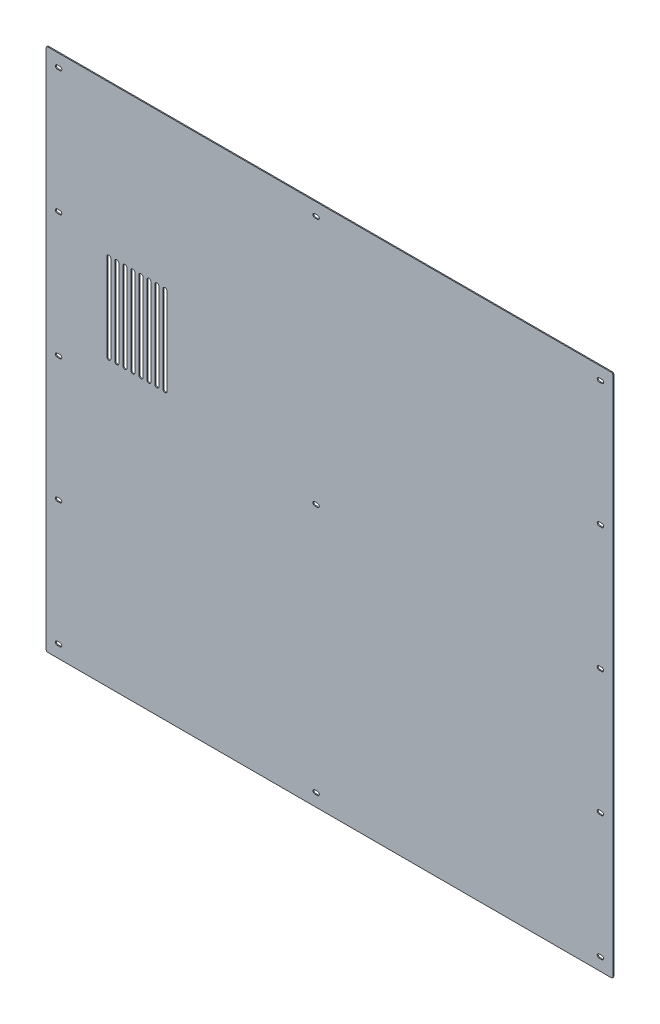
ISO-10303-21;
HEADER;
FILE_DESCRIPTION(('STEP AP214'),'2;1');
FILE_NAME('part.step','',(''),(''),'','','');
FILE_SCHEMA(('AUTOMOTIVE_DESIGN { 1 0 10303 214 1 1 1 1 }'));
ENDSEC;
DATA;
#1=APPLICATION_CONTEXT('core data for automotive mechanical design processes');
#2=APPLICATION_PROTOCOL_DEFINITION('international standard','automotive_design',2000,#1);
#3=PRODUCT_CONTEXT('',#1,'mechanical');
#4=PRODUCT('Part','Part','',(#3));
#5=PRODUCT_RELATED_PRODUCT_CATEGORY('part','',(#4));
#6=PRODUCT_DEFINITION_FORMATION('','',#4);
#7=PRODUCT_DEFINITION_CONTEXT('part definition',#1,'design');
#8=PRODUCT_DEFINITION('design','',#6,#7);
#9=PRODUCT_DEFINITION_SHAPE('','',#8);
#10=(LENGTH_UNIT() NAMED_UNIT(*) SI_UNIT(.MILLI.,.METRE.));
#11=(NAMED_UNIT(*) PLANE_ANGLE_UNIT() SI_UNIT($,.RADIAN.));
#12=(NAMED_UNIT(*) SI_UNIT($,.STERADIAN.) SOLID_ANGLE_UNIT());
#13=UNCERTAINTY_MEASURE_WITH_UNIT(LENGTH_MEASURE(1.E-05),#10,'distance_accuracy_value','');
#14=(GEOMETRIC_REPRESENTATION_CONTEXT(3) GLOBAL_UNCERTAINTY_ASSIGNED_CONTEXT((#13)) GLOBAL_UNIT_ASSIGNED_CONTEXT((#10,
#11,#12)) REPRESENTATION_CONTEXT('',''));
#15=CARTESIAN_POINT('',(0.,0.,0.));
#16=DIRECTION('',(0.,0.,1.));
#17=DIRECTION('',(1.,0.,0.));
#18=AXIS2_PLACEMENT_3D('',#15,#16,#17);
#19=CARTESIAN_POINT('',(-243.,35.,-1.5));
#20=DIRECTION('',(1.,0.,0.));
#21=DIRECTION('',(0.,0.,-1.));
#22=AXIS2_PLACEMENT_3D('',#19,#20,#21);
#23=PLANE('',#22);
#24=DIRECTION('',(0.,1.,0.));
#25=VECTOR('',#24,1.);
#26=CARTESIAN_POINT('',(-243.,35.,0.));
#27=LINE('',#26,#25);
#28=CARTESIAN_POINT('',(-243.,35.,0.));
#29=VERTEX_POINT('',#28);
#30=CARTESIAN_POINT('',(-243.,165.,0.));
#31=VERTEX_POINT('',#30);
#32=EDGE_CURVE('E1336',#29,#31,#27,.T.);
#33=ORIENTED_EDGE('',*,*,#32,.T.);
#34=DIRECTION('',(0.,0.,1.));
#35=VECTOR('',#34,1.);
#36=CARTESIAN_POINT('',(-243.,165.,-1.5));
#37=LINE('',#36,#35);
#38=CARTESIAN_POINT('',(-243.,165.,-1.5));
#39=VERTEX_POINT('',#38);
#40=EDGE_CURVE('E11',#39,#31,#37,.T.);
#41=ORIENTED_EDGE('',*,*,#40,.F.);
#42=DIRECTION('',(0.,1.,0.));
#43=VECTOR('',#42,1.);
#44=CARTESIAN_POINT('',(-243.,35.,-1.5));
#45=LINE('',#44,#43);
#46=CARTESIAN_POINT('',(-243.,35.,-1.5));
#47=VERTEX_POINT('',#46);
#48=EDGE_CURVE('E1340',#47,#39,#45,.T.);
#49=ORIENTED_EDGE('',*,*,#48,.F.);
#50=DIRECTION('',(0.,0.,1.));
#51=VECTOR('',#50,1.);
#52=CARTESIAN_POINT('',(-243.,35.,-1.5));
#53=LINE('',#52,#51);
#54=EDGE_CURVE('E1345',#47,#29,#53,.T.);
#55=ORIENTED_EDGE('',*,*,#54,.T.);
#56=EDGE_LOOP('',(#33,#41,#49,#55));
#57=FACE_BOUND('',#56,.T.);
#58=ADVANCED_FACE('F36',(#57),#23,.F.);
#59=CARTESIAN_POINT('',(-246.,165.,-1.5));
#60=DIRECTION('',(0.,0.,1.));
#61=DIRECTION('',(1.,0.,0.));
#62=AXIS2_PLACEMENT_3D('',#59,#60,#61);
#63=CYLINDRICAL_SURFACE('',#62,3.);
#64=CARTESIAN_POINT('',(-246.,165.,0.));
#65=DIRECTION('',(0.,0.,1.));
#66=DIRECTION('',(1.,0.,0.));
#67=AXIS2_PLACEMENT_3D('',#64,#65,#66);
#68=CIRCLE('',#67,3.);
#69=CARTESIAN_POINT('',(-249.,165.,0.));
#70=VERTEX_POINT('',#69);
#71=EDGE_CURVE('E1333',#31,#70,#68,.T.);
#72=ORIENTED_EDGE('',*,*,#71,.T.);
#73=DIRECTION('',(0.,0.,1.));
#74=VECTOR('',#73,1.);
#75=CARTESIAN_POINT('',(-249.,165.,-1.5));
#76=LINE('',#75,#74);
#77=CARTESIAN_POINT('',(-249.,165.,-1.5));
#78=VERTEX_POINT('',#77);
#79=EDGE_CURVE('E43',#78,#70,#76,.T.);
#80=ORIENTED_EDGE('',*,*,#79,.F.);
#81=CARTESIAN_POINT('',(-246.,165.,-1.5));
#82=DIRECTION('',(0.,0.,1.));
#83=DIRECTION('',(1.,0.,0.));
#84=AXIS2_PLACEMENT_3D('',#81,#82,#83);
#85=CIRCLE('',#84,3.);
#86=EDGE_CURVE('E57',#39,#78,#85,.T.);
#87=ORIENTED_EDGE('',*,*,#86,.F.);
#88=ORIENTED_EDGE('',*,*,#40,.T.);
#89=EDGE_LOOP('',(#72,#80,#87,#88));
#90=FACE_BOUND('',#89,.T.);
#91=ADVANCED_FACE('F1355',(#90),#63,.F.);
#92=CARTESIAN_POINT('',(-249.,35.,-1.5));
#93=DIRECTION('',(-1.,0.,0.));
#94=DIRECTION('',(0.,0.,1.));
#95=AXIS2_PLACEMENT_3D('',#92,#93,#94);
#96=PLANE('',#95);
#97=DIRECTION('',(0.,-1.,0.));
#98=VECTOR('',#97,1.);
#99=CARTESIAN_POINT('',(-249.,35.,0.));
#100=LINE('',#99,#98);
#101=CARTESIAN_POINT('',(-249.,35.,0.));
#102=VERTEX_POINT('',#101);
#103=EDGE_CURVE('E1330',#70,#102,#100,.T.);
#104=ORIENTED_EDGE('',*,*,#103,.T.);
#105=DIRECTION('',(0.,0.,1.));
#106=VECTOR('',#105,1.);
#107=CARTESIAN_POINT('',(-249.,35.,-1.5));
#108=LINE('',#107,#106);
#109=CARTESIAN_POINT('',(-249.,35.,-1.5));
#110=VERTEX_POINT('',#109);
#111=EDGE_CURVE('E1348',#110,#102,#108,.T.);
#112=ORIENTED_EDGE('',*,*,#111,.F.);
#113=DIRECTION('',(0.,-1.,0.));
#114=VECTOR('',#113,1.);
#115=CARTESIAN_POINT('',(-249.,35.,-1.5));
#116=LINE('',#115,#114);
#117=EDGE_CURVE('E1343',#78,#110,#116,.T.);
#118=ORIENTED_EDGE('',*,*,#117,.F.);
#119=ORIENTED_EDGE('',*,*,#79,.T.);
#120=EDGE_LOOP('',(#104,#112,#118,#119));
#121=FACE_BOUND('',#120,.T.);
#122=ADVANCED_FACE('F1352',(#121),#96,.F.);
#123=CARTESIAN_POINT('',(-246.,35.,-1.5));
#124=DIRECTION('',(0.,0.,1.));
#125=DIRECTION('',(1.,0.,0.));
#126=AXIS2_PLACEMENT_3D('',#123,#124,#125);
#127=CYLINDRICAL_SURFACE('',#126,3.);
#128=CARTESIAN_POINT('',(-246.,35.,0.));
#129=DIRECTION('',(0.,0.,1.));
#130=DIRECTION('',(1.,0.,0.));
#131=AXIS2_PLACEMENT_3D('',#128,#129,#130);
#132=CIRCLE('',#131,3.);
#133=EDGE_CURVE('E1328',#102,#29,#132,.T.);
#134=ORIENTED_EDGE('',*,*,#133,.T.);
#135=ORIENTED_EDGE('',*,*,#54,.F.);
#136=CARTESIAN_POINT('',(-246.,35.,-1.5));
#137=DIRECTION('',(0.,0.,1.));
#138=DIRECTION('',(1.,0.,0.));
#139=AXIS2_PLACEMENT_3D('',#136,#137,#138);
#140=CIRCLE('',#139,3.);
#141=EDGE_CURVE('E50',#110,#47,#140,.T.);
#142=ORIENTED_EDGE('',*,*,#141,.F.);
#143=ORIENTED_EDGE('',*,*,#111,.T.);
#144=EDGE_LOOP('',(#134,#135,#142,#143));
#145=FACE_BOUND('',#144,.T.);
#146=ADVANCED_FACE('F1361',(#145),#127,.F.);
#147=CARTESIAN_POINT('',(-255.,35.,-1.5));
#148=DIRECTION('',(1.,0.,0.));
#149=DIRECTION('',(0.,0.,-1.));
#150=AXIS2_PLACEMENT_3D('',#147,#148,#149);
#151=PLANE('',#150);
#152=DIRECTION('',(0.,1.,0.));
#153=VECTOR('',#152,1.);
#154=CARTESIAN_POINT('',(-255.,35.,0.));
#155=LINE('',#154,#153);
#156=CARTESIAN_POINT('',(-255.,35.,0.));
#157=VERTEX_POINT('',#156);
#158=CARTESIAN_POINT('',(-255.,165.,0.));
#159=VERTEX_POINT('',#158);
#160=EDGE_CURVE('E1304',#157,#159,#155,.T.);
#161=ORIENTED_EDGE('',*,*,#160,.T.);
#162=DIRECTION('',(0.,0.,1.));
#163=VECTOR('',#162,1.);
#164=CARTESIAN_POINT('',(-255.,165.,-1.5));
#165=LINE('',#164,#163);
#166=CARTESIAN_POINT('',(-255.,165.,-1.5));
#167=VERTEX_POINT('',#166);
#168=EDGE_CURVE('E1325',#167,#159,#165,.T.);
#169=ORIENTED_EDGE('',*,*,#168,.F.);
#170=DIRECTION('',(0.,1.,0.));
#171=VECTOR('',#170,1.);
#172=CARTESIAN_POINT('',(-255.,35.,-1.5));
#173=LINE('',#172,#171);
#174=CARTESIAN_POINT('',(-255.,35.,-1.5));
#175=VERTEX_POINT('',#174);
#176=EDGE_CURVE('E1309',#175,#167,#173,.T.);
#177=ORIENTED_EDGE('',*,*,#176,.F.);
#178=DIRECTION('',(0.,0.,1.));
#179=VECTOR('',#178,1.);
#180=CARTESIAN_POINT('',(-255.,35.,-1.5));
#181=LINE('',#180,#179);
#182=EDGE_CURVE('E1316',#175,#157,#181,.T.);
#183=ORIENTED_EDGE('',*,*,#182,.T.);
#184=EDGE_LOOP('',(#161,#169,#177,#183));
#185=FACE_BOUND('',#184,.T.);
#186=ADVANCED_FACE('F1363',(#185),#151,.F.);
#187=CARTESIAN_POINT('',(-258.,165.,-1.5));
#188=DIRECTION('',(0.,0.,1.));
#189=DIRECTION('',(1.,0.,0.));
#190=AXIS2_PLACEMENT_3D('',#187,#188,#189);
#191=CYLINDRICAL_SURFACE('',#190,3.);
#192=CARTESIAN_POINT('',(-258.,165.,0.));
#193=DIRECTION('',(0.,0.,1.));
#194=DIRECTION('',(1.,0.,0.));
#195=AXIS2_PLACEMENT_3D('',#192,#193,#194);
#196=CIRCLE('',#195,3.);
#197=CARTESIAN_POINT('',(-261.,165.,0.));
#198=VERTEX_POINT('',#197);
#199=EDGE_CURVE('E1301',#159,#198,#196,.T.);
#200=ORIENTED_EDGE('',*,*,#199,.T.);
#201=DIRECTION('',(0.,0.,1.));
#202=VECTOR('',#201,1.);
#203=CARTESIAN_POINT('',(-261.,165.,-1.5));
#204=LINE('',#203,#202);
#205=CARTESIAN_POINT('',(-261.,165.,-1.5));
#206=VERTEX_POINT('',#205);
#207=EDGE_CURVE('E1322',#206,#198,#204,.T.);
#208=ORIENTED_EDGE('',*,*,#207,.F.);
#209=CARTESIAN_POINT('',(-258.,165.,-1.5));
#210=DIRECTION('',(0.,0.,1.));
#211=DIRECTION('',(1.,0.,0.));
#212=AXIS2_PLACEMENT_3D('',#209,#210,#211);
#213=CIRCLE('',#212,3.);
#214=EDGE_CURVE('E1311',#167,#206,#213,.T.);
#215=ORIENTED_EDGE('',*,*,#214,.F.);
#216=ORIENTED_EDGE('',*,*,#168,.T.);
#217=EDGE_LOOP('',(#200,#208,#215,#216));
#218=FACE_BOUND('',#217,.T.);
#219=ADVANCED_FACE('F1369',(#218),#191,.F.);
#220=CARTESIAN_POINT('',(-261.,35.,-1.5));
#221=DIRECTION('',(-1.,0.,0.));
#222=DIRECTION('',(0.,0.,1.));
#223=AXIS2_PLACEMENT_3D('',#220,#221,#222);
#224=PLANE('',#223);
#225=DIRECTION('',(0.,-1.,0.));
#226=VECTOR('',#225,1.);
#227=CARTESIAN_POINT('',(-261.,35.,0.));
#228=LINE('',#227,#226);
#229=CARTESIAN_POINT('',(-261.,35.,0.));
#230=VERTEX_POINT('',#229);
#231=EDGE_CURVE('E1298',#198,#230,#228,.T.);
#232=ORIENTED_EDGE('',*,*,#231,.T.);
#233=DIRECTION('',(0.,0.,1.));
#234=VECTOR('',#233,1.);
#235=CARTESIAN_POINT('',(-261.,35.,-1.5));
#236=LINE('',#235,#234);
#237=CARTESIAN_POINT('',(-261.,35.,-1.5));
#238=VERTEX_POINT('',#237);
#239=EDGE_CURVE('E1319',#238,#230,#236,.T.);
#240=ORIENTED_EDGE('',*,*,#239,.F.);
#241=DIRECTION('',(0.,-1.,0.));
#242=VECTOR('',#241,1.);
#243=CARTESIAN_POINT('',(-261.,35.,-1.5));
#244=LINE('',#243,#242);
#245=EDGE_CURVE('E1313',#206,#238,#244,.T.);
#246=ORIENTED_EDGE('',*,*,#245,.F.);
#247=ORIENTED_EDGE('',*,*,#207,.T.);
#248=EDGE_LOOP('',(#232,#240,#246,#247));
#249=FACE_BOUND('',#248,.T.);
#250=ADVANCED_FACE('F1405',(#249),#224,.F.);
#251=CARTESIAN_POINT('',(-258.,35.,-1.5));
#252=DIRECTION('',(0.,0.,1.));
#253=DIRECTION('',(1.,0.,0.));
#254=AXIS2_PLACEMENT_3D('',#251,#252,#253);
#255=CYLINDRICAL_SURFACE('',#254,3.);
#256=CARTESIAN_POINT('',(-258.,35.,0.));
#257=DIRECTION('',(0.,0.,1.));
#258=DIRECTION('',(1.,0.,0.));
#259=AXIS2_PLACEMENT_3D('',#256,#257,#258);
#260=CIRCLE('',#259,3.);
#261=EDGE_CURVE('E1296',#230,#157,#260,.T.);
#262=ORIENTED_EDGE('',*,*,#261,.T.);
#263=ORIENTED_EDGE('',*,*,#182,.F.);
#264=CARTESIAN_POINT('',(-258.,35.,-1.5));
#265=DIRECTION('',(0.,0.,1.));
#266=DIRECTION('',(1.,0.,0.));
#267=AXIS2_PLACEMENT_3D('',#264,#265,#266);
#268=CIRCLE('',#267,3.);
#269=EDGE_CURVE('E1307',#238,#175,#268,.T.);
#270=ORIENTED_EDGE('',*,*,#269,.F.);
#271=ORIENTED_EDGE('',*,*,#239,.T.);
#272=EDGE_LOOP('',(#262,#263,#270,#271));
#273=FACE_BOUND('',#272,.T.);
#274=ADVANCED_FACE('F1416',(#273),#255,.F.);
#275=CARTESIAN_POINT('',(-267.,35.,-1.5));
#276=DIRECTION('',(1.,0.,0.));
#277=DIRECTION('',(0.,0.,-1.));
#278=AXIS2_PLACEMENT_3D('',#275,#276,#277);
#279=PLANE('',#278);
#280=DIRECTION('',(0.,1.,0.));
#281=VECTOR('',#280,1.);
#282=CARTESIAN_POINT('',(-267.,35.,0.));
#283=LINE('',#282,#281);
#284=CARTESIAN_POINT('',(-267.,35.,0.));
#285=VERTEX_POINT('',#284);
#286=CARTESIAN_POINT('',(-267.,165.,0.));
#287=VERTEX_POINT('',#286);
#288=EDGE_CURVE('E1272',#285,#287,#283,.T.);
#289=ORIENTED_EDGE('',*,*,#288,.T.);
#290=DIRECTION('',(0.,0.,1.));
#291=VECTOR('',#290,1.);
#292=CARTESIAN_POINT('',(-267.,165.,-1.5));
#293=LINE('',#292,#291);
#294=CARTESIAN_POINT('',(-267.,165.,-1.5));
#295=VERTEX_POINT('',#294);
#296=EDGE_CURVE('E1293',#295,#287,#293,.T.);
#297=ORIENTED_EDGE('',*,*,#296,.F.);
#298=DIRECTION('',(0.,1.,0.));
#299=VECTOR('',#298,1.);
#300=CARTESIAN_POINT('',(-267.,35.,-1.5));
#301=LINE('',#300,#299);
#302=CARTESIAN_POINT('',(-267.,35.,-1.5));
#303=VERTEX_POINT('',#302);
#304=EDGE_CURVE('E1277',#303,#295,#301,.T.);
#305=ORIENTED_EDGE('',*,*,#304,.F.);
#306=DIRECTION('',(0.,0.,1.));
#307=VECTOR('',#306,1.);
#308=CARTESIAN_POINT('',(-267.,35.,-1.5));
#309=LINE('',#308,#307);
#310=EDGE_CURVE('E1284',#303,#285,#309,.T.);
#311=ORIENTED_EDGE('',*,*,#310,.T.);
#312=EDGE_LOOP('',(#289,#297,#305,#311));
#313=FACE_BOUND('',#312,.T.);
#314=ADVANCED_FACE('F1427',(#313),#279,.F.);
#315=CARTESIAN_POINT('',(-270.,165.,-1.5));
#316=DIRECTION('',(0.,0.,1.));
#317=DIRECTION('',(1.,0.,0.));
#318=AXIS2_PLACEMENT_3D('',#315,#316,#317);
#319=CYLINDRICAL_SURFACE('',#318,3.);
#320=CARTESIAN_POINT('',(-270.,165.,0.));
#321=DIRECTION('',(0.,0.,1.));
#322=DIRECTION('',(1.,0.,0.));
#323=AXIS2_PLACEMENT_3D('',#320,#321,#322);
#324=CIRCLE('',#323,3.);
#325=CARTESIAN_POINT('',(-273.,165.,0.));
#326=VERTEX_POINT('',#325);
#327=EDGE_CURVE('E1269',#287,#326,#324,.T.);
#328=ORIENTED_EDGE('',*,*,#327,.T.);
#329=DIRECTION('',(0.,0.,1.));
#330=VECTOR('',#329,1.);
#331=CARTESIAN_POINT('',(-273.,165.,-1.5));
#332=LINE('',#331,#330);
#333=CARTESIAN_POINT('',(-273.,165.,-1.5));
#334=VERTEX_POINT('',#333);
#335=EDGE_CURVE('E1290',#334,#326,#332,.T.);
#336=ORIENTED_EDGE('',*,*,#335,.F.);
#337=CARTESIAN_POINT('',(-270.,165.,-1.5));
#338=DIRECTION('',(0.,0.,1.));
#339=DIRECTION('',(1.,0.,0.));
#340=AXIS2_PLACEMENT_3D('',#337,#338,#339);
#341=CIRCLE('',#340,3.);
#342=EDGE_CURVE('E1279',#295,#334,#341,.T.);
#343=ORIENTED_EDGE('',*,*,#342,.F.);
#344=ORIENTED_EDGE('',*,*,#296,.T.);
#345=EDGE_LOOP('',(#328,#336,#343,#344));
#346=FACE_BOUND('',#345,.T.);
#347=ADVANCED_FACE('F1438',(#346),#319,.F.);
#348=CARTESIAN_POINT('',(-273.,35.,-1.5));
#349=DIRECTION('',(-1.,0.,0.));
#350=DIRECTION('',(0.,0.,1.));
#351=AXIS2_PLACEMENT_3D('',#348,#349,#350);
#352=PLANE('',#351);
#353=DIRECTION('',(0.,-1.,0.));
#354=VECTOR('',#353,1.);
#355=CARTESIAN_POINT('',(-273.,35.,0.));
#356=LINE('',#355,#354);
#357=CARTESIAN_POINT('',(-273.,35.,0.));
#358=VERTEX_POINT('',#357);
#359=EDGE_CURVE('E1266',#326,#358,#356,.T.);
#360=ORIENTED_EDGE('',*,*,#359,.T.);
#361=DIRECTION('',(0.,0.,1.));
#362=VECTOR('',#361,1.);
#363=CARTESIAN_POINT('',(-273.,35.,-1.5));
#364=LINE('',#363,#362);
#365=CARTESIAN_POINT('',(-273.,35.,-1.5));
#366=VERTEX_POINT('',#365);
#367=EDGE_CURVE('E1287',#366,#358,#364,.T.);
#368=ORIENTED_EDGE('',*,*,#367,.F.);
#369=DIRECTION('',(0.,-1.,0.));
#370=VECTOR('',#369,1.);
#371=CARTESIAN_POINT('',(-273.,35.,-1.5));
#372=LINE('',#371,#370);
#373=EDGE_CURVE('E1281',#334,#366,#372,.T.);
#374=ORIENTED_EDGE('',*,*,#373,.F.);
#375=ORIENTED_EDGE('',*,*,#335,.T.);
#376=EDGE_LOOP('',(#360,#368,#374,#375));
#377=FACE_BOUND('',#376,.T.);
#378=ADVANCED_FACE('F1449',(#377),#352,.F.);
#379=CARTESIAN_POINT('',(-270.,35.,-1.5));
#380=DIRECTION('',(0.,0.,1.));
#381=DIRECTION('',(1.,0.,0.));
#382=AXIS2_PLACEMENT_3D('',#379,#380,#381);
#383=CYLINDRICAL_SURFACE('',#382,3.);
#384=CARTESIAN_POINT('',(-270.,35.,0.));
#385=DIRECTION('',(0.,0.,1.));
#386=DIRECTION('',(1.,0.,0.));
#387=AXIS2_PLACEMENT_3D('',#384,#385,#386);
#388=CIRCLE('',#387,3.);
#389=EDGE_CURVE('E1264',#358,#285,#388,.T.);
#390=ORIENTED_EDGE('',*,*,#389,.T.);
#391=ORIENTED_EDGE('',*,*,#310,.F.);
#392=CARTESIAN_POINT('',(-270.,35.,-1.5));
#393=DIRECTION('',(0.,0.,1.));
#394=DIRECTION('',(1.,0.,0.));
#395=AXIS2_PLACEMENT_3D('',#392,#393,#394);
#396=CIRCLE('',#395,3.);
#397=EDGE_CURVE('E1275',#366,#303,#396,.T.);
#398=ORIENTED_EDGE('',*,*,#397,.F.);
#399=ORIENTED_EDGE('',*,*,#367,.T.);
#400=EDGE_LOOP('',(#390,#391,#398,#399));
#401=FACE_BOUND('',#400,.T.);
#402=ADVANCED_FACE('F1460',(#401),#383,.F.);
#403=CARTESIAN_POINT('',(-279.,35.,-1.5));
#404=DIRECTION('',(1.,0.,0.));
#405=DIRECTION('',(0.,0.,-1.));
#406=AXIS2_PLACEMENT_3D('',#403,#404,#405);
#407=PLANE('',#406);
#408=DIRECTION('',(0.,1.,0.));
#409=VECTOR('',#408,1.);
#410=CARTESIAN_POINT('',(-279.,35.,0.));
#411=LINE('',#410,#409);
#412=CARTESIAN_POINT('',(-279.,35.,0.));
#413=VERTEX_POINT('',#412);
#414=CARTESIAN_POINT('',(-279.,165.,0.));
#415=VERTEX_POINT('',#414);
#416=EDGE_CURVE('E1240',#413,#415,#411,.T.);
#417=ORIENTED_EDGE('',*,*,#416,.T.);
#418=DIRECTION('',(0.,0.,1.));
#419=VECTOR('',#418,1.);
#420=CARTESIAN_POINT('',(-279.,165.,-1.5));
#421=LINE('',#420,#419);
#422=CARTESIAN_POINT('',(-279.,165.,-1.5));
#423=VERTEX_POINT('',#422);
#424=EDGE_CURVE('E1261',#423,#415,#421,.T.);
#425=ORIENTED_EDGE('',*,*,#424,.F.);
#426=DIRECTION('',(0.,1.,0.));
#427=VECTOR('',#426,1.);
#428=CARTESIAN_POINT('',(-279.,35.,-1.5));
#429=LINE('',#428,#427);
#430=CARTESIAN_POINT('',(-279.,35.,-1.5));
#431=VERTEX_POINT('',#430);
#432=EDGE_CURVE('E1245',#431,#423,#429,.T.);
#433=ORIENTED_EDGE('',*,*,#432,.F.);
#434=DIRECTION('',(0.,0.,1.));
#435=VECTOR('',#434,1.);
#436=CARTESIAN_POINT('',(-279.,35.,-1.5));
#437=LINE('',#436,#435);
#438=EDGE_CURVE('E1252',#431,#413,#437,.T.);
#439=ORIENTED_EDGE('',*,*,#438,.T.);
#440=EDGE_LOOP('',(#417,#425,#433,#439));
#441=FACE_BOUND('',#440,.T.);
#442=ADVANCED_FACE('F1471',(#441),#407,.F.);
#443=CARTESIAN_POINT('',(-282.,165.,-1.5));
#444=DIRECTION('',(0.,0.,1.));
#445=DIRECTION('',(1.,0.,0.));
#446=AXIS2_PLACEMENT_3D('',#443,#444,#445);
#447=CYLINDRICAL_SURFACE('',#446,3.);
#448=CARTESIAN_POINT('',(-282.,165.,0.));
#449=DIRECTION('',(0.,0.,1.));
#450=DIRECTION('',(1.,0.,0.));
#451=AXIS2_PLACEMENT_3D('',#448,#449,#450);
#452=CIRCLE('',#451,3.);
#453=CARTESIAN_POINT('',(-285.,165.,0.));
#454=VERTEX_POINT('',#453);
#455=EDGE_CURVE('E1237',#415,#454,#452,.T.);
#456=ORIENTED_EDGE('',*,*,#455,.T.);
#457=DIRECTION('',(0.,0.,1.));
#458=VECTOR('',#457,1.);
#459=CARTESIAN_POINT('',(-285.,165.,-1.5));
#460=LINE('',#459,#458);
#461=CARTESIAN_POINT('',(-285.,165.,-1.5));
#462=VERTEX_POINT('',#461);
#463=EDGE_CURVE('E1258',#462,#454,#460,.T.);
#464=ORIENTED_EDGE('',*,*,#463,.F.);
#465=CARTESIAN_POINT('',(-282.,165.,-1.5));
#466=DIRECTION('',(0.,0.,1.));
#467=DIRECTION('',(1.,0.,0.));
#468=AXIS2_PLACEMENT_3D('',#465,#466,#467);
#469=CIRCLE('',#468,3.);
#470=EDGE_CURVE('E1247',#423,#462,#469,.T.);
#471=ORIENTED_EDGE('',*,*,#470,.F.);
#472=ORIENTED_EDGE('',*,*,#424,.T.);
#473=EDGE_LOOP('',(#456,#464,#471,#472));
#474=FACE_BOUND('',#473,.T.);
#475=ADVANCED_FACE('F1482',(#474),#447,.F.);
#476=CARTESIAN_POINT('',(-285.,35.,-1.5));
#477=DIRECTION('',(-1.,0.,0.));
#478=DIRECTION('',(0.,0.,1.));
#479=AXIS2_PLACEMENT_3D('',#476,#477,#478);
#480=PLANE('',#479);
#481=DIRECTION('',(0.,-1.,0.));
#482=VECTOR('',#481,1.);
#483=CARTESIAN_POINT('',(-285.,35.,0.));
#484=LINE('',#483,#482);
#485=CARTESIAN_POINT('',(-285.,35.,0.));
#486=VERTEX_POINT('',#485);
#487=EDGE_CURVE('E1234',#454,#486,#484,.T.);
#488=ORIENTED_EDGE('',*,*,#487,.T.);
#489=DIRECTION('',(0.,0.,1.));
#490=VECTOR('',#489,1.);
#491=CARTESIAN_POINT('',(-285.,35.,-1.5));
#492=LINE('',#491,#490);
#493=CARTESIAN_POINT('',(-285.,35.,-1.5));
#494=VERTEX_POINT('',#493);
#495=EDGE_CURVE('E1255',#494,#486,#492,.T.);
#496=ORIENTED_EDGE('',*,*,#495,.F.);
#497=DIRECTION('',(0.,-1.,0.));
#498=VECTOR('',#497,1.);
#499=CARTESIAN_POINT('',(-285.,35.,-1.5));
#500=LINE('',#499,#498);
#501=EDGE_CURVE('E1249',#462,#494,#500,.T.);
#502=ORIENTED_EDGE('',*,*,#501,.F.);
#503=ORIENTED_EDGE('',*,*,#463,.T.);
#504=EDGE_LOOP('',(#488,#496,#502,#503));
#505=FACE_BOUND('',#504,.T.);
#506=ADVANCED_FACE('F1493',(#505),#480,.F.);
#507=CARTESIAN_POINT('',(-282.,35.,-1.5));
#508=DIRECTION('',(0.,0.,1.));
#509=DIRECTION('',(1.,0.,0.));
#510=AXIS2_PLACEMENT_3D('',#507,#508,#509);
#511=CYLINDRICAL_SURFACE('',#510,3.);
#512=CARTESIAN_POINT('',(-282.,35.,0.));
#513=DIRECTION('',(0.,0.,1.));
#514=DIRECTION('',(1.,0.,0.));
#515=AXIS2_PLACEMENT_3D('',#512,#513,#514);
#516=CIRCLE('',#515,3.);
#517=EDGE_CURVE('E1232',#486,#413,#516,.T.);
#518=ORIENTED_EDGE('',*,*,#517,.T.);
#519=ORIENTED_EDGE('',*,*,#438,.F.);
#520=CARTESIAN_POINT('',(-282.,35.,-1.5));
#521=DIRECTION('',(0.,0.,1.));
#522=DIRECTION('',(1.,0.,0.));
#523=AXIS2_PLACEMENT_3D('',#520,#521,#522);
#524=CIRCLE('',#523,3.);
#525=EDGE_CURVE('E1243',#494,#431,#524,.T.);
#526=ORIENTED_EDGE('',*,*,#525,.F.);
#527=ORIENTED_EDGE('',*,*,#495,.T.);
#528=EDGE_LOOP('',(#518,#519,#526,#527));
#529=FACE_BOUND('',#528,.T.);
#530=ADVANCED_FACE('F1504',(#529),#511,.F.);
#531=CARTESIAN_POINT('',(-291.,35.,-1.5));
#532=DIRECTION('',(1.,0.,0.));
#533=DIRECTION('',(0.,0.,-1.));
#534=AXIS2_PLACEMENT_3D('',#531,#532,#533);
#535=PLANE('',#534);
#536=DIRECTION('',(0.,1.,0.));
#537=VECTOR('',#536,1.);
#538=CARTESIAN_POINT('',(-291.,35.,0.));
#539=LINE('',#538,#537);
#540=CARTESIAN_POINT('',(-291.,35.,0.));
#541=VERTEX_POINT('',#540);
#542=CARTESIAN_POINT('',(-291.,165.,0.));
#543=VERTEX_POINT('',#542);
#544=EDGE_CURVE('E1208',#541,#543,#539,.T.);
#545=ORIENTED_EDGE('',*,*,#544,.T.);
#546=DIRECTION('',(0.,0.,1.));
#547=VECTOR('',#546,1.);
#548=CARTESIAN_POINT('',(-291.,165.,-1.5));
#549=LINE('',#548,#547);
#550=CARTESIAN_POINT('',(-291.,165.,-1.5));
#551=VERTEX_POINT('',#550);
#552=EDGE_CURVE('E1229',#551,#543,#549,.T.);
#553=ORIENTED_EDGE('',*,*,#552,.F.);
#554=DIRECTION('',(0.,1.,0.));
#555=VECTOR('',#554,1.);
#556=CARTESIAN_POINT('',(-291.,35.,-1.5));
#557=LINE('',#556,#555);
#558=CARTESIAN_POINT('',(-291.,35.,-1.5));
#559=VERTEX_POINT('',#558);
#560=EDGE_CURVE('E1213',#559,#551,#557,.T.);
#561=ORIENTED_EDGE('',*,*,#560,.F.);
#562=DIRECTION('',(0.,0.,1.));
#563=VECTOR('',#562,1.);
#564=CARTESIAN_POINT('',(-291.,35.,-1.5));
#565=LINE('',#564,#563);
#566=EDGE_CURVE('E1220',#559,#541,#565,.T.);
#567=ORIENTED_EDGE('',*,*,#566,.T.);
#568=EDGE_LOOP('',(#545,#553,#561,#567));
#569=FACE_BOUND('',#568,.T.);
#570=ADVANCED_FACE('F1515',(#569),#535,.F.);
#571=CARTESIAN_POINT('',(-294.,165.,-1.5));
#572=DIRECTION('',(0.,0.,1.));
#573=DIRECTION('',(1.,0.,0.));
#574=AXIS2_PLACEMENT_3D('',#571,#572,#573);
#575=CYLINDRICAL_SURFACE('',#574,3.);
#576=CARTESIAN_POINT('',(-294.,165.,0.));
#577=DIRECTION('',(0.,0.,1.));
#578=DIRECTION('',(1.,0.,0.));
#579=AXIS2_PLACEMENT_3D('',#576,#577,#578);
#580=CIRCLE('',#579,3.);
#581=CARTESIAN_POINT('',(-297.,165.,0.));
#582=VERTEX_POINT('',#581);
#583=EDGE_CURVE('E1205',#543,#582,#580,.T.);
#584=ORIENTED_EDGE('',*,*,#583,.T.);
#585=DIRECTION('',(0.,0.,1.));
#586=VECTOR('',#585,1.);
#587=CARTESIAN_POINT('',(-297.,165.,-1.5));
#588=LINE('',#587,#586);
#589=CARTESIAN_POINT('',(-297.,165.,-1.5));
#590=VERTEX_POINT('',#589);
#591=EDGE_CURVE('E1226',#590,#582,#588,.T.);
#592=ORIENTED_EDGE('',*,*,#591,.F.);
#593=CARTESIAN_POINT('',(-294.,165.,-1.5));
#594=DIRECTION('',(0.,0.,1.));
#595=DIRECTION('',(1.,0.,0.));
#596=AXIS2_PLACEMENT_3D('',#593,#594,#595);
#597=CIRCLE('',#596,3.);
#598=EDGE_CURVE('E1215',#551,#590,#597,.T.);
#599=ORIENTED_EDGE('',*,*,#598,.F.);
#600=ORIENTED_EDGE('',*,*,#552,.T.);
#601=EDGE_LOOP('',(#584,#592,#599,#600));
#602=FACE_BOUND('',#601,.T.);
#603=ADVANCED_FACE('F1526',(#602),#575,.F.);
#604=CARTESIAN_POINT('',(-297.,35.,-1.5));
#605=DIRECTION('',(-1.,0.,0.));
#606=DIRECTION('',(0.,0.,1.));
#607=AXIS2_PLACEMENT_3D('',#604,#605,#606);
#608=PLANE('',#607);
#609=DIRECTION('',(0.,-1.,0.));
#610=VECTOR('',#609,1.);
#611=CARTESIAN_POINT('',(-297.,35.,0.));
#612=LINE('',#611,#610);
#613=CARTESIAN_POINT('',(-297.,35.,0.));
#614=VERTEX_POINT('',#613);
#615=EDGE_CURVE('E1202',#582,#614,#612,.T.);
#616=ORIENTED_EDGE('',*,*,#615,.T.);
#617=DIRECTION('',(0.,0.,1.));
#618=VECTOR('',#617,1.);
#619=CARTESIAN_POINT('',(-297.,35.,-1.5));
#620=LINE('',#619,#618);
#621=CARTESIAN_POINT('',(-297.,35.,-1.5));
#622=VERTEX_POINT('',#621);
#623=EDGE_CURVE('E1223',#622,#614,#620,.T.);
#624=ORIENTED_EDGE('',*,*,#623,.F.);
#625=DIRECTION('',(0.,-1.,0.));
#626=VECTOR('',#625,1.);
#627=CARTESIAN_POINT('',(-297.,35.,-1.5));
#628=LINE('',#627,#626);
#629=EDGE_CURVE('E1217',#590,#622,#628,.T.);
#630=ORIENTED_EDGE('',*,*,#629,.F.);
#631=ORIENTED_EDGE('',*,*,#591,.T.);
#632=EDGE_LOOP('',(#616,#624,#630,#631));
#633=FACE_BOUND('',#632,.T.);
#634=ADVANCED_FACE('F1537',(#633),#608,.F.);
#635=CARTESIAN_POINT('',(-294.,35.,-1.5));
#636=DIRECTION('',(0.,0.,1.));
#637=DIRECTION('',(1.,0.,0.));
#638=AXIS2_PLACEMENT_3D('',#635,#636,#637);
#639=CYLINDRICAL_SURFACE('',#638,3.);
#640=CARTESIAN_POINT('',(-294.,35.,0.));
#641=DIRECTION('',(0.,0.,1.));
#642=DIRECTION('',(1.,0.,0.));
#643=AXIS2_PLACEMENT_3D('',#640,#641,#642);
#644=CIRCLE('',#643,3.);
#645=EDGE_CURVE('E1200',#614,#541,#644,.T.);
#646=ORIENTED_EDGE('',*,*,#645,.T.);
#647=ORIENTED_EDGE('',*,*,#566,.F.);
#648=CARTESIAN_POINT('',(-294.,35.,-1.5));
#649=DIRECTION('',(0.,0.,1.));
#650=DIRECTION('',(1.,0.,0.));
#651=AXIS2_PLACEMENT_3D('',#648,#649,#650);
#652=CIRCLE('',#651,3.);
#653=EDGE_CURVE('E1211',#622,#559,#652,.T.);
#654=ORIENTED_EDGE('',*,*,#653,.F.);
#655=ORIENTED_EDGE('',*,*,#623,.T.);
#656=EDGE_LOOP('',(#646,#647,#654,#655));
#657=FACE_BOUND('',#656,.T.);
#658=ADVANCED_FACE('F1548',(#657),#639,.F.);
#659=CARTESIAN_POINT('',(-303.,35.,-1.5));
#660=DIRECTION('',(1.,0.,0.));
#661=DIRECTION('',(0.,0.,-1.));
#662=AXIS2_PLACEMENT_3D('',#659,#660,#661);
#663=PLANE('',#662);
#664=DIRECTION('',(0.,1.,0.));
#665=VECTOR('',#664,1.);
#666=CARTESIAN_POINT('',(-303.,35.,0.));
#667=LINE('',#666,#665);
#668=CARTESIAN_POINT('',(-303.,35.,0.));
#669=VERTEX_POINT('',#668);
#670=CARTESIAN_POINT('',(-303.,165.,0.));
#671=VERTEX_POINT('',#670);
#672=EDGE_CURVE('E1176',#669,#671,#667,.T.);
#673=ORIENTED_EDGE('',*,*,#672,.T.);
#674=DIRECTION('',(0.,0.,1.));
#675=VECTOR('',#674,1.);
#676=CARTESIAN_POINT('',(-303.,165.,-1.5));
#677=LINE('',#676,#675);
#678=CARTESIAN_POINT('',(-303.,165.,-1.5));
#679=VERTEX_POINT('',#678);
#680=EDGE_CURVE('E1197',#679,#671,#677,.T.);
#681=ORIENTED_EDGE('',*,*,#680,.F.);
#682=DIRECTION('',(0.,1.,0.));
#683=VECTOR('',#682,1.);
#684=CARTESIAN_POINT('',(-303.,35.,-1.5));
#685=LINE('',#684,#683);
#686=CARTESIAN_POINT('',(-303.,35.,-1.5));
#687=VERTEX_POINT('',#686);
#688=EDGE_CURVE('E1181',#687,#679,#685,.T.);
#689=ORIENTED_EDGE('',*,*,#688,.F.);
#690=DIRECTION('',(0.,0.,1.));
#691=VECTOR('',#690,1.);
#692=CARTESIAN_POINT('',(-303.,35.,-1.5));
#693=LINE('',#692,#691);
#694=EDGE_CURVE('E1188',#687,#669,#693,.T.);
#695=ORIENTED_EDGE('',*,*,#694,.T.);
#696=EDGE_LOOP('',(#673,#681,#689,#695));
#697=FACE_BOUND('',#696,.T.);
#698=ADVANCED_FACE('F1559',(#697),#663,.F.);
#699=CARTESIAN_POINT('',(-306.,165.,-1.5));
#700=DIRECTION('',(0.,0.,1.));
#701=DIRECTION('',(1.,0.,0.));
#702=AXIS2_PLACEMENT_3D('',#699,#700,#701);
#703=CYLINDRICAL_SURFACE('',#702,3.);
#704=CARTESIAN_POINT('',(-306.,165.,0.));
#705=DIRECTION('',(0.,0.,1.));
#706=DIRECTION('',(1.,0.,0.));
#707=AXIS2_PLACEMENT_3D('',#704,#705,#706);
#708=CIRCLE('',#707,3.);
#709=CARTESIAN_POINT('',(-309.,165.,0.));
#710=VERTEX_POINT('',#709);
#711=EDGE_CURVE('E1173',#671,#710,#708,.T.);
#712=ORIENTED_EDGE('',*,*,#711,.T.);
#713=DIRECTION('',(0.,0.,1.));
#714=VECTOR('',#713,1.);
#715=CARTESIAN_POINT('',(-309.,165.,-1.5));
#716=LINE('',#715,#714);
#717=CARTESIAN_POINT('',(-309.,165.,-1.5));
#718=VERTEX_POINT('',#717);
#719=EDGE_CURVE('E1194',#718,#710,#716,.T.);
#720=ORIENTED_EDGE('',*,*,#719,.F.);
#721=CARTESIAN_POINT('',(-306.,165.,-1.5));
#722=DIRECTION('',(0.,0.,1.));
#723=DIRECTION('',(1.,0.,0.));
#724=AXIS2_PLACEMENT_3D('',#721,#722,#723);
#725=CIRCLE('',#724,3.);
#726=EDGE_CURVE('E1183',#679,#718,#725,.T.);
#727=ORIENTED_EDGE('',*,*,#726,.F.);
#728=ORIENTED_EDGE('',*,*,#680,.T.);
#729=EDGE_LOOP('',(#712,#720,#727,#728));
#730=FACE_BOUND('',#729,.T.);
#731=ADVANCED_FACE('F1570',(#730),#703,.F.);
#732=CARTESIAN_POINT('',(-309.,35.,-1.5));
#733=DIRECTION('',(-1.,0.,0.));
#734=DIRECTION('',(0.,0.,1.));
#735=AXIS2_PLACEMENT_3D('',#732,#733,#734);
#736=PLANE('',#735);
#737=DIRECTION('',(0.,-1.,0.));
#738=VECTOR('',#737,1.);
#739=CARTESIAN_POINT('',(-309.,35.,0.));
#740=LINE('',#739,#738);
#741=CARTESIAN_POINT('',(-309.,35.,0.));
#742=VERTEX_POINT('',#741);
#743=EDGE_CURVE('E1170',#710,#742,#740,.T.);
#744=ORIENTED_EDGE('',*,*,#743,.T.);
#745=DIRECTION('',(0.,0.,1.));
#746=VECTOR('',#745,1.);
#747=CARTESIAN_POINT('',(-309.,35.,-1.5));
#748=LINE('',#747,#746);
#749=CARTESIAN_POINT('',(-309.,35.,-1.5));
#750=VERTEX_POINT('',#749);
#751=EDGE_CURVE('E1191',#750,#742,#748,.T.);
#752=ORIENTED_EDGE('',*,*,#751,.F.);
#753=DIRECTION('',(0.,-1.,0.));
#754=VECTOR('',#753,1.);
#755=CARTESIAN_POINT('',(-309.,35.,-1.5));
#756=LINE('',#755,#754);
#757=EDGE_CURVE('E1185',#718,#750,#756,.T.);
#758=ORIENTED_EDGE('',*,*,#757,.F.);
#759=ORIENTED_EDGE('',*,*,#719,.T.);
#760=EDGE_LOOP('',(#744,#752,#758,#759));
#761=FACE_BOUND('',#760,.T.);
#762=ADVANCED_FACE('F1581',(#761),#736,.F.);
#763=CARTESIAN_POINT('',(-306.,35.,-1.5));
#764=DIRECTION('',(0.,0.,1.));
#765=DIRECTION('',(1.,0.,0.));
#766=AXIS2_PLACEMENT_3D('',#763,#764,#765);
#767=CYLINDRICAL_SURFACE('',#766,3.);
#768=CARTESIAN_POINT('',(-306.,35.,0.));
#769=DIRECTION('',(0.,0.,1.));
#770=DIRECTION('',(1.,0.,0.));
#771=AXIS2_PLACEMENT_3D('',#768,#769,#770);
#772=CIRCLE('',#771,3.);
#773=EDGE_CURVE('E1168',#742,#669,#772,.T.);
#774=ORIENTED_EDGE('',*,*,#773,.T.);
#775=ORIENTED_EDGE('',*,*,#694,.F.);
#776=CARTESIAN_POINT('',(-306.,35.,-1.5));
#777=DIRECTION('',(0.,0.,1.));
#778=DIRECTION('',(1.,0.,0.));
#779=AXIS2_PLACEMENT_3D('',#776,#777,#778);
#780=CIRCLE('',#779,3.);
#781=EDGE_CURVE('E1179',#750,#687,#780,.T.);
#782=ORIENTED_EDGE('',*,*,#781,.F.);
#783=ORIENTED_EDGE('',*,*,#751,.T.);
#784=EDGE_LOOP('',(#774,#775,#782,#783));
#785=FACE_BOUND('',#784,.T.);
#786=ADVANCED_FACE('F1592',(#785),#767,.F.);
#787=CARTESIAN_POINT('',(423.5,-392.,-1.5));
#788=DIRECTION('',(1.,0.,0.));
#789=DIRECTION('',(0.,0.,-1.));
#790=AXIS2_PLACEMENT_3D('',#787,#788,#789);
#791=PLANE('',#790);
#792=DIRECTION('',(0.,1.,0.));
#793=VECTOR('',#792,1.);
#794=CARTESIAN_POINT('',(423.5,-392.,0.));
#795=LINE('',#794,#793);
#796=CARTESIAN_POINT('',(423.5,-390.,0.));
#797=VERTEX_POINT('',#796);
#798=CARTESIAN_POINT('',(423.5,390.,0.));
#799=VERTEX_POINT('',#798);
#800=EDGE_CURVE('E1100',#797,#799,#795,.T.);
#801=ORIENTED_EDGE('',*,*,#800,.F.);
#802=DIRECTION('',(0.,0.,1.));
#803=VECTOR('',#802,1.);
#804=CARTESIAN_POINT('',(423.5,-390.,-1.5));
#805=LINE('',#804,#803);
#806=CARTESIAN_POINT('',(423.5,-390.,-1.5));
#807=VERTEX_POINT('',#806);
#808=EDGE_CURVE('E1148',#797,#807,#805,.F.);
#809=ORIENTED_EDGE('',*,*,#808,.T.);
#810=DIRECTION('',(0.,1.,0.));
#811=VECTOR('',#810,1.);
#812=CARTESIAN_POINT('',(423.5,-392.,-1.5));
#813=LINE('',#812,#811);
#814=CARTESIAN_POINT('',(423.5,390.,-1.5));
#815=VERTEX_POINT('',#814);
#816=EDGE_CURVE('E1109',#807,#815,#813,.T.);
#817=ORIENTED_EDGE('',*,*,#816,.T.);
#818=DIRECTION('',(0.,0.,1.));
#819=VECTOR('',#818,1.);
#820=CARTESIAN_POINT('',(423.5,390.,-1.5));
#821=LINE('',#820,#819);
#822=EDGE_CURVE('E1145',#815,#799,#821,.T.);
#823=ORIENTED_EDGE('',*,*,#822,.T.);
#824=EDGE_LOOP('',(#801,#809,#817,#823));
#825=FACE_BOUND('',#824,.T.);
#826=ADVANCED_FACE('F1603',(#825),#791,.T.);
#827=CARTESIAN_POINT('',(-423.5,-392.,-1.5));
#828=DIRECTION('',(0.,-1.,0.));
#829=DIRECTION('',(0.,0.,-1.));
#830=AXIS2_PLACEMENT_3D('',#827,#828,#829);
#831=PLANE('',#830);
#832=DIRECTION('',(1.,0.,0.));
#833=VECTOR('',#832,1.);
#834=CARTESIAN_POINT('',(-423.5,-392.,-1.5));
#835=LINE('',#834,#833);
#836=CARTESIAN_POINT('',(-421.5,-392.,-1.5));
#837=VERTEX_POINT('',#836);
#838=CARTESIAN_POINT('',(421.5,-392.,-1.5));
#839=VERTEX_POINT('',#838);
#840=EDGE_CURVE('E1119',#837,#839,#835,.T.);
#841=ORIENTED_EDGE('',*,*,#840,.T.);
#842=DIRECTION('',(0.,0.,1.));
#843=VECTOR('',#842,1.);
#844=CARTESIAN_POINT('',(421.5,-392.,-1.5));
#845=LINE('',#844,#843);
#846=CARTESIAN_POINT('',(421.5,-392.,0.));
#847=VERTEX_POINT('',#846);
#848=EDGE_CURVE('E1134',#839,#847,#845,.T.);
#849=ORIENTED_EDGE('',*,*,#848,.T.);
#850=DIRECTION('',(1.,0.,0.));
#851=VECTOR('',#850,1.);
#852=CARTESIAN_POINT('',(-423.5,-392.,0.));
#853=LINE('',#852,#851);
#854=CARTESIAN_POINT('',(-421.5,-392.,0.));
#855=VERTEX_POINT('',#854);
#856=EDGE_CURVE('E1113',#855,#847,#853,.T.);
#857=ORIENTED_EDGE('',*,*,#856,.F.);
#858=DIRECTION('',(0.,0.,1.));
#859=VECTOR('',#858,1.);
#860=CARTESIAN_POINT('',(-421.5,-392.,-1.5));
#861=LINE('',#860,#859);
#862=EDGE_CURVE('E1122',#855,#837,#861,.F.);
#863=ORIENTED_EDGE('',*,*,#862,.T.);
#864=EDGE_LOOP('',(#841,#849,#857,#863));
#865=FACE_BOUND('',#864,.T.);
#866=ADVANCED_FACE('F2384',(#865),#831,.T.);
#867=CARTESIAN_POINT('',(-423.5,-392.,-1.5));
#868=DIRECTION('',(-1.,0.,0.));
#869=DIRECTION('',(0.,0.,1.));
#870=AXIS2_PLACEMENT_3D('',#867,#868,#869);
#871=PLANE('',#870);
#872=DIRECTION('',(0.,-1.,0.));
#873=VECTOR('',#872,1.);
#874=CARTESIAN_POINT('',(-423.5,-392.,-1.5));
#875=LINE('',#874,#873);
#876=CARTESIAN_POINT('',(-423.5,390.,-1.5));
#877=VERTEX_POINT('',#876);
#878=CARTESIAN_POINT('',(-423.5,-390.,-1.5));
#879=VERTEX_POINT('',#878);
#880=EDGE_CURVE('E1116',#877,#879,#875,.T.);
#881=ORIENTED_EDGE('',*,*,#880,.T.);
#882=DIRECTION('',(0.,0.,1.));
#883=VECTOR('',#882,1.);
#884=CARTESIAN_POINT('',(-423.5,-390.,-1.5));
#885=LINE('',#884,#883);
#886=CARTESIAN_POINT('',(-423.5,-390.,0.));
#887=VERTEX_POINT('',#886);
#888=EDGE_CURVE('E1160',#879,#887,#885,.T.);
#889=ORIENTED_EDGE('',*,*,#888,.T.);
#890=DIRECTION('',(0.,-1.,0.));
#891=VECTOR('',#890,1.);
#892=CARTESIAN_POINT('',(-423.5,-392.,0.));
#893=LINE('',#892,#891);
#894=CARTESIAN_POINT('',(-423.5,390.,0.));
#895=VERTEX_POINT('',#894);
#896=EDGE_CURVE('E1128',#895,#887,#893,.T.);
#897=ORIENTED_EDGE('',*,*,#896,.F.);
#898=DIRECTION('',(0.,0.,1.));
#899=VECTOR('',#898,1.);
#900=CARTESIAN_POINT('',(-423.5,390.,-1.5));
#901=LINE('',#900,#899);
#902=EDGE_CURVE('E1158',#895,#877,#901,.F.);
#903=ORIENTED_EDGE('',*,*,#902,.T.);
#904=EDGE_LOOP('',(#881,#889,#897,#903));
#905=FACE_BOUND('',#904,.T.);
#906=ADVANCED_FACE('F2373',(#905),#871,.T.);
#907=CARTESIAN_POINT('',(-423.5,392.,-1.5));
#908=DIRECTION('',(0.,1.,0.));
#909=DIRECTION('',(0.,0.,1.));
#910=AXIS2_PLACEMENT_3D('',#907,#908,#909);
#911=PLANE('',#910);
#912=DIRECTION('',(-1.,0.,0.));
#913=VECTOR('',#912,1.);
#914=CARTESIAN_POINT('',(-423.5,392.,-1.5));
#915=LINE('',#914,#913);
#916=CARTESIAN_POINT('',(421.5,392.,-1.5));
#917=VERTEX_POINT('',#916);
#918=CARTESIAN_POINT('',(-421.5,392.,-1.5));
#919=VERTEX_POINT('',#918);
#920=EDGE_CURVE('E1112',#917,#919,#915,.T.);
#921=ORIENTED_EDGE('',*,*,#920,.T.);
#922=DIRECTION('',(0.,0.,1.));
#923=VECTOR('',#922,1.);
#924=CARTESIAN_POINT('',(-421.5,392.,-1.5));
#925=LINE('',#924,#923);
#926=CARTESIAN_POINT('',(-421.5,392.,0.));
#927=VERTEX_POINT('',#926);
#928=EDGE_CURVE('E1165',#919,#927,#925,.T.);
#929=ORIENTED_EDGE('',*,*,#928,.T.);
#930=DIRECTION('',(-1.,0.,0.));
#931=VECTOR('',#930,1.);
#932=CARTESIAN_POINT('',(-423.5,392.,0.));
#933=LINE('',#932,#931);
#934=CARTESIAN_POINT('',(421.5,392.,0.));
#935=VERTEX_POINT('',#934);
#936=EDGE_CURVE('E1125',#935,#927,#933,.T.);
#937=ORIENTED_EDGE('',*,*,#936,.F.);
#938=DIRECTION('',(0.,0.,1.));
#939=VECTOR('',#938,1.);
#940=CARTESIAN_POINT('',(421.5,392.,-1.5));
#941=LINE('',#940,#939);
#942=EDGE_CURVE('E1163',#935,#917,#941,.F.);
#943=ORIENTED_EDGE('',*,*,#942,.T.);
#944=EDGE_LOOP('',(#921,#929,#937,#943));
#945=FACE_BOUND('',#944,.T.);
#946=ADVANCED_FACE('F1617',(#945),#911,.T.);
#947=CARTESIAN_POINT('',(0.,0.,-1.5));
#948=DIRECTION('',(0.,0.,-1.));
#949=DIRECTION('',(-1.,0.,0.));
#950=AXIS2_PLACEMENT_3D('',#947,#948,#949);
#951=PLANE('',#950);
#952=CARTESIAN_POINT('',(-318.,35.,-1.5));
#953=DIRECTION('',(0.,0.,1.));
#954=DIRECTION('',(1.,0.,0.));
#955=AXIS2_PLACEMENT_3D('',#952,#953,#954);
#956=CIRCLE('',#955,3.);
#957=CARTESIAN_POINT('',(-321.,35.,-1.5));
#958=VERTEX_POINT('',#957);
#959=CARTESIAN_POINT('',(-315.,35.,-1.5));
#960=VERTEX_POINT('',#959);
#961=EDGE_CURVE('E644',#958,#960,#956,.T.);
#962=ORIENTED_EDGE('',*,*,#961,.T.);
#963=DIRECTION('',(0.,1.,0.));
#964=VECTOR('',#963,1.);
#965=CARTESIAN_POINT('',(-315.,35.,-1.5));
#966=LINE('',#965,#964);
#967=CARTESIAN_POINT('',(-315.,165.,-1.5));
#968=VERTEX_POINT('',#967);
#969=EDGE_CURVE('E616',#960,#968,#966,.T.);
#970=ORIENTED_EDGE('',*,*,#969,.T.);
#971=CARTESIAN_POINT('',(-318.,165.,-1.5));
#972=DIRECTION('',(0.,0.,1.));
#973=DIRECTION('',(1.,0.,0.));
#974=AXIS2_PLACEMENT_3D('',#971,#972,#973);
#975=CIRCLE('',#974,3.);
#976=CARTESIAN_POINT('',(-321.,165.,-1.5));
#977=VERTEX_POINT('',#976);
#978=EDGE_CURVE('E623',#968,#977,#975,.T.);
#979=ORIENTED_EDGE('',*,*,#978,.T.);
#980=DIRECTION('',(0.,-1.,0.));
#981=VECTOR('',#980,1.);
#982=CARTESIAN_POINT('',(-321.,35.,-1.5));
#983=LINE('',#982,#981);
#984=EDGE_CURVE('E639',#977,#958,#983,.T.);
#985=ORIENTED_EDGE('',*,*,#984,.T.);
#986=EDGE_LOOP('',(#962,#970,#979,#985));
#987=FACE_BOUND('',#986,.T.);
#988=CARTESIAN_POINT('',(-330.,35.,-1.5));
#989=DIRECTION('',(0.,0.,1.));
#990=DIRECTION('',(1.,0.,0.));
#991=AXIS2_PLACEMENT_3D('',#988,#989,#990);
#992=CIRCLE('',#991,3.);
#993=CARTESIAN_POINT('',(-333.,35.,-1.5));
#994=VERTEX_POINT('',#993);
#995=CARTESIAN_POINT('',(-327.,35.,-1.5));
#996=VERTEX_POINT('',#995);
#997=EDGE_CURVE('E648',#994,#996,#992,.T.);
#998=ORIENTED_EDGE('',*,*,#997,.T.);
#999=DIRECTION('',(0.,1.,0.));
#1000=VECTOR('',#999,1.);
#1001=CARTESIAN_POINT('',(-327.,35.,-1.5));
#1002=LINE('',#1001,#1000);
#1003=CARTESIAN_POINT('',(-327.,165.,-1.5));
#1004=VERTEX_POINT('',#1003);
#1005=EDGE_CURVE('E651',#996,#1004,#1002,.T.);
#1006=ORIENTED_EDGE('',*,*,#1005,.T.);
#1007=CARTESIAN_POINT('',(-330.,165.,-1.5));
#1008=DIRECTION('',(0.,0.,1.));
#1009=DIRECTION('',(1.,0.,0.));
#1010=AXIS2_PLACEMENT_3D('',#1007,#1008,#1009);
#1011=CIRCLE('',#1010,3.);
#1012=CARTESIAN_POINT('',(-333.,165.,-1.5));
#1013=VERTEX_POINT('',#1012);
#1014=EDGE_CURVE('E655',#1004,#1013,#1011,.T.);
#1015=ORIENTED_EDGE('',*,*,#1014,.T.);
#1016=DIRECTION('',(0.,-1.,0.));
#1017=VECTOR('',#1016,1.);
#1018=CARTESIAN_POINT('',(-333.,35.,-1.5));
#1019=LINE('',#1018,#1017);
#1020=EDGE_CURVE('E658',#1013,#994,#1019,.T.);
#1021=ORIENTED_EDGE('',*,*,#1020,.T.);
#1022=EDGE_LOOP('',(#998,#1006,#1015,#1021));
#1023=FACE_BOUND('',#1022,.T.);
#1024=CARTESIAN_POINT('',(-21.9999999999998,-373.,-1.5));
#1025=DIRECTION('',(0.,0.,1.));
#1026=DIRECTION('',(1.,0.,0.));
#1027=AXIS2_PLACEMENT_3D('',#1024,#1025,#1026);
#1028=CIRCLE('',#1027,2.74999999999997);
#1029=CARTESIAN_POINT('',(-21.9999999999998,-370.25,-1.5));
#1030=VERTEX_POINT('',#1029);
#1031=CARTESIAN_POINT('',(-21.9999999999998,-375.75,-1.5));
#1032=VERTEX_POINT('',#1031);
#1033=EDGE_CURVE('E847',#1030,#1032,#1028,.T.);
#1034=ORIENTED_EDGE('',*,*,#1033,.T.);
#1035=DIRECTION('',(1.,0.,0.));
#1036=VECTOR('',#1035,1.);
#1037=CARTESIAN_POINT('',(-21.9999999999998,-375.75,-1.5));
#1038=LINE('',#1037,#1036);
#1039=CARTESIAN_POINT('',(-17.9999999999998,-375.75,-1.5));
#1040=VERTEX_POINT('',#1039);
#1041=EDGE_CURVE('E850',#1032,#1040,#1038,.T.);
#1042=ORIENTED_EDGE('',*,*,#1041,.T.);
#1043=CARTESIAN_POINT('',(-17.9999999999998,-373.,-1.5));
#1044=DIRECTION('',(0.,0.,1.));
#1045=DIRECTION('',(1.,0.,0.));
#1046=AXIS2_PLACEMENT_3D('',#1043,#1044,#1045);
#1047=CIRCLE('',#1046,2.74999999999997);
#1048=CARTESIAN_POINT('',(-17.9999999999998,-370.25,-1.5));
#1049=VERTEX_POINT('',#1048);
#1050=EDGE_CURVE('E854',#1040,#1049,#1047,.T.);
#1051=ORIENTED_EDGE('',*,*,#1050,.T.);
#1052=DIRECTION('',(-1.,0.,0.));
#1053=VECTOR('',#1052,1.);
#1054=CARTESIAN_POINT('',(-21.9999999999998,-370.25,-1.5));
#1055=LINE('',#1054,#1053);
#1056=EDGE_CURVE('E857',#1049,#1030,#1055,.T.);
#1057=ORIENTED_EDGE('',*,*,#1056,.T.);
#1058=EDGE_LOOP('',(#1034,#1042,#1051,#1057));
#1059=FACE_BOUND('',#1058,.T.);
#1060=CARTESIAN_POINT('',(-22.,0.,-1.5));
#1061=DIRECTION('',(0.,0.,1.));
#1062=DIRECTION('',(1.,0.,0.));
#1063=AXIS2_PLACEMENT_3D('',#1060,#1061,#1062);
#1064=CIRCLE('',#1063,2.74999999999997);
#1065=CARTESIAN_POINT('',(-22.,2.74999999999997,-1.5));
#1066=VERTEX_POINT('',#1065);
#1067=CARTESIAN_POINT('',(-22.,-2.74999999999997,-1.5));
#1068=VERTEX_POINT('',#1067);
#1069=EDGE_CURVE('E814',#1066,#1068,#1064,.T.);
#1070=ORIENTED_EDGE('',*,*,#1069,.T.);
#1071=DIRECTION('',(1.,0.,0.));
#1072=VECTOR('',#1071,1.);
#1073=CARTESIAN_POINT('',(-22.,-2.74999999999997,-1.5));
#1074=LINE('',#1073,#1072);
#1075=CARTESIAN_POINT('',(-18.,-2.74999999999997,-1.5));
#1076=VERTEX_POINT('',#1075);
#1077=EDGE_CURVE('E817',#1068,#1076,#1074,.T.);
#1078=ORIENTED_EDGE('',*,*,#1077,.T.);
#1079=CARTESIAN_POINT('',(-18.,0.,-1.5));
#1080=DIRECTION('',(0.,0.,1.));
#1081=DIRECTION('',(1.,0.,0.));
#1082=AXIS2_PLACEMENT_3D('',#1079,#1080,#1081);
#1083=CIRCLE('',#1082,2.74999999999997);
#1084=CARTESIAN_POINT('',(-18.,2.74999999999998,-1.5));
#1085=VERTEX_POINT('',#1084);
#1086=EDGE_CURVE('E821',#1076,#1085,#1083,.T.);
#1087=ORIENTED_EDGE('',*,*,#1086,.T.);
#1088=DIRECTION('',(-1.,0.,0.));
#1089=VECTOR('',#1088,1.);
#1090=CARTESIAN_POINT('',(-22.,2.74999999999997,-1.5));
#1091=LINE('',#1090,#1089);
#1092=EDGE_CURVE('E824',#1085,#1066,#1091,.T.);
#1093=ORIENTED_EDGE('',*,*,#1092,.T.);
#1094=EDGE_LOOP('',(#1070,#1078,#1087,#1093));
#1095=FACE_BOUND('',#1094,.T.);
#1096=CARTESIAN_POINT('',(-22.0000000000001,373.,-1.5));
#1097=DIRECTION('',(0.,0.,1.));
#1098=DIRECTION('',(1.,0.,0.));
#1099=AXIS2_PLACEMENT_3D('',#1096,#1097,#1098);
#1100=CIRCLE('',#1099,2.74999999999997);
#1101=CARTESIAN_POINT('',(-22.0000000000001,375.75,-1.5));
#1102=VERTEX_POINT('',#1101);
#1103=CARTESIAN_POINT('',(-22.0000000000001,370.25,-1.5));
#1104=VERTEX_POINT('',#1103);
#1105=EDGE_CURVE('E781',#1102,#1104,#1100,.T.);
#1106=ORIENTED_EDGE('',*,*,#1105,.T.);
#1107=DIRECTION('',(1.,0.,0.));
#1108=VECTOR('',#1107,1.);
#1109=CARTESIAN_POINT('',(-22.0000000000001,370.25,-1.5));
#1110=LINE('',#1109,#1108);
#1111=CARTESIAN_POINT('',(-18.0000000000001,370.25,-1.5));
#1112=VERTEX_POINT('',#1111);
#1113=EDGE_CURVE('E784',#1104,#1112,#1110,.T.);
#1114=ORIENTED_EDGE('',*,*,#1113,.T.);
#1115=CARTESIAN_POINT('',(-18.0000000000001,373.,-1.5));
#1116=DIRECTION('',(0.,0.,1.));
#1117=DIRECTION('',(1.,0.,0.));
#1118=AXIS2_PLACEMENT_3D('',#1115,#1116,#1117);
#1119=CIRCLE('',#1118,2.74999999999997);
#1120=CARTESIAN_POINT('',(-18.0000000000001,375.75,-1.5));
#1121=VERTEX_POINT('',#1120);
#1122=EDGE_CURVE('E788',#1112,#1121,#1119,.T.);
#1123=ORIENTED_EDGE('',*,*,#1122,.T.);
#1124=DIRECTION('',(-1.,0.,0.));
#1125=VECTOR('',#1124,1.);
#1126=CARTESIAN_POINT('',(-22.0000000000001,375.75,-1.5));
#1127=LINE('',#1126,#1125);
#1128=EDGE_CURVE('E791',#1121,#1102,#1127,.T.);
#1129=ORIENTED_EDGE('',*,*,#1128,.T.);
#1130=EDGE_LOOP('',(#1106,#1114,#1123,#1129));
#1131=FACE_BOUND('',#1130,.T.);
#1132=CARTESIAN_POINT('',(407.,-373.,-1.5));
#1133=DIRECTION('',(0.,0.,1.));
#1134=DIRECTION('',(-1.,0.,0.));
#1135=AXIS2_PLACEMENT_3D('',#1132,#1133,#1134);
#1136=CIRCLE('',#1135,2.74999999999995);
#1137=CARTESIAN_POINT('',(407.,-375.75,-1.5));
#1138=VERTEX_POINT('',#1137);
#1139=CARTESIAN_POINT('',(407.,-370.25,-1.5));
#1140=VERTEX_POINT('',#1139);
#1141=EDGE_CURVE('E748',#1138,#1140,#1136,.T.);
#1142=ORIENTED_EDGE('',*,*,#1141,.T.);
#1143=DIRECTION('',(-1.,0.,0.));
#1144=VECTOR('',#1143,1.);
#1145=CARTESIAN_POINT('',(407.,-370.25,-1.5));
#1146=LINE('',#1145,#1144);
#1147=CARTESIAN_POINT('',(403.,-370.25,-1.5));
#1148=VERTEX_POINT('',#1147);
#1149=EDGE_CURVE('E751',#1140,#1148,#1146,.T.);
#1150=ORIENTED_EDGE('',*,*,#1149,.T.);
#1151=CARTESIAN_POINT('',(403.,-373.,-1.5));
#1152=DIRECTION('',(0.,0.,1.));
#1153=DIRECTION('',(-1.,0.,0.));
#1154=AXIS2_PLACEMENT_3D('',#1151,#1152,#1153);
#1155=CIRCLE('',#1154,2.74999999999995);
#1156=CARTESIAN_POINT('',(403.,-375.75,-1.5));
#1157=VERTEX_POINT('',#1156);
#1158=EDGE_CURVE('E755',#1148,#1157,#1155,.T.);
#1159=ORIENTED_EDGE('',*,*,#1158,.T.);
#1160=DIRECTION('',(1.,0.,0.));
#1161=VECTOR('',#1160,1.);
#1162=CARTESIAN_POINT('',(407.,-375.75,-1.5));
#1163=LINE('',#1162,#1161);
#1164=EDGE_CURVE('E758',#1157,#1138,#1163,.T.);
#1165=ORIENTED_EDGE('',*,*,#1164,.T.);
#1166=EDGE_LOOP('',(#1142,#1150,#1159,#1165));
#1167=FACE_BOUND('',#1166,.T.);
#1168=CARTESIAN_POINT('',(407.,-186.5,-1.5));
#1169=DIRECTION('',(0.,0.,1.));
#1170=DIRECTION('',(-1.,0.,0.));
#1171=AXIS2_PLACEMENT_3D('',#1168,#1169,#1170);
#1172=CIRCLE('',#1171,2.74999999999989);
#1173=CARTESIAN_POINT('',(407.,-189.25,-1.5));
#1174=VERTEX_POINT('',#1173);
#1175=CARTESIAN_POINT('',(407.,-183.75,-1.5));
#1176=VERTEX_POINT('',#1175);
#1177=EDGE_CURVE('E715',#1174,#1176,#1172,.T.);
#1178=ORIENTED_EDGE('',*,*,#1177,.T.);
#1179=DIRECTION('',(-1.,0.,0.));
#1180=VECTOR('',#1179,1.);
#1181=CARTESIAN_POINT('',(407.,-183.75,-1.5));
#1182=LINE('',#1181,#1180);
#1183=CARTESIAN_POINT('',(403.,-183.75,-1.5));
#1184=VERTEX_POINT('',#1183);
#1185=EDGE_CURVE('E718',#1176,#1184,#1182,.T.);
#1186=ORIENTED_EDGE('',*,*,#1185,.T.);
#1187=CARTESIAN_POINT('',(403.,-186.5,-1.5));
#1188=DIRECTION('',(0.,0.,1.));
#1189=DIRECTION('',(-1.,0.,0.));
#1190=AXIS2_PLACEMENT_3D('',#1187,#1188,#1189);
#1191=CIRCLE('',#1190,2.74999999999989);
#1192=CARTESIAN_POINT('',(403.,-189.25,-1.5));
#1193=VERTEX_POINT('',#1192);
#1194=EDGE_CURVE('E722',#1184,#1193,#1191,.T.);
#1195=ORIENTED_EDGE('',*,*,#1194,.T.);
#1196=DIRECTION('',(1.,0.,0.));
#1197=VECTOR('',#1196,1.);
#1198=CARTESIAN_POINT('',(407.,-189.25,-1.5));
#1199=LINE('',#1198,#1197);
#1200=EDGE_CURVE('E725',#1193,#1174,#1199,.T.);
#1201=ORIENTED_EDGE('',*,*,#1200,.T.);
#1202=EDGE_LOOP('',(#1178,#1186,#1195,#1201));
#1203=FACE_BOUND('',#1202,.T.);
#1204=CARTESIAN_POINT('',(407.,0.,-1.5));
#1205=DIRECTION('',(0.,0.,1.));
#1206=DIRECTION('',(-1.,0.,0.));
#1207=AXIS2_PLACEMENT_3D('',#1204,#1205,#1206);
#1208=CIRCLE('',#1207,2.74999999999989);
#1209=CARTESIAN_POINT('',(407.,-2.74999999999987,-1.5));
#1210=VERTEX_POINT('',#1209);
#1211=CARTESIAN_POINT('',(407.,2.7499999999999,-1.5));
#1212=VERTEX_POINT('',#1211);
#1213=EDGE_CURVE('E680',#1210,#1212,#1208,.T.);
#1214=ORIENTED_EDGE('',*,*,#1213,.T.);
#1215=DIRECTION('',(-1.,0.,0.));
#1216=VECTOR('',#1215,1.);
#1217=CARTESIAN_POINT('',(407.,2.7499999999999,-1.5));
#1218=LINE('',#1217,#1216);
#1219=CARTESIAN_POINT('',(403.,2.7499999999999,-1.5));
#1220=VERTEX_POINT('',#1219);
#1221=EDGE_CURVE('E683',#1212,#1220,#1218,.T.);
#1222=ORIENTED_EDGE('',*,*,#1221,.T.);
#1223=CARTESIAN_POINT('',(403.,0.,-1.5));
#1224=DIRECTION('',(0.,0.,1.));
#1225=DIRECTION('',(-1.,0.,0.));
#1226=AXIS2_PLACEMENT_3D('',#1223,#1224,#1225);
#1227=CIRCLE('',#1226,2.74999999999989);
#1228=CARTESIAN_POINT('',(403.,-2.74999999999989,-1.5));
#1229=VERTEX_POINT('',#1228);
#1230=EDGE_CURVE('E687',#1220,#1229,#1227,.T.);
#1231=ORIENTED_EDGE('',*,*,#1230,.T.);
#1232=DIRECTION('',(1.,0.,0.));
#1233=VECTOR('',#1232,1.);
#1234=CARTESIAN_POINT('',(407.,-2.74999999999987,-1.5));
#1235=LINE('',#1234,#1233);
#1236=EDGE_CURVE('E690',#1229,#1210,#1235,.T.);
#1237=ORIENTED_EDGE('',*,*,#1236,.T.);
#1238=EDGE_LOOP('',(#1214,#1222,#1231,#1237));
#1239=FACE_BOUND('',#1238,.T.);
#1240=CARTESIAN_POINT('',(-407.,186.5,-1.5));
#1241=DIRECTION('',(0.,0.,1.));
#1242=DIRECTION('',(1.,0.,0.));
#1243=AXIS2_PLACEMENT_3D('',#1240,#1241,#1242);
#1244=CIRCLE('',#1243,2.74999999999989);
#1245=CARTESIAN_POINT('',(-407.,189.25,-1.5));
#1246=VERTEX_POINT('',#1245);
#1247=CARTESIAN_POINT('',(-407.,183.75,-1.5));
#1248=VERTEX_POINT('',#1247);
#1249=EDGE_CURVE('E977',#1246,#1248,#1244,.T.);
#1250=ORIENTED_EDGE('',*,*,#1249,.T.);
#1251=DIRECTION('',(1.,0.,0.));
#1252=VECTOR('',#1251,1.);
#1253=CARTESIAN_POINT('',(-407.,183.75,-1.5));
#1254=LINE('',#1253,#1252);
#1255=CARTESIAN_POINT('',(-403.,183.75,-1.5));
#1256=VERTEX_POINT('',#1255);
#1257=EDGE_CURVE('E980',#1248,#1256,#1254,.T.);
#1258=ORIENTED_EDGE('',*,*,#1257,.T.);
#1259=CARTESIAN_POINT('',(-403.,186.5,-1.5));
#1260=DIRECTION('',(0.,0.,1.));
#1261=DIRECTION('',(1.,0.,0.));
#1262=AXIS2_PLACEMENT_3D('',#1259,#1260,#1261);
#1263=CIRCLE('',#1262,2.74999999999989);
#1264=CARTESIAN_POINT('',(-403.,189.25,-1.5));
#1265=VERTEX_POINT('',#1264);
#1266=EDGE_CURVE('E984',#1256,#1265,#1263,.T.);
#1267=ORIENTED_EDGE('',*,*,#1266,.T.);
#1268=DIRECTION('',(-1.,0.,0.));
#1269=VECTOR('',#1268,1.);
#1270=CARTESIAN_POINT('',(-407.,189.25,-1.5));
#1271=LINE('',#1270,#1269);
#1272=EDGE_CURVE('E987',#1265,#1246,#1271,.T.);
#1273=ORIENTED_EDGE('',*,*,#1272,.T.);
#1274=EDGE_LOOP('',(#1250,#1258,#1267,#1273));
#1275=FACE_BOUND('',#1274,.T.);
#1276=CARTESIAN_POINT('',(-407.,0.,-1.5));
#1277=DIRECTION('',(0.,0.,1.));
#1278=DIRECTION('',(1.,0.,0.));
#1279=AXIS2_PLACEMENT_3D('',#1276,#1277,#1278);
#1280=CIRCLE('',#1279,2.74999999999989);
#1281=CARTESIAN_POINT('',(-407.,2.7499999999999,-1.5));
#1282=VERTEX_POINT('',#1281);
#1283=CARTESIAN_POINT('',(-407.,-2.74999999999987,-1.5));
#1284=VERTEX_POINT('',#1283);
#1285=EDGE_CURVE('E1012',#1282,#1284,#1280,.T.);
#1286=ORIENTED_EDGE('',*,*,#1285,.T.);
#1287=DIRECTION('',(1.,0.,0.));
#1288=VECTOR('',#1287,1.);
#1289=CARTESIAN_POINT('',(-407.,-2.74999999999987,-1.5));
#1290=LINE('',#1289,#1288);
#1291=CARTESIAN_POINT('',(-403.,-2.74999999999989,-1.5));
#1292=VERTEX_POINT('',#1291);
#1293=EDGE_CURVE('E1015',#1284,#1292,#1290,.T.);
#1294=ORIENTED_EDGE('',*,*,#1293,.T.);
#1295=CARTESIAN_POINT('',(-403.,0.,-1.5));
#1296=DIRECTION('',(0.,0.,1.));
#1297=DIRECTION('',(1.,0.,0.));
#1298=AXIS2_PLACEMENT_3D('',#1295,#1296,#1297);
#1299=CIRCLE('',#1298,2.74999999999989);
#1300=CARTESIAN_POINT('',(-403.,2.7499999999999,-1.5));
#1301=VERTEX_POINT('',#1300);
#1302=EDGE_CURVE('E1019',#1292,#1301,#1299,.T.);
#1303=ORIENTED_EDGE('',*,*,#1302,.T.);
#1304=DIRECTION('',(-1.,0.,0.));
#1305=VECTOR('',#1304,1.);
#1306=CARTESIAN_POINT('',(-407.,2.7499999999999,-1.5));
#1307=LINE('',#1306,#1305);
#1308=EDGE_CURVE('E1022',#1301,#1282,#1307,.T.);
#1309=ORIENTED_EDGE('',*,*,#1308,.T.);
#1310=EDGE_LOOP('',(#1286,#1294,#1303,#1309));
#1311=FACE_BOUND('',#1310,.T.);
#1312=CARTESIAN_POINT('',(-407.,-186.5,-1.5));
#1313=DIRECTION('',(0.,0.,1.));
#1314=DIRECTION('',(1.,0.,0.));
#1315=AXIS2_PLACEMENT_3D('',#1312,#1313,#1314);
#1316=CIRCLE('',#1315,2.74999999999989);
#1317=CARTESIAN_POINT('',(-407.,-183.75,-1.5));
#1318=VERTEX_POINT('',#1317);
#1319=CARTESIAN_POINT('',(-407.,-189.25,-1.5));
#1320=VERTEX_POINT('',#1319);
#1321=EDGE_CURVE('E1045',#1318,#1320,#1316,.T.);
#1322=ORIENTED_EDGE('',*,*,#1321,.T.);
#1323=DIRECTION('',(1.,0.,0.));
#1324=VECTOR('',#1323,1.);
#1325=CARTESIAN_POINT('',(-407.,-189.25,-1.5));
#1326=LINE('',#1325,#1324);
#1327=CARTESIAN_POINT('',(-403.,-189.25,-1.5));
#1328=VERTEX_POINT('',#1327);
#1329=EDGE_CURVE('E1048',#1320,#1328,#1326,.T.);
#1330=ORIENTED_EDGE('',*,*,#1329,.T.);
#1331=CARTESIAN_POINT('',(-403.,-186.5,-1.5));
#1332=DIRECTION('',(0.,0.,1.));
#1333=DIRECTION('',(1.,0.,0.));
#1334=AXIS2_PLACEMENT_3D('',#1331,#1332,#1333);
#1335=CIRCLE('',#1334,2.74999999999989);
#1336=CARTESIAN_POINT('',(-403.,-183.75,-1.5));
#1337=VERTEX_POINT('',#1336);
#1338=EDGE_CURVE('E1052',#1328,#1337,#1335,.T.);
#1339=ORIENTED_EDGE('',*,*,#1338,.T.);
#1340=DIRECTION('',(-1.,0.,0.));
#1341=VECTOR('',#1340,1.);
#1342=CARTESIAN_POINT('',(-407.,-183.75,-1.5));
#1343=LINE('',#1342,#1341);
#1344=EDGE_CURVE('E1055',#1337,#1318,#1343,.T.);
#1345=ORIENTED_EDGE('',*,*,#1344,.T.);
#1346=EDGE_LOOP('',(#1322,#1330,#1339,#1345));
#1347=FACE_BOUND('',#1346,.T.);
#1348=CARTESIAN_POINT('',(-407.,-373.,-1.5));
#1349=DIRECTION('',(0.,0.,1.));
#1350=DIRECTION('',(1.,0.,0.));
#1351=AXIS2_PLACEMENT_3D('',#1348,#1349,#1350);
#1352=CIRCLE('',#1351,2.74999999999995);
#1353=CARTESIAN_POINT('',(-407.,-370.25,-1.5));
#1354=VERTEX_POINT('',#1353);
#1355=CARTESIAN_POINT('',(-407.,-375.75,-1.5));
#1356=VERTEX_POINT('',#1355);
#1357=EDGE_CURVE('E878',#1354,#1356,#1352,.T.);
#1358=ORIENTED_EDGE('',*,*,#1357,.T.);
#1359=DIRECTION('',(1.,0.,0.));
#1360=VECTOR('',#1359,1.);
#1361=CARTESIAN_POINT('',(-407.,-375.75,-1.5));
#1362=LINE('',#1361,#1360);
#1363=CARTESIAN_POINT('',(-403.,-375.75,-1.5));
#1364=VERTEX_POINT('',#1363);
#1365=EDGE_CURVE('E881',#1356,#1364,#1362,.T.);
#1366=ORIENTED_EDGE('',*,*,#1365,.T.);
#1367=CARTESIAN_POINT('',(-403.,-373.,-1.5));
#1368=DIRECTION('',(0.,0.,1.));
#1369=DIRECTION('',(1.,0.,0.));
#1370=AXIS2_PLACEMENT_3D('',#1367,#1368,#1369);
#1371=CIRCLE('',#1370,2.74999999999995);
#1372=CARTESIAN_POINT('',(-403.,-370.25,-1.5));
#1373=VERTEX_POINT('',#1372);
#1374=EDGE_CURVE('E885',#1364,#1373,#1371,.T.);
#1375=ORIENTED_EDGE('',*,*,#1374,.T.);
#1376=DIRECTION('',(-1.,0.,0.));
#1377=VECTOR('',#1376,1.);
#1378=CARTESIAN_POINT('',(-407.,-370.25,-1.5));
#1379=LINE('',#1378,#1377);
#1380=EDGE_CURVE('E888',#1373,#1354,#1379,.T.);
#1381=ORIENTED_EDGE('',*,*,#1380,.T.);
#1382=EDGE_LOOP('',(#1358,#1366,#1375,#1381));
#1383=FACE_BOUND('',#1382,.T.);
#1384=CARTESIAN_POINT('',(407.,373.,-1.5));
#1385=DIRECTION('',(0.,0.,1.));
#1386=DIRECTION('',(-1.,0.,0.));
#1387=AXIS2_PLACEMENT_3D('',#1384,#1385,#1386);
#1388=CIRCLE('',#1387,2.74999999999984);
#1389=CARTESIAN_POINT('',(407.,370.25,-1.5));
#1390=VERTEX_POINT('',#1389);
#1391=CARTESIAN_POINT('',(407.,375.75,-1.5));
#1392=VERTEX_POINT('',#1391);
#1393=EDGE_CURVE('E913',#1390,#1392,#1388,.T.);
#1394=ORIENTED_EDGE('',*,*,#1393,.T.);
#1395=DIRECTION('',(-1.,0.,0.));
#1396=VECTOR('',#1395,1.);
#1397=CARTESIAN_POINT('',(407.,375.75,-1.5));
#1398=LINE('',#1397,#1396);
#1399=CARTESIAN_POINT('',(403.,375.75,-1.5));
#1400=VERTEX_POINT('',#1399);
#1401=EDGE_CURVE('E916',#1392,#1400,#1398,.T.);
#1402=ORIENTED_EDGE('',*,*,#1401,.T.);
#1403=CARTESIAN_POINT('',(403.,373.,-1.5));
#1404=DIRECTION('',(0.,0.,1.));
#1405=DIRECTION('',(-1.,0.,0.));
#1406=AXIS2_PLACEMENT_3D('',#1403,#1404,#1405);
#1407=CIRCLE('',#1406,2.74999999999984);
#1408=CARTESIAN_POINT('',(403.,370.25,-1.5));
#1409=VERTEX_POINT('',#1408);
#1410=EDGE_CURVE('E920',#1400,#1409,#1407,.T.);
#1411=ORIENTED_EDGE('',*,*,#1410,.T.);
#1412=DIRECTION('',(1.,0.,0.));
#1413=VECTOR('',#1412,1.);
#1414=CARTESIAN_POINT('',(407.,370.25,-1.5));
#1415=LINE('',#1414,#1413);
#1416=EDGE_CURVE('E923',#1409,#1390,#1415,.T.);
#1417=ORIENTED_EDGE('',*,*,#1416,.T.);
#1418=EDGE_LOOP('',(#1394,#1402,#1411,#1417));
#1419=FACE_BOUND('',#1418,.T.);
#1420=CARTESIAN_POINT('',(407.,186.5,-1.5));
#1421=DIRECTION('',(0.,0.,1.));
#1422=DIRECTION('',(-1.,0.,0.));
#1423=AXIS2_PLACEMENT_3D('',#1420,#1421,#1422);
#1424=CIRCLE('',#1423,2.74999999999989);
#1425=CARTESIAN_POINT('',(407.,183.75,-1.5));
#1426=VERTEX_POINT('',#1425);
#1427=CARTESIAN_POINT('',(407.,189.25,-1.5));
#1428=VERTEX_POINT('',#1427);
#1429=EDGE_CURVE('E946',#1426,#1428,#1424,.T.);
#1430=ORIENTED_EDGE('',*,*,#1429,.T.);
#1431=DIRECTION('',(-1.,0.,0.));
#1432=VECTOR('',#1431,1.);
#1433=CARTESIAN_POINT('',(407.,189.25,-1.5));
#1434=LINE('',#1433,#1432);
#1435=CARTESIAN_POINT('',(403.,189.25,-1.5));
#1436=VERTEX_POINT('',#1435);
#1437=EDGE_CURVE('E949',#1428,#1436,#1434,.T.);
#1438=ORIENTED_EDGE('',*,*,#1437,.T.);
#1439=CARTESIAN_POINT('',(403.,186.5,-1.5));
#1440=DIRECTION('',(0.,0.,1.));
#1441=DIRECTION('',(-1.,0.,0.));
#1442=AXIS2_PLACEMENT_3D('',#1439,#1440,#1441);
#1443=CIRCLE('',#1442,2.74999999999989);
#1444=CARTESIAN_POINT('',(403.,183.75,-1.5));
#1445=VERTEX_POINT('',#1444);
#1446=EDGE_CURVE('E953',#1436,#1445,#1443,.T.);
#1447=ORIENTED_EDGE('',*,*,#1446,.T.);
#1448=DIRECTION('',(1.,0.,0.));
#1449=VECTOR('',#1448,1.);
#1450=CARTESIAN_POINT('',(407.,183.75,-1.5));
#1451=LINE('',#1450,#1449);
#1452=EDGE_CURVE('E956',#1445,#1426,#1451,.T.);
#1453=ORIENTED_EDGE('',*,*,#1452,.T.);
#1454=EDGE_LOOP('',(#1430,#1438,#1447,#1453));
#1455=FACE_BOUND('',#1454,.T.);
#1456=CARTESIAN_POINT('',(-407.,373.,-1.5));
#1457=DIRECTION('',(0.,0.,1.));
#1458=DIRECTION('',(1.,0.,0.));
#1459=AXIS2_PLACEMENT_3D('',#1456,#1457,#1458);
#1460=CIRCLE('',#1459,2.74999999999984);
#1461=CARTESIAN_POINT('',(-407.,375.75,-1.5));
#1462=VERTEX_POINT('',#1461);
#1463=CARTESIAN_POINT('',(-407.,370.25,-1.5));
#1464=VERTEX_POINT('',#1463);
#1465=EDGE_CURVE('E1076',#1462,#1464,#1460,.T.);
#1466=ORIENTED_EDGE('',*,*,#1465,.T.);
#1467=DIRECTION('',(1.,0.,0.));
#1468=VECTOR('',#1467,1.);
#1469=CARTESIAN_POINT('',(-407.,370.25,-1.5));
#1470=LINE('',#1469,#1468);
#1471=CARTESIAN_POINT('',(-403.,370.25,-1.5));
#1472=VERTEX_POINT('',#1471);
#1473=EDGE_CURVE('E1079',#1464,#1472,#1470,.T.);
#1474=ORIENTED_EDGE('',*,*,#1473,.T.);
#1475=CARTESIAN_POINT('',(-403.,373.,-1.5));
#1476=DIRECTION('',(0.,0.,1.));
#1477=DIRECTION('',(1.,0.,0.));
#1478=AXIS2_PLACEMENT_3D('',#1475,#1476,#1477);
#1479=CIRCLE('',#1478,2.74999999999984);
#1480=CARTESIAN_POINT('',(-403.,375.75,-1.5));
#1481=VERTEX_POINT('',#1480);
#1482=EDGE_CURVE('E1083',#1472,#1481,#1479,.T.);
#1483=ORIENTED_EDGE('',*,*,#1482,.T.);
#1484=DIRECTION('',(-1.,0.,0.));
#1485=VECTOR('',#1484,1.);
#1486=CARTESIAN_POINT('',(-407.,375.75,-1.5));
#1487=LINE('',#1486,#1485);
#1488=EDGE_CURVE('E1086',#1481,#1462,#1487,.T.);
#1489=ORIENTED_EDGE('',*,*,#1488,.T.);
#1490=EDGE_LOOP('',(#1466,#1474,#1483,#1489));
#1491=FACE_BOUND('',#1490,.T.);
#1492=ORIENTED_EDGE('',*,*,#816,.F.);
#1493=CARTESIAN_POINT('',(421.5,-390.,-1.5));
#1494=DIRECTION('',(0.,0.,-1.));
#1495=DIRECTION('',(-1.,0.,0.));
#1496=AXIS2_PLACEMENT_3D('',#1493,#1494,#1495);
#1497=CIRCLE('',#1496,2.);
#1498=EDGE_CURVE('E1156',#807,#839,#1497,.T.);
#1499=ORIENTED_EDGE('',*,*,#1498,.T.);
#1500=ORIENTED_EDGE('',*,*,#840,.F.);
#1501=CARTESIAN_POINT('',(-421.5,-390.,-1.5));
#1502=DIRECTION('',(0.,0.,-1.));
#1503=DIRECTION('',(-1.,0.,0.));
#1504=AXIS2_PLACEMENT_3D('',#1501,#1502,#1503);
#1505=CIRCLE('',#1504,2.);
#1506=EDGE_CURVE('E1154',#837,#879,#1505,.T.);
#1507=ORIENTED_EDGE('',*,*,#1506,.T.);
#1508=ORIENTED_EDGE('',*,*,#880,.F.);
#1509=CARTESIAN_POINT('',(-421.5,390.,-1.5));
#1510=DIRECTION('',(0.,0.,-1.));
#1511=DIRECTION('',(-1.,0.,0.));
#1512=AXIS2_PLACEMENT_3D('',#1509,#1510,#1511);
#1513=CIRCLE('',#1512,2.);
#1514=EDGE_CURVE('E1152',#877,#919,#1513,.T.);
#1515=ORIENTED_EDGE('',*,*,#1514,.T.);
#1516=ORIENTED_EDGE('',*,*,#920,.F.);
#1517=CARTESIAN_POINT('',(421.5,390.,-1.5));
#1518=DIRECTION('',(0.,0.,-1.));
#1519=DIRECTION('',(-1.,0.,0.));
#1520=AXIS2_PLACEMENT_3D('',#1517,#1518,#1519);
#1521=CIRCLE('',#1520,2.);
#1522=EDGE_CURVE('E1150',#917,#815,#1521,.T.);
#1523=ORIENTED_EDGE('',*,*,#1522,.T.);
#1524=EDGE_LOOP('',(#1492,#1499,#1500,#1507,#1508,#1515,#1516,#1523));
#1525=FACE_BOUND('',#1524,.T.);
#1526=ORIENTED_EDGE('',*,*,#781,.T.);
#1527=ORIENTED_EDGE('',*,*,#688,.T.);
#1528=ORIENTED_EDGE('',*,*,#726,.T.);
#1529=ORIENTED_EDGE('',*,*,#757,.T.);
#1530=EDGE_LOOP('',(#1526,#1527,#1528,#1529));
#1531=FACE_BOUND('',#1530,.T.);
#1532=ORIENTED_EDGE('',*,*,#653,.T.);
#1533=ORIENTED_EDGE('',*,*,#560,.T.);
#1534=ORIENTED_EDGE('',*,*,#598,.T.);
#1535=ORIENTED_EDGE('',*,*,#629,.T.);
#1536=EDGE_LOOP('',(#1532,#1533,#1534,#1535));
#1537=FACE_BOUND('',#1536,.T.);
#1538=ORIENTED_EDGE('',*,*,#525,.T.);
#1539=ORIENTED_EDGE('',*,*,#432,.T.);
#1540=ORIENTED_EDGE('',*,*,#470,.T.);
#1541=ORIENTED_EDGE('',*,*,#501,.T.);
#1542=EDGE_LOOP('',(#1538,#1539,#1540,#1541));
#1543=FACE_BOUND('',#1542,.T.);
#1544=ORIENTED_EDGE('',*,*,#397,.T.);
#1545=ORIENTED_EDGE('',*,*,#304,.T.);
#1546=ORIENTED_EDGE('',*,*,#342,.T.);
#1547=ORIENTED_EDGE('',*,*,#373,.T.);
#1548=EDGE_LOOP('',(#1544,#1545,#1546,#1547));
#1549=FACE_BOUND('',#1548,.T.);
#1550=ORIENTED_EDGE('',*,*,#269,.T.);
#1551=ORIENTED_EDGE('',*,*,#176,.T.);
#1552=ORIENTED_EDGE('',*,*,#214,.T.);
#1553=ORIENTED_EDGE('',*,*,#245,.T.);
#1554=EDGE_LOOP('',(#1550,#1551,#1552,#1553));
#1555=FACE_BOUND('',#1554,.T.);
#1556=ORIENTED_EDGE('',*,*,#141,.T.);
#1557=ORIENTED_EDGE('',*,*,#48,.T.);
#1558=ORIENTED_EDGE('',*,*,#86,.T.);
#1559=ORIENTED_EDGE('',*,*,#117,.T.);
#1560=EDGE_LOOP('',(#1556,#1557,#1558,#1559));
#1561=FACE_BOUND('',#1560,.T.);
#1562=ADVANCED_FACE('F1612',(#987,#1023,#1059,#1095,#1131,#1167,#1203,#1239,#1275,#1311,#1347,
#1383,#1419,#1455,#1491,#1525,#1531,#1537,#1543,#1549,#1555,#1561),#951,.T.);
#1563=CARTESIAN_POINT('',(0.,0.,0.));
#1564=DIRECTION('',(0.,0.,-1.));
#1565=DIRECTION('',(-1.,0.,0.));
#1566=AXIS2_PLACEMENT_3D('',#1563,#1564,#1565);
#1567=PLANE('',#1566);
#1568=DIRECTION('',(0.,1.,0.));
#1569=VECTOR('',#1568,1.);
#1570=CARTESIAN_POINT('',(-315.,35.,0.));
#1571=LINE('',#1570,#1569);
#1572=CARTESIAN_POINT('',(-315.,35.,0.));
#1573=VERTEX_POINT('',#1572);
#1574=CARTESIAN_POINT('',(-315.,165.,0.));
#1575=VERTEX_POINT('',#1574);
#1576=EDGE_CURVE('E606',#1573,#1575,#1571,.T.);
#1577=ORIENTED_EDGE('',*,*,#1576,.F.);
#1578=CARTESIAN_POINT('',(-318.,35.,0.));
#1579=DIRECTION('',(0.,0.,1.));
#1580=DIRECTION('',(1.,0.,0.));
#1581=AXIS2_PLACEMENT_3D('',#1578,#1579,#1580);
#1582=CIRCLE('',#1581,3.);
#1583=CARTESIAN_POINT('',(-321.,35.,0.));
#1584=VERTEX_POINT('',#1583);
#1585=EDGE_CURVE('E642',#1584,#1573,#1582,.T.);
#1586=ORIENTED_EDGE('',*,*,#1585,.F.);
#1587=DIRECTION('',(0.,-1.,0.));
#1588=VECTOR('',#1587,1.);
#1589=CARTESIAN_POINT('',(-321.,35.,0.));
#1590=LINE('',#1589,#1588);
#1591=CARTESIAN_POINT('',(-321.,165.,0.));
#1592=VERTEX_POINT('',#1591);
#1593=EDGE_CURVE('E628',#1592,#1584,#1590,.T.);
#1594=ORIENTED_EDGE('',*,*,#1593,.F.);
#1595=CARTESIAN_POINT('',(-318.,165.,0.));
#1596=DIRECTION('',(0.,0.,1.));
#1597=DIRECTION('',(1.,0.,0.));
#1598=AXIS2_PLACEMENT_3D('',#1595,#1596,#1597);
#1599=CIRCLE('',#1598,3.);
#1600=EDGE_CURVE('E620',#1575,#1592,#1599,.T.);
#1601=ORIENTED_EDGE('',*,*,#1600,.F.);
#1602=EDGE_LOOP('',(#1577,#1586,#1594,#1601));
#1603=FACE_BOUND('',#1602,.T.);
#1604=DIRECTION('',(0.,1.,0.));
#1605=VECTOR('',#1604,1.);
#1606=CARTESIAN_POINT('',(-327.,35.,0.));
#1607=LINE('',#1606,#1605);
#1608=CARTESIAN_POINT('',(-327.,35.,0.));
#1609=VERTEX_POINT('',#1608);
#1610=CARTESIAN_POINT('',(-327.,165.,0.));
#1611=VERTEX_POINT('',#1610);
#1612=EDGE_CURVE('E663',#1609,#1611,#1607,.T.);
#1613=ORIENTED_EDGE('',*,*,#1612,.F.);
#1614=CARTESIAN_POINT('',(-330.,35.,0.));
#1615=DIRECTION('',(0.,0.,1.));
#1616=DIRECTION('',(1.,0.,0.));
#1617=AXIS2_PLACEMENT_3D('',#1614,#1615,#1616);
#1618=CIRCLE('',#1617,3.);
#1619=CARTESIAN_POINT('',(-333.,35.,0.));
#1620=VERTEX_POINT('',#1619);
#1621=EDGE_CURVE('E647',#1620,#1609,#1618,.T.);
#1622=ORIENTED_EDGE('',*,*,#1621,.F.);
#1623=DIRECTION('',(0.,-1.,0.));
#1624=VECTOR('',#1623,1.);
#1625=CARTESIAN_POINT('',(-333.,35.,0.));
#1626=LINE('',#1625,#1624);
#1627=CARTESIAN_POINT('',(-333.,165.,0.));
#1628=VERTEX_POINT('',#1627);
#1629=EDGE_CURVE('E652',#1628,#1620,#1626,.T.);
#1630=ORIENTED_EDGE('',*,*,#1629,.F.);
#1631=CARTESIAN_POINT('',(-330.,165.,0.));
#1632=DIRECTION('',(0.,0.,1.));
#1633=DIRECTION('',(1.,0.,0.));
#1634=AXIS2_PLACEMENT_3D('',#1631,#1632,#1633);
#1635=CIRCLE('',#1634,3.);
#1636=EDGE_CURVE('E666',#1611,#1628,#1635,.T.);
#1637=ORIENTED_EDGE('',*,*,#1636,.F.);
#1638=EDGE_LOOP('',(#1613,#1622,#1630,#1637));
#1639=FACE_BOUND('',#1638,.T.);
#1640=DIRECTION('',(1.,0.,0.));
#1641=VECTOR('',#1640,1.);
#1642=CARTESIAN_POINT('',(-407.,-375.75,0.));
#1643=LINE('',#1642,#1641);
#1644=CARTESIAN_POINT('',(-407.,-375.75,0.));
#1645=VERTEX_POINT('',#1644);
#1646=CARTESIAN_POINT('',(-403.,-375.75,0.));
#1647=VERTEX_POINT('',#1646);
#1648=EDGE_CURVE('E894',#1645,#1647,#1643,.T.);
#1649=ORIENTED_EDGE('',*,*,#1648,.F.);
#1650=CARTESIAN_POINT('',(-407.,-373.,0.));
#1651=DIRECTION('',(0.,0.,1.));
#1652=DIRECTION('',(1.,0.,0.));
#1653=AXIS2_PLACEMENT_3D('',#1650,#1651,#1652);
#1654=CIRCLE('',#1653,2.74999999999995);
#1655=CARTESIAN_POINT('',(-407.,-370.25,0.));
#1656=VERTEX_POINT('',#1655);
#1657=EDGE_CURVE('E892',#1656,#1645,#1654,.T.);
#1658=ORIENTED_EDGE('',*,*,#1657,.F.);
#1659=DIRECTION('',(-1.,0.,0.));
#1660=VECTOR('',#1659,1.);
#1661=CARTESIAN_POINT('',(-407.,-370.25,0.));
#1662=LINE('',#1661,#1660);
#1663=CARTESIAN_POINT('',(-403.,-370.25,0.));
#1664=VERTEX_POINT('',#1663);
#1665=EDGE_CURVE('E882',#1664,#1656,#1662,.T.);
#1666=ORIENTED_EDGE('',*,*,#1665,.F.);
#1667=CARTESIAN_POINT('',(-403.,-373.,0.));
#1668=DIRECTION('',(0.,0.,1.));
#1669=DIRECTION('',(1.,0.,0.));
#1670=AXIS2_PLACEMENT_3D('',#1667,#1668,#1669);
#1671=CIRCLE('',#1670,2.74999999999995);
#1672=EDGE_CURVE('E897',#1647,#1664,#1671,.T.);
#1673=ORIENTED_EDGE('',*,*,#1672,.F.);
#1674=EDGE_LOOP('',(#1649,#1658,#1666,#1673));
#1675=FACE_BOUND('',#1674,.T.);
#1676=DIRECTION('',(1.,0.,0.));
#1677=VECTOR('',#1676,1.);
#1678=CARTESIAN_POINT('',(-407.,-189.25,0.));
#1679=LINE('',#1678,#1677);
#1680=CARTESIAN_POINT('',(-407.,-189.25,0.));
#1681=VERTEX_POINT('',#1680);
#1682=CARTESIAN_POINT('',(-403.,-189.25,0.));
#1683=VERTEX_POINT('',#1682);
#1684=EDGE_CURVE('E1060',#1681,#1683,#1679,.T.);
#1685=ORIENTED_EDGE('',*,*,#1684,.F.);
#1686=CARTESIAN_POINT('',(-407.,-186.5,0.));
#1687=DIRECTION('',(0.,0.,1.));
#1688=DIRECTION('',(1.,0.,0.));
#1689=AXIS2_PLACEMENT_3D('',#1686,#1687,#1688);
#1690=CIRCLE('',#1689,2.74999999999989);
#1691=CARTESIAN_POINT('',(-407.,-183.75,0.));
#1692=VERTEX_POINT('',#1691);
#1693=EDGE_CURVE('E904',#1692,#1681,#1690,.T.);
#1694=ORIENTED_EDGE('',*,*,#1693,.F.);
#1695=DIRECTION('',(-1.,0.,0.));
#1696=VECTOR('',#1695,1.);
#1697=CARTESIAN_POINT('',(-407.,-183.75,0.));
#1698=LINE('',#1697,#1696);
#1699=CARTESIAN_POINT('',(-403.,-183.75,0.));
#1700=VERTEX_POINT('',#1699);
#1701=EDGE_CURVE('E1049',#1700,#1692,#1698,.T.);
#1702=ORIENTED_EDGE('',*,*,#1701,.F.);
#1703=CARTESIAN_POINT('',(-403.,-186.5,0.));
#1704=DIRECTION('',(0.,0.,1.));
#1705=DIRECTION('',(1.,0.,0.));
#1706=AXIS2_PLACEMENT_3D('',#1703,#1704,#1705);
#1707=CIRCLE('',#1706,2.74999999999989);
#1708=EDGE_CURVE('E1062',#1683,#1700,#1707,.T.);
#1709=ORIENTED_EDGE('',*,*,#1708,.F.);
#1710=EDGE_LOOP('',(#1685,#1694,#1702,#1709));
#1711=FACE_BOUND('',#1710,.T.);
#1712=DIRECTION('',(1.,0.,0.));
#1713=VECTOR('',#1712,1.);
#1714=CARTESIAN_POINT('',(-407.,-2.74999999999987,0.));
#1715=LINE('',#1714,#1713);
#1716=CARTESIAN_POINT('',(-407.,-2.74999999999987,0.));
#1717=VERTEX_POINT('',#1716);
#1718=CARTESIAN_POINT('',(-403.,-2.74999999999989,0.));
#1719=VERTEX_POINT('',#1718);
#1720=EDGE_CURVE('E1028',#1717,#1719,#1715,.T.);
#1721=ORIENTED_EDGE('',*,*,#1720,.F.);
#1722=CARTESIAN_POINT('',(-407.,0.,0.));
#1723=DIRECTION('',(0.,0.,1.));
#1724=DIRECTION('',(1.,0.,0.));
#1725=AXIS2_PLACEMENT_3D('',#1722,#1723,#1724);
#1726=CIRCLE('',#1725,2.74999999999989);
#1727=CARTESIAN_POINT('',(-407.,2.7499999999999,0.));
#1728=VERTEX_POINT('',#1727);
#1729=EDGE_CURVE('E1026',#1728,#1717,#1726,.T.);
#1730=ORIENTED_EDGE('',*,*,#1729,.F.);
#1731=DIRECTION('',(-1.,0.,0.));
#1732=VECTOR('',#1731,1.);
#1733=CARTESIAN_POINT('',(-407.,2.7499999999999,0.));
#1734=LINE('',#1733,#1732);
#1735=CARTESIAN_POINT('',(-403.,2.7499999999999,0.));
#1736=VERTEX_POINT('',#1735);
#1737=EDGE_CURVE('E1016',#1736,#1728,#1734,.T.);
#1738=ORIENTED_EDGE('',*,*,#1737,.F.);
#1739=CARTESIAN_POINT('',(-403.,0.,0.));
#1740=DIRECTION('',(0.,0.,1.));
#1741=DIRECTION('',(1.,0.,0.));
#1742=AXIS2_PLACEMENT_3D('',#1739,#1740,#1741);
#1743=CIRCLE('',#1742,2.74999999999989);
#1744=EDGE_CURVE('E1031',#1719,#1736,#1743,.T.);
#1745=ORIENTED_EDGE('',*,*,#1744,.F.);
#1746=EDGE_LOOP('',(#1721,#1730,#1738,#1745));
#1747=FACE_BOUND('',#1746,.T.);
#1748=DIRECTION('',(1.,0.,0.));
#1749=VECTOR('',#1748,1.);
#1750=CARTESIAN_POINT('',(-407.,183.75,0.));
#1751=LINE('',#1750,#1749);
#1752=CARTESIAN_POINT('',(-407.,183.75,0.));
#1753=VERTEX_POINT('',#1752);
#1754=CARTESIAN_POINT('',(-403.,183.75,0.));
#1755=VERTEX_POINT('',#1754);
#1756=EDGE_CURVE('E993',#1753,#1755,#1751,.T.);
#1757=ORIENTED_EDGE('',*,*,#1756,.F.);
#1758=CARTESIAN_POINT('',(-407.,186.5,0.));
#1759=DIRECTION('',(0.,0.,1.));
#1760=DIRECTION('',(1.,0.,0.));
#1761=AXIS2_PLACEMENT_3D('',#1758,#1759,#1760);
#1762=CIRCLE('',#1761,2.74999999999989);
#1763=CARTESIAN_POINT('',(-407.,189.25,0.));
#1764=VERTEX_POINT('',#1763);
#1765=EDGE_CURVE('E991',#1764,#1753,#1762,.T.);
#1766=ORIENTED_EDGE('',*,*,#1765,.F.);
#1767=DIRECTION('',(-1.,0.,0.));
#1768=VECTOR('',#1767,1.);
#1769=CARTESIAN_POINT('',(-407.,189.25,0.));
#1770=LINE('',#1769,#1768);
#1771=CARTESIAN_POINT('',(-403.,189.25,0.));
#1772=VERTEX_POINT('',#1771);
#1773=EDGE_CURVE('E981',#1772,#1764,#1770,.T.);
#1774=ORIENTED_EDGE('',*,*,#1773,.F.);
#1775=CARTESIAN_POINT('',(-403.,186.5,0.));
#1776=DIRECTION('',(0.,0.,1.));
#1777=DIRECTION('',(1.,0.,0.));
#1778=AXIS2_PLACEMENT_3D('',#1775,#1776,#1777);
#1779=CIRCLE('',#1778,2.74999999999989);
#1780=EDGE_CURVE('E996',#1755,#1772,#1779,.T.);
#1781=ORIENTED_EDGE('',*,*,#1780,.F.);
#1782=EDGE_LOOP('',(#1757,#1766,#1774,#1781));
#1783=FACE_BOUND('',#1782,.T.);
#1784=DIRECTION('',(1.,0.,0.));
#1785=VECTOR('',#1784,1.);
#1786=CARTESIAN_POINT('',(-407.,370.25,0.));
#1787=LINE('',#1786,#1785);
#1788=CARTESIAN_POINT('',(-407.,370.25,0.));
#1789=VERTEX_POINT('',#1788);
#1790=CARTESIAN_POINT('',(-403.,370.25,0.));
#1791=VERTEX_POINT('',#1790);
#1792=EDGE_CURVE('E1091',#1789,#1791,#1787,.T.);
#1793=ORIENTED_EDGE('',*,*,#1792,.F.);
#1794=CARTESIAN_POINT('',(-407.,373.,0.));
#1795=DIRECTION('',(0.,0.,1.));
#1796=DIRECTION('',(1.,0.,0.));
#1797=AXIS2_PLACEMENT_3D('',#1794,#1795,#1796);
#1798=CIRCLE('',#1797,2.74999999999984);
#1799=CARTESIAN_POINT('',(-407.,375.75,0.));
#1800=VERTEX_POINT('',#1799);
#1801=EDGE_CURVE('E1003',#1800,#1789,#1798,.T.);
#1802=ORIENTED_EDGE('',*,*,#1801,.F.);
#1803=DIRECTION('',(-1.,0.,0.));
#1804=VECTOR('',#1803,1.);
#1805=CARTESIAN_POINT('',(-407.,375.75,0.));
#1806=LINE('',#1805,#1804);
#1807=CARTESIAN_POINT('',(-403.,375.75,0.));
#1808=VERTEX_POINT('',#1807);
#1809=EDGE_CURVE('E1080',#1808,#1800,#1806,.T.);
#1810=ORIENTED_EDGE('',*,*,#1809,.F.);
#1811=CARTESIAN_POINT('',(-403.,373.,0.));
#1812=DIRECTION('',(0.,0.,1.));
#1813=DIRECTION('',(1.,0.,0.));
#1814=AXIS2_PLACEMENT_3D('',#1811,#1812,#1813);
#1815=CIRCLE('',#1814,2.74999999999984);
#1816=EDGE_CURVE('E1093',#1791,#1808,#1815,.T.);
#1817=ORIENTED_EDGE('',*,*,#1816,.F.);
#1818=EDGE_LOOP('',(#1793,#1802,#1810,#1817));
#1819=FACE_BOUND('',#1818,.T.);
#1820=DIRECTION('',(-1.,0.,0.));
#1821=VECTOR('',#1820,1.);
#1822=CARTESIAN_POINT('',(407.,375.75,0.));
#1823=LINE('',#1822,#1821);
#1824=CARTESIAN_POINT('',(407.,375.75,0.));
#1825=VERTEX_POINT('',#1824);
#1826=CARTESIAN_POINT('',(403.,375.75,0.));
#1827=VERTEX_POINT('',#1826);
#1828=EDGE_CURVE('E929',#1825,#1827,#1823,.T.);
#1829=ORIENTED_EDGE('',*,*,#1828,.F.);
#1830=CARTESIAN_POINT('',(407.,373.,0.));
#1831=DIRECTION('',(0.,0.,1.));
#1832=DIRECTION('',(-1.,0.,0.));
#1833=AXIS2_PLACEMENT_3D('',#1830,#1831,#1832);
#1834=CIRCLE('',#1833,2.74999999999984);
#1835=CARTESIAN_POINT('',(407.,370.25,0.));
#1836=VERTEX_POINT('',#1835);
#1837=EDGE_CURVE('E927',#1836,#1825,#1834,.T.);
#1838=ORIENTED_EDGE('',*,*,#1837,.F.);
#1839=DIRECTION('',(1.,0.,0.));
#1840=VECTOR('',#1839,1.);
#1841=CARTESIAN_POINT('',(407.,370.25,0.));
#1842=LINE('',#1841,#1840);
#1843=CARTESIAN_POINT('',(403.,370.25,0.));
#1844=VERTEX_POINT('',#1843);
#1845=EDGE_CURVE('E917',#1844,#1836,#1842,.T.);
#1846=ORIENTED_EDGE('',*,*,#1845,.F.);
#1847=CARTESIAN_POINT('',(403.,373.,0.));
#1848=DIRECTION('',(0.,0.,1.));
#1849=DIRECTION('',(-1.,0.,0.));
#1850=AXIS2_PLACEMENT_3D('',#1847,#1848,#1849);
#1851=CIRCLE('',#1850,2.74999999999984);
#1852=EDGE_CURVE('E932',#1827,#1844,#1851,.T.);
#1853=ORIENTED_EDGE('',*,*,#1852,.F.);
#1854=EDGE_LOOP('',(#1829,#1838,#1846,#1853));
#1855=FACE_BOUND('',#1854,.T.);
#1856=DIRECTION('',(-1.,0.,0.));
#1857=VECTOR('',#1856,1.);
#1858=CARTESIAN_POINT('',(407.,189.25,0.));
#1859=LINE('',#1858,#1857);
#1860=CARTESIAN_POINT('',(407.,189.25,0.));
#1861=VERTEX_POINT('',#1860);
#1862=CARTESIAN_POINT('',(403.,189.25,0.));
#1863=VERTEX_POINT('',#1862);
#1864=EDGE_CURVE('E961',#1861,#1863,#1859,.T.);
#1865=ORIENTED_EDGE('',*,*,#1864,.F.);
#1866=CARTESIAN_POINT('',(407.,186.5,0.));
#1867=DIRECTION('',(0.,0.,1.));
#1868=DIRECTION('',(-1.,0.,0.));
#1869=AXIS2_PLACEMENT_3D('',#1866,#1867,#1868);
#1870=CIRCLE('',#1869,2.74999999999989);
#1871=CARTESIAN_POINT('',(407.,183.75,0.));
#1872=VERTEX_POINT('',#1871);
#1873=EDGE_CURVE('E706',#1872,#1861,#1870,.T.);
#1874=ORIENTED_EDGE('',*,*,#1873,.F.);
#1875=DIRECTION('',(1.,0.,0.));
#1876=VECTOR('',#1875,1.);
#1877=CARTESIAN_POINT('',(407.,183.75,0.));
#1878=LINE('',#1877,#1876);
#1879=CARTESIAN_POINT('',(403.,183.75,0.));
#1880=VERTEX_POINT('',#1879);
#1881=EDGE_CURVE('E950',#1880,#1872,#1878,.T.);
#1882=ORIENTED_EDGE('',*,*,#1881,.F.);
#1883=CARTESIAN_POINT('',(403.,186.5,0.));
#1884=DIRECTION('',(0.,0.,1.));
#1885=DIRECTION('',(-1.,0.,0.));
#1886=AXIS2_PLACEMENT_3D('',#1883,#1884,#1885);
#1887=CIRCLE('',#1886,2.74999999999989);
#1888=EDGE_CURVE('E963',#1863,#1880,#1887,.T.);
#1889=ORIENTED_EDGE('',*,*,#1888,.F.);
#1890=EDGE_LOOP('',(#1865,#1874,#1882,#1889));
#1891=FACE_BOUND('',#1890,.T.);
#1892=DIRECTION('',(-1.,0.,0.));
#1893=VECTOR('',#1892,1.);
#1894=CARTESIAN_POINT('',(407.,2.7499999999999,0.));
#1895=LINE('',#1894,#1893);
#1896=CARTESIAN_POINT('',(407.,2.7499999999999,0.));
#1897=VERTEX_POINT('',#1896);
#1898=CARTESIAN_POINT('',(403.,2.7499999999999,0.));
#1899=VERTEX_POINT('',#1898);
#1900=EDGE_CURVE('E696',#1897,#1899,#1895,.T.);
#1901=ORIENTED_EDGE('',*,*,#1900,.F.);
#1902=CARTESIAN_POINT('',(407.,0.,0.));
#1903=DIRECTION('',(0.,0.,1.));
#1904=DIRECTION('',(-1.,0.,0.));
#1905=AXIS2_PLACEMENT_3D('',#1902,#1903,#1904);
#1906=CIRCLE('',#1905,2.74999999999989);
#1907=CARTESIAN_POINT('',(407.,-2.74999999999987,0.));
#1908=VERTEX_POINT('',#1907);
#1909=EDGE_CURVE('E694',#1908,#1897,#1906,.T.);
#1910=ORIENTED_EDGE('',*,*,#1909,.F.);
#1911=DIRECTION('',(1.,0.,0.));
#1912=VECTOR('',#1911,1.);
#1913=CARTESIAN_POINT('',(407.,-2.74999999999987,0.));
#1914=LINE('',#1913,#1912);
#1915=CARTESIAN_POINT('',(403.,-2.74999999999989,0.));
#1916=VERTEX_POINT('',#1915);
#1917=EDGE_CURVE('E684',#1916,#1908,#1914,.T.);
#1918=ORIENTED_EDGE('',*,*,#1917,.F.);
#1919=CARTESIAN_POINT('',(403.,0.,0.));
#1920=DIRECTION('',(0.,0.,1.));
#1921=DIRECTION('',(-1.,0.,0.));
#1922=AXIS2_PLACEMENT_3D('',#1919,#1920,#1921);
#1923=CIRCLE('',#1922,2.74999999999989);
#1924=EDGE_CURVE('E699',#1899,#1916,#1923,.T.);
#1925=ORIENTED_EDGE('',*,*,#1924,.F.);
#1926=EDGE_LOOP('',(#1901,#1910,#1918,#1925));
#1927=FACE_BOUND('',#1926,.T.);
#1928=DIRECTION('',(-1.,0.,0.));
#1929=VECTOR('',#1928,1.);
#1930=CARTESIAN_POINT('',(407.,-183.75,0.));
#1931=LINE('',#1930,#1929);
#1932=CARTESIAN_POINT('',(407.,-183.75,0.));
#1933=VERTEX_POINT('',#1932);
#1934=CARTESIAN_POINT('',(403.,-183.75,0.));
#1935=VERTEX_POINT('',#1934);
#1936=EDGE_CURVE('E731',#1933,#1935,#1931,.T.);
#1937=ORIENTED_EDGE('',*,*,#1936,.F.);
#1938=CARTESIAN_POINT('',(407.,-186.5,0.));
#1939=DIRECTION('',(0.,0.,1.));
#1940=DIRECTION('',(-1.,0.,0.));
#1941=AXIS2_PLACEMENT_3D('',#1938,#1939,#1940);
#1942=CIRCLE('',#1941,2.74999999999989);
#1943=CARTESIAN_POINT('',(407.,-189.25,0.));
#1944=VERTEX_POINT('',#1943);
#1945=EDGE_CURVE('E729',#1944,#1933,#1942,.T.);
#1946=ORIENTED_EDGE('',*,*,#1945,.F.);
#1947=DIRECTION('',(1.,0.,0.));
#1948=VECTOR('',#1947,1.);
#1949=CARTESIAN_POINT('',(407.,-189.25,0.));
#1950=LINE('',#1949,#1948);
#1951=CARTESIAN_POINT('',(403.,-189.25,0.));
#1952=VERTEX_POINT('',#1951);
#1953=EDGE_CURVE('E719',#1952,#1944,#1950,.T.);
#1954=ORIENTED_EDGE('',*,*,#1953,.F.);
#1955=CARTESIAN_POINT('',(403.,-186.5,0.));
#1956=DIRECTION('',(0.,0.,1.));
#1957=DIRECTION('',(-1.,0.,0.));
#1958=AXIS2_PLACEMENT_3D('',#1955,#1956,#1957);
#1959=CIRCLE('',#1958,2.74999999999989);
#1960=EDGE_CURVE('E734',#1935,#1952,#1959,.T.);
#1961=ORIENTED_EDGE('',*,*,#1960,.F.);
#1962=EDGE_LOOP('',(#1937,#1946,#1954,#1961));
#1963=FACE_BOUND('',#1962,.T.);
#1964=DIRECTION('',(-1.,0.,0.));
#1965=VECTOR('',#1964,1.);
#1966=CARTESIAN_POINT('',(407.,-370.25,0.));
#1967=LINE('',#1966,#1965);
#1968=CARTESIAN_POINT('',(407.,-370.25,0.));
#1969=VERTEX_POINT('',#1968);
#1970=CARTESIAN_POINT('',(403.,-370.25,0.));
#1971=VERTEX_POINT('',#1970);
#1972=EDGE_CURVE('E764',#1969,#1971,#1967,.T.);
#1973=ORIENTED_EDGE('',*,*,#1972,.F.);
#1974=CARTESIAN_POINT('',(407.,-373.,0.));
#1975=DIRECTION('',(0.,0.,1.));
#1976=DIRECTION('',(-1.,0.,0.));
#1977=AXIS2_PLACEMENT_3D('',#1974,#1975,#1976);
#1978=CIRCLE('',#1977,2.74999999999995);
#1979=CARTESIAN_POINT('',(407.,-375.75,0.));
#1980=VERTEX_POINT('',#1979);
#1981=EDGE_CURVE('E762',#1980,#1969,#1978,.T.);
#1982=ORIENTED_EDGE('',*,*,#1981,.F.);
#1983=DIRECTION('',(1.,0.,0.));
#1984=VECTOR('',#1983,1.);
#1985=CARTESIAN_POINT('',(407.,-375.75,0.));
#1986=LINE('',#1985,#1984);
#1987=CARTESIAN_POINT('',(403.,-375.75,0.));
#1988=VERTEX_POINT('',#1987);
#1989=EDGE_CURVE('E752',#1988,#1980,#1986,.T.);
#1990=ORIENTED_EDGE('',*,*,#1989,.F.);
#1991=CARTESIAN_POINT('',(403.,-373.,0.));
#1992=DIRECTION('',(0.,0.,1.));
#1993=DIRECTION('',(-1.,0.,0.));
#1994=AXIS2_PLACEMENT_3D('',#1991,#1992,#1993);
#1995=CIRCLE('',#1994,2.74999999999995);
#1996=EDGE_CURVE('E767',#1971,#1988,#1995,.T.);
#1997=ORIENTED_EDGE('',*,*,#1996,.F.);
#1998=EDGE_LOOP('',(#1973,#1982,#1990,#1997));
#1999=FACE_BOUND('',#1998,.T.);
#2000=DIRECTION('',(1.,0.,0.));
#2001=VECTOR('',#2000,1.);
#2002=CARTESIAN_POINT('',(-21.9999999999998,-375.75,0.));
#2003=LINE('',#2002,#2001);
#2004=CARTESIAN_POINT('',(-21.9999999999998,-375.75,0.));
#2005=VERTEX_POINT('',#2004);
#2006=CARTESIAN_POINT('',(-17.9999999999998,-375.75,0.));
#2007=VERTEX_POINT('',#2006);
#2008=EDGE_CURVE('E862',#2005,#2007,#2003,.T.);
#2009=ORIENTED_EDGE('',*,*,#2008,.F.);
#2010=CARTESIAN_POINT('',(-21.9999999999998,-373.,0.));
#2011=DIRECTION('',(0.,0.,1.));
#2012=DIRECTION('',(1.,0.,0.));
#2013=AXIS2_PLACEMENT_3D('',#2010,#2011,#2012);
#2014=CIRCLE('',#2013,2.74999999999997);
#2015=CARTESIAN_POINT('',(-21.9999999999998,-370.25,0.));
#2016=VERTEX_POINT('',#2015);
#2017=EDGE_CURVE('E673',#2016,#2005,#2014,.T.);
#2018=ORIENTED_EDGE('',*,*,#2017,.F.);
#2019=DIRECTION('',(-1.,0.,0.));
#2020=VECTOR('',#2019,1.);
#2021=CARTESIAN_POINT('',(-21.9999999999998,-370.25,0.));
#2022=LINE('',#2021,#2020);
#2023=CARTESIAN_POINT('',(-17.9999999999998,-370.25,0.));
#2024=VERTEX_POINT('',#2023);
#2025=EDGE_CURVE('E851',#2024,#2016,#2022,.T.);
#2026=ORIENTED_EDGE('',*,*,#2025,.F.);
#2027=CARTESIAN_POINT('',(-17.9999999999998,-373.,0.));
#2028=DIRECTION('',(0.,0.,1.));
#2029=DIRECTION('',(1.,0.,0.));
#2030=AXIS2_PLACEMENT_3D('',#2027,#2028,#2029);
#2031=CIRCLE('',#2030,2.74999999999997);
#2032=EDGE_CURVE('E864',#2007,#2024,#2031,.T.);
#2033=ORIENTED_EDGE('',*,*,#2032,.F.);
#2034=EDGE_LOOP('',(#2009,#2018,#2026,#2033));
#2035=FACE_BOUND('',#2034,.T.);
#2036=DIRECTION('',(1.,0.,0.));
#2037=VECTOR('',#2036,1.);
#2038=CARTESIAN_POINT('',(-22.,-2.74999999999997,0.));
#2039=LINE('',#2038,#2037);
#2040=CARTESIAN_POINT('',(-22.,-2.74999999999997,0.));
#2041=VERTEX_POINT('',#2040);
#2042=CARTESIAN_POINT('',(-18.,-2.74999999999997,0.));
#2043=VERTEX_POINT('',#2042);
#2044=EDGE_CURVE('E830',#2041,#2043,#2039,.T.);
#2045=ORIENTED_EDGE('',*,*,#2044,.F.);
#2046=CARTESIAN_POINT('',(-22.,0.,0.));
#2047=DIRECTION('',(0.,0.,1.));
#2048=DIRECTION('',(1.,0.,0.));
#2049=AXIS2_PLACEMENT_3D('',#2046,#2047,#2048);
#2050=CIRCLE('',#2049,2.74999999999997);
#2051=CARTESIAN_POINT('',(-22.,2.74999999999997,0.));
#2052=VERTEX_POINT('',#2051);
#2053=EDGE_CURVE('E828',#2052,#2041,#2050,.T.);
#2054=ORIENTED_EDGE('',*,*,#2053,.F.);
#2055=DIRECTION('',(-1.,0.,0.));
#2056=VECTOR('',#2055,1.);
#2057=CARTESIAN_POINT('',(-22.,2.74999999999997,0.));
#2058=LINE('',#2057,#2056);
#2059=CARTESIAN_POINT('',(-18.,2.74999999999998,0.));
#2060=VERTEX_POINT('',#2059);
#2061=EDGE_CURVE('E818',#2060,#2052,#2058,.T.);
#2062=ORIENTED_EDGE('',*,*,#2061,.F.);
#2063=CARTESIAN_POINT('',(-18.,0.,0.));
#2064=DIRECTION('',(0.,0.,1.));
#2065=DIRECTION('',(1.,0.,0.));
#2066=AXIS2_PLACEMENT_3D('',#2063,#2064,#2065);
#2067=CIRCLE('',#2066,2.74999999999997);
#2068=EDGE_CURVE('E833',#2043,#2060,#2067,.T.);
#2069=ORIENTED_EDGE('',*,*,#2068,.F.);
#2070=EDGE_LOOP('',(#2045,#2054,#2062,#2069));
#2071=FACE_BOUND('',#2070,.T.);
#2072=DIRECTION('',(1.,0.,0.));
#2073=VECTOR('',#2072,1.);
#2074=CARTESIAN_POINT('',(-22.0000000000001,370.25,0.));
#2075=LINE('',#2074,#2073);
#2076=CARTESIAN_POINT('',(-22.0000000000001,370.25,0.));
#2077=VERTEX_POINT('',#2076);
#2078=CARTESIAN_POINT('',(-18.0000000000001,370.25,0.));
#2079=VERTEX_POINT('',#2078);
#2080=EDGE_CURVE('E797',#2077,#2079,#2075,.T.);
#2081=ORIENTED_EDGE('',*,*,#2080,.F.);
#2082=CARTESIAN_POINT('',(-22.0000000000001,373.,0.));
#2083=DIRECTION('',(0.,0.,1.));
#2084=DIRECTION('',(1.,0.,0.));
#2085=AXIS2_PLACEMENT_3D('',#2082,#2083,#2084);
#2086=CIRCLE('',#2085,2.74999999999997);
#2087=CARTESIAN_POINT('',(-22.0000000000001,375.75,0.));
#2088=VERTEX_POINT('',#2087);
#2089=EDGE_CURVE('E795',#2088,#2077,#2086,.T.);
#2090=ORIENTED_EDGE('',*,*,#2089,.F.);
#2091=DIRECTION('',(-1.,0.,0.));
#2092=VECTOR('',#2091,1.);
#2093=CARTESIAN_POINT('',(-22.0000000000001,375.75,0.));
#2094=LINE('',#2093,#2092);
#2095=CARTESIAN_POINT('',(-18.0000000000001,375.75,0.));
#2096=VERTEX_POINT('',#2095);
#2097=EDGE_CURVE('E785',#2096,#2088,#2094,.T.);
#2098=ORIENTED_EDGE('',*,*,#2097,.F.);
#2099=CARTESIAN_POINT('',(-18.0000000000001,373.,0.));
#2100=DIRECTION('',(0.,0.,1.));
#2101=DIRECTION('',(1.,0.,0.));
#2102=AXIS2_PLACEMENT_3D('',#2099,#2100,#2101);
#2103=CIRCLE('',#2102,2.74999999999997);
#2104=EDGE_CURVE('E800',#2079,#2096,#2103,.T.);
#2105=ORIENTED_EDGE('',*,*,#2104,.F.);
#2106=EDGE_LOOP('',(#2081,#2090,#2098,#2105));
#2107=FACE_BOUND('',#2106,.T.);
#2108=ORIENTED_EDGE('',*,*,#856,.T.);
#2109=CARTESIAN_POINT('',(421.5,-390.,0.));
#2110=DIRECTION('',(0.,0.,-1.));
#2111=DIRECTION('',(-1.,0.,0.));
#2112=AXIS2_PLACEMENT_3D('',#2109,#2110,#2111);
#2113=CIRCLE('',#2112,2.);
#2114=EDGE_CURVE('E1143',#847,#797,#2113,.F.);
#2115=ORIENTED_EDGE('',*,*,#2114,.T.);
#2116=ORIENTED_EDGE('',*,*,#800,.T.);
#2117=CARTESIAN_POINT('',(421.5,390.,0.));
#2118=DIRECTION('',(0.,0.,-1.));
#2119=DIRECTION('',(-1.,0.,0.));
#2120=AXIS2_PLACEMENT_3D('',#2117,#2118,#2119);
#2121=CIRCLE('',#2120,2.);
#2122=EDGE_CURVE('E1137',#799,#935,#2121,.F.);
#2123=ORIENTED_EDGE('',*,*,#2122,.T.);
#2124=ORIENTED_EDGE('',*,*,#936,.T.);
#2125=CARTESIAN_POINT('',(-421.5,390.,0.));
#2126=DIRECTION('',(0.,0.,-1.));
#2127=DIRECTION('',(-1.,0.,0.));
#2128=AXIS2_PLACEMENT_3D('',#2125,#2126,#2127);
#2129=CIRCLE('',#2128,2.);
#2130=EDGE_CURVE('E1139',#927,#895,#2129,.F.);
#2131=ORIENTED_EDGE('',*,*,#2130,.T.);
#2132=ORIENTED_EDGE('',*,*,#896,.T.);
#2133=CARTESIAN_POINT('',(-421.5,-390.,0.));
#2134=DIRECTION('',(0.,0.,-1.));
#2135=DIRECTION('',(-1.,0.,0.));
#2136=AXIS2_PLACEMENT_3D('',#2133,#2134,#2135);
#2137=CIRCLE('',#2136,2.);
#2138=EDGE_CURVE('E1141',#887,#855,#2137,.F.);
#2139=ORIENTED_EDGE('',*,*,#2138,.T.);
#2140=EDGE_LOOP('',(#2108,#2115,#2116,#2123,#2124,#2131,#2132,#2139));
#2141=FACE_BOUND('',#2140,.T.);
#2142=ORIENTED_EDGE('',*,*,#773,.F.);
#2143=ORIENTED_EDGE('',*,*,#743,.F.);
#2144=ORIENTED_EDGE('',*,*,#711,.F.);
#2145=ORIENTED_EDGE('',*,*,#672,.F.);
#2146=EDGE_LOOP('',(#2142,#2143,#2144,#2145));
#2147=FACE_BOUND('',#2146,.T.);
#2148=ORIENTED_EDGE('',*,*,#645,.F.);
#2149=ORIENTED_EDGE('',*,*,#615,.F.);
#2150=ORIENTED_EDGE('',*,*,#583,.F.);
#2151=ORIENTED_EDGE('',*,*,#544,.F.);
#2152=EDGE_LOOP('',(#2148,#2149,#2150,#2151));
#2153=FACE_BOUND('',#2152,.T.);
#2154=ORIENTED_EDGE('',*,*,#517,.F.);
#2155=ORIENTED_EDGE('',*,*,#487,.F.);
#2156=ORIENTED_EDGE('',*,*,#455,.F.);
#2157=ORIENTED_EDGE('',*,*,#416,.F.);
#2158=EDGE_LOOP('',(#2154,#2155,#2156,#2157));
#2159=FACE_BOUND('',#2158,.T.);
#2160=ORIENTED_EDGE('',*,*,#389,.F.);
#2161=ORIENTED_EDGE('',*,*,#359,.F.);
#2162=ORIENTED_EDGE('',*,*,#327,.F.);
#2163=ORIENTED_EDGE('',*,*,#288,.F.);
#2164=EDGE_LOOP('',(#2160,#2161,#2162,#2163));
#2165=FACE_BOUND('',#2164,.T.);
#2166=ORIENTED_EDGE('',*,*,#261,.F.);
#2167=ORIENTED_EDGE('',*,*,#231,.F.);
#2168=ORIENTED_EDGE('',*,*,#199,.F.);
#2169=ORIENTED_EDGE('',*,*,#160,.F.);
#2170=EDGE_LOOP('',(#2166,#2167,#2168,#2169));
#2171=FACE_BOUND('',#2170,.T.);
#2172=ORIENTED_EDGE('',*,*,#133,.F.);
#2173=ORIENTED_EDGE('',*,*,#103,.F.);
#2174=ORIENTED_EDGE('',*,*,#71,.F.);
#2175=ORIENTED_EDGE('',*,*,#32,.F.);
#2176=EDGE_LOOP('',(#2172,#2173,#2174,#2175));
#2177=FACE_BOUND('',#2176,.T.);
#2178=ADVANCED_FACE('F626',(#1603,#1639,#1675,#1711,#1747,#1783,#1819,#1855,#1891,#1927,#1963,
#1999,#2035,#2071,#2107,#2141,#2147,#2153,#2159,#2165,#2171,#2177),#1567,.F.);
#2179=CARTESIAN_POINT('',(421.5,-390.,-1.5));
#2180=DIRECTION('',(0.,0.,1.));
#2181=DIRECTION('',(1.,0.,0.));
#2182=AXIS2_PLACEMENT_3D('',#2179,#2180,#2181);
#2183=CYLINDRICAL_SURFACE('',#2182,2.);
#2184=ORIENTED_EDGE('',*,*,#1498,.F.);
#2185=ORIENTED_EDGE('',*,*,#808,.F.);
#2186=ORIENTED_EDGE('',*,*,#2114,.F.);
#2187=ORIENTED_EDGE('',*,*,#848,.F.);
#2188=EDGE_LOOP('',(#2184,#2185,#2186,#2187));
#2189=FACE_BOUND('',#2188,.T.);
#2190=ADVANCED_FACE('F1630',(#2189),#2183,.T.);
#2191=CARTESIAN_POINT('',(-421.5,-390.,-1.5));
#2192=DIRECTION('',(0.,0.,1.));
#2193=DIRECTION('',(1.,0.,0.));
#2194=AXIS2_PLACEMENT_3D('',#2191,#2192,#2193);
#2195=CYLINDRICAL_SURFACE('',#2194,2.);
#2196=ORIENTED_EDGE('',*,*,#1506,.F.);
#2197=ORIENTED_EDGE('',*,*,#862,.F.);
#2198=ORIENTED_EDGE('',*,*,#2138,.F.);
#2199=ORIENTED_EDGE('',*,*,#888,.F.);
#2200=EDGE_LOOP('',(#2196,#2197,#2198,#2199));
#2201=FACE_BOUND('',#2200,.T.);
#2202=ADVANCED_FACE('F2346',(#2201),#2195,.T.);
#2203=CARTESIAN_POINT('',(-421.5,390.,-1.5));
#2204=DIRECTION('',(0.,0.,1.));
#2205=DIRECTION('',(1.,0.,0.));
#2206=AXIS2_PLACEMENT_3D('',#2203,#2204,#2205);
#2207=CYLINDRICAL_SURFACE('',#2206,2.);
#2208=ORIENTED_EDGE('',*,*,#1514,.F.);
#2209=ORIENTED_EDGE('',*,*,#902,.F.);
#2210=ORIENTED_EDGE('',*,*,#2130,.F.);
#2211=ORIENTED_EDGE('',*,*,#928,.F.);
#2212=EDGE_LOOP('',(#2208,#2209,#2210,#2211));
#2213=FACE_BOUND('',#2212,.T.);
#2214=ADVANCED_FACE('F2335',(#2213),#2207,.T.);
#2215=CARTESIAN_POINT('',(421.5,390.,-1.5));
#2216=DIRECTION('',(0.,0.,1.));
#2217=DIRECTION('',(1.,0.,0.));
#2218=AXIS2_PLACEMENT_3D('',#2215,#2216,#2217);
#2219=CYLINDRICAL_SURFACE('',#2218,2.);
#2220=ORIENTED_EDGE('',*,*,#1522,.F.);
#2221=ORIENTED_EDGE('',*,*,#942,.F.);
#2222=ORIENTED_EDGE('',*,*,#2122,.F.);
#2223=ORIENTED_EDGE('',*,*,#822,.F.);
#2224=EDGE_LOOP('',(#2220,#2221,#2222,#2223));
#2225=FACE_BOUND('',#2224,.T.);
#2226=ADVANCED_FACE('F2324',(#2225),#2219,.T.);
#2227=CARTESIAN_POINT('',(-407.,375.75,-1.5));
#2228=DIRECTION('',(0.,1.,0.));
#2229=DIRECTION('',(0.,0.,1.));
#2230=AXIS2_PLACEMENT_3D('',#2227,#2228,#2229);
#2231=PLANE('',#2230);
#2232=ORIENTED_EDGE('',*,*,#1809,.T.);
#2233=DIRECTION('',(0.,0.,1.));
#2234=VECTOR('',#2233,1.);
#2235=CARTESIAN_POINT('',(-407.,375.75,-1.5));
#2236=LINE('',#2235,#2234);
#2237=EDGE_CURVE('E1097',#1462,#1800,#2236,.T.);
#2238=ORIENTED_EDGE('',*,*,#2237,.F.);
#2239=ORIENTED_EDGE('',*,*,#1488,.F.);
#2240=DIRECTION('',(0.,0.,1.));
#2241=VECTOR('',#2240,1.);
#2242=CARTESIAN_POINT('',(-403.,375.75,-1.5));
#2243=LINE('',#2242,#2241);
#2244=EDGE_CURVE('E1101',#1481,#1808,#2243,.T.);
#2245=ORIENTED_EDGE('',*,*,#2244,.T.);
#2246=EDGE_LOOP('',(#2232,#2238,#2239,#2245));
#2247=FACE_BOUND('',#2246,.T.);
#2248=ADVANCED_FACE('F2313',(#2247),#2231,.F.);
#2249=CARTESIAN_POINT('',(-407.,370.25,-1.5));
#2250=DIRECTION('',(0.,-1.,0.));
#2251=DIRECTION('',(0.,0.,-1.));
#2252=AXIS2_PLACEMENT_3D('',#2249,#2250,#2251);
#2253=PLANE('',#2252);
#2254=ORIENTED_EDGE('',*,*,#1792,.T.);
#2255=DIRECTION('',(0.,0.,1.));
#2256=VECTOR('',#2255,1.);
#2257=CARTESIAN_POINT('',(-403.,370.25,-1.5));
#2258=LINE('',#2257,#2256);
#2259=EDGE_CURVE('E1104',#1472,#1791,#2258,.T.);
#2260=ORIENTED_EDGE('',*,*,#2259,.F.);
#2261=ORIENTED_EDGE('',*,*,#1473,.F.);
#2262=DIRECTION('',(0.,0.,1.));
#2263=VECTOR('',#2262,1.);
#2264=CARTESIAN_POINT('',(-407.,370.25,-1.5));
#2265=LINE('',#2264,#2263);
#2266=EDGE_CURVE('E1089',#1464,#1789,#2265,.T.);
#2267=ORIENTED_EDGE('',*,*,#2266,.T.);
#2268=EDGE_LOOP('',(#2254,#2260,#2261,#2267));
#2269=FACE_BOUND('',#2268,.T.);
#2270=ADVANCED_FACE('F2302',(#2269),#2253,.F.);
#2271=CARTESIAN_POINT('',(-407.,373.,-1.5));
#2272=DIRECTION('',(0.,0.,1.));
#2273=DIRECTION('',(1.,0.,0.));
#2274=AXIS2_PLACEMENT_3D('',#2271,#2272,#2273);
#2275=CYLINDRICAL_SURFACE('',#2274,2.74999999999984);
#2276=ORIENTED_EDGE('',*,*,#1801,.T.);
#2277=ORIENTED_EDGE('',*,*,#2266,.F.);
#2278=ORIENTED_EDGE('',*,*,#1465,.F.);
#2279=ORIENTED_EDGE('',*,*,#2237,.T.);
#2280=EDGE_LOOP('',(#2276,#2277,#2278,#2279));
#2281=FACE_BOUND('',#2280,.T.);
#2282=ADVANCED_FACE('F2291',(#2281),#2275,.F.);
#2283=CARTESIAN_POINT('',(-403.,373.,-1.5));
#2284=DIRECTION('',(0.,0.,1.));
#2285=DIRECTION('',(1.,0.,0.));
#2286=AXIS2_PLACEMENT_3D('',#2283,#2284,#2285);
#2287=CYLINDRICAL_SURFACE('',#2286,2.74999999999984);
#2288=ORIENTED_EDGE('',*,*,#1816,.T.);
#2289=ORIENTED_EDGE('',*,*,#2244,.F.);
#2290=ORIENTED_EDGE('',*,*,#1482,.F.);
#2291=ORIENTED_EDGE('',*,*,#2259,.T.);
#2292=EDGE_LOOP('',(#2288,#2289,#2290,#2291));
#2293=FACE_BOUND('',#2292,.T.);
#2294=ADVANCED_FACE('F2280',(#2293),#2287,.F.);
#2295=CARTESIAN_POINT('',(407.,183.75,-1.5));
#2296=DIRECTION('',(0.,-1.,0.));
#2297=DIRECTION('',(0.,0.,-1.));
#2298=AXIS2_PLACEMENT_3D('',#2295,#2296,#2297);
#2299=PLANE('',#2298);
#2300=ORIENTED_EDGE('',*,*,#1881,.T.);
#2301=DIRECTION('',(0.,0.,1.));
#2302=VECTOR('',#2301,1.);
#2303=CARTESIAN_POINT('',(407.,183.75,-1.5));
#2304=LINE('',#2303,#2302);
#2305=EDGE_CURVE('E930',#1426,#1872,#2304,.T.);
#2306=ORIENTED_EDGE('',*,*,#2305,.F.);
#2307=ORIENTED_EDGE('',*,*,#1452,.F.);
#2308=DIRECTION('',(0.,0.,1.));
#2309=VECTOR('',#2308,1.);
#2310=CARTESIAN_POINT('',(403.,183.75,-1.5));
#2311=LINE('',#2310,#2309);
#2312=EDGE_CURVE('E969',#1445,#1880,#2311,.T.);
#2313=ORIENTED_EDGE('',*,*,#2312,.T.);
#2314=EDGE_LOOP('',(#2300,#2306,#2307,#2313));
#2315=FACE_BOUND('',#2314,.T.);
#2316=ADVANCED_FACE('F2269',(#2315),#2299,.F.);
#2317=CARTESIAN_POINT('',(407.,189.25,-1.5));
#2318=DIRECTION('',(0.,1.,0.));
#2319=DIRECTION('',(0.,0.,1.));
#2320=AXIS2_PLACEMENT_3D('',#2317,#2318,#2319);
#2321=PLANE('',#2320);
#2322=ORIENTED_EDGE('',*,*,#1864,.T.);
#2323=DIRECTION('',(0.,0.,1.));
#2324=VECTOR('',#2323,1.);
#2325=CARTESIAN_POINT('',(403.,189.25,-1.5));
#2326=LINE('',#2325,#2324);
#2327=EDGE_CURVE('E972',#1436,#1863,#2326,.T.);
#2328=ORIENTED_EDGE('',*,*,#2327,.F.);
#2329=ORIENTED_EDGE('',*,*,#1437,.F.);
#2330=DIRECTION('',(0.,0.,1.));
#2331=VECTOR('',#2330,1.);
#2332=CARTESIAN_POINT('',(407.,189.25,-1.5));
#2333=LINE('',#2332,#2331);
#2334=EDGE_CURVE('E959',#1428,#1861,#2333,.T.);
#2335=ORIENTED_EDGE('',*,*,#2334,.T.);
#2336=EDGE_LOOP('',(#2322,#2328,#2329,#2335));
#2337=FACE_BOUND('',#2336,.T.);
#2338=ADVANCED_FACE('F2258',(#2337),#2321,.F.);
#2339=CARTESIAN_POINT('',(407.,186.5,-1.5));
#2340=DIRECTION('',(0.,0.,1.));
#2341=DIRECTION('',(1.,0.,0.));
#2342=AXIS2_PLACEMENT_3D('',#2339,#2340,#2341);
#2343=CYLINDRICAL_SURFACE('',#2342,2.74999999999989);
#2344=ORIENTED_EDGE('',*,*,#1873,.T.);
#2345=ORIENTED_EDGE('',*,*,#2334,.F.);
#2346=ORIENTED_EDGE('',*,*,#1429,.F.);
#2347=ORIENTED_EDGE('',*,*,#2305,.T.);
#2348=EDGE_LOOP('',(#2344,#2345,#2346,#2347));
#2349=FACE_BOUND('',#2348,.T.);
#2350=ADVANCED_FACE('F2247',(#2349),#2343,.F.);
#2351=CARTESIAN_POINT('',(403.,186.5,-1.5));
#2352=DIRECTION('',(0.,0.,1.));
#2353=DIRECTION('',(1.,0.,0.));
#2354=AXIS2_PLACEMENT_3D('',#2351,#2352,#2353);
#2355=CYLINDRICAL_SURFACE('',#2354,2.74999999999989);
#2356=ORIENTED_EDGE('',*,*,#1888,.T.);
#2357=ORIENTED_EDGE('',*,*,#2312,.F.);
#2358=ORIENTED_EDGE('',*,*,#1446,.F.);
#2359=ORIENTED_EDGE('',*,*,#2327,.T.);
#2360=EDGE_LOOP('',(#2356,#2357,#2358,#2359));
#2361=FACE_BOUND('',#2360,.T.);
#2362=ADVANCED_FACE('F2236',(#2361),#2355,.F.);
#2363=CARTESIAN_POINT('',(407.,370.25,-1.5));
#2364=DIRECTION('',(0.,-1.,0.));
#2365=DIRECTION('',(0.,0.,-1.));
#2366=AXIS2_PLACEMENT_3D('',#2363,#2364,#2365);
#2367=PLANE('',#2366);
#2368=ORIENTED_EDGE('',*,*,#1845,.T.);
#2369=DIRECTION('',(0.,0.,1.));
#2370=VECTOR('',#2369,1.);
#2371=CARTESIAN_POINT('',(407.,370.25,-1.5));
#2372=LINE('',#2371,#2370);
#2373=EDGE_CURVE('E895',#1390,#1836,#2372,.T.);
#2374=ORIENTED_EDGE('',*,*,#2373,.F.);
#2375=ORIENTED_EDGE('',*,*,#1416,.F.);
#2376=DIRECTION('',(0.,0.,1.));
#2377=VECTOR('',#2376,1.);
#2378=CARTESIAN_POINT('',(403.,370.25,-1.5));
#2379=LINE('',#2378,#2377);
#2380=EDGE_CURVE('E938',#1409,#1844,#2379,.T.);
#2381=ORIENTED_EDGE('',*,*,#2380,.T.);
#2382=EDGE_LOOP('',(#2368,#2374,#2375,#2381));
#2383=FACE_BOUND('',#2382,.T.);
#2384=ADVANCED_FACE('F2225',(#2383),#2367,.F.);
#2385=CARTESIAN_POINT('',(407.,375.75,-1.5));
#2386=DIRECTION('',(0.,1.,0.));
#2387=DIRECTION('',(0.,0.,1.));
#2388=AXIS2_PLACEMENT_3D('',#2385,#2386,#2387);
#2389=PLANE('',#2388);
#2390=ORIENTED_EDGE('',*,*,#1828,.T.);
#2391=DIRECTION('',(0.,0.,1.));
#2392=VECTOR('',#2391,1.);
#2393=CARTESIAN_POINT('',(403.,375.75,-1.5));
#2394=LINE('',#2393,#2392);
#2395=EDGE_CURVE('E941',#1400,#1827,#2394,.T.);
#2396=ORIENTED_EDGE('',*,*,#2395,.F.);
#2397=ORIENTED_EDGE('',*,*,#1401,.F.);
#2398=DIRECTION('',(0.,0.,1.));
#2399=VECTOR('',#2398,1.);
#2400=CARTESIAN_POINT('',(407.,375.75,-1.5));
#2401=LINE('',#2400,#2399);
#2402=EDGE_CURVE('E926',#1392,#1825,#2401,.T.);
#2403=ORIENTED_EDGE('',*,*,#2402,.T.);
#2404=EDGE_LOOP('',(#2390,#2396,#2397,#2403));
#2405=FACE_BOUND('',#2404,.T.);
#2406=ADVANCED_FACE('F2214',(#2405),#2389,.F.);
#2407=CARTESIAN_POINT('',(407.,373.,-1.5));
#2408=DIRECTION('',(0.,0.,1.));
#2409=DIRECTION('',(1.,0.,0.));
#2410=AXIS2_PLACEMENT_3D('',#2407,#2408,#2409);
#2411=CYLINDRICAL_SURFACE('',#2410,2.74999999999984);
#2412=ORIENTED_EDGE('',*,*,#1837,.T.);
#2413=ORIENTED_EDGE('',*,*,#2402,.F.);
#2414=ORIENTED_EDGE('',*,*,#1393,.F.);
#2415=ORIENTED_EDGE('',*,*,#2373,.T.);
#2416=EDGE_LOOP('',(#2412,#2413,#2414,#2415));
#2417=FACE_BOUND('',#2416,.T.);
#2418=ADVANCED_FACE('F2203',(#2417),#2411,.F.);
#2419=CARTESIAN_POINT('',(403.,373.,-1.5));
#2420=DIRECTION('',(0.,0.,1.));
#2421=DIRECTION('',(1.,0.,0.));
#2422=AXIS2_PLACEMENT_3D('',#2419,#2420,#2421);
#2423=CYLINDRICAL_SURFACE('',#2422,2.74999999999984);
#2424=ORIENTED_EDGE('',*,*,#1852,.T.);
#2425=ORIENTED_EDGE('',*,*,#2380,.F.);
#2426=ORIENTED_EDGE('',*,*,#1410,.F.);
#2427=ORIENTED_EDGE('',*,*,#2395,.T.);
#2428=EDGE_LOOP('',(#2424,#2425,#2426,#2427));
#2429=FACE_BOUND('',#2428,.T.);
#2430=ADVANCED_FACE('F2192',(#2429),#2423,.F.);
#2431=CARTESIAN_POINT('',(-407.,-370.25,-1.5));
#2432=DIRECTION('',(0.,1.,0.));
#2433=DIRECTION('',(0.,0.,1.));
#2434=AXIS2_PLACEMENT_3D('',#2431,#2432,#2433);
#2435=PLANE('',#2434);
#2436=ORIENTED_EDGE('',*,*,#1665,.T.);
#2437=DIRECTION('',(0.,0.,1.));
#2438=VECTOR('',#2437,1.);
#2439=CARTESIAN_POINT('',(-407.,-370.25,-1.5));
#2440=LINE('',#2439,#2438);
#2441=EDGE_CURVE('E901',#1354,#1656,#2440,.T.);
#2442=ORIENTED_EDGE('',*,*,#2441,.F.);
#2443=ORIENTED_EDGE('',*,*,#1380,.F.);
#2444=DIRECTION('',(0.,0.,1.));
#2445=VECTOR('',#2444,1.);
#2446=CARTESIAN_POINT('',(-403.,-370.25,-1.5));
#2447=LINE('',#2446,#2445);
#2448=EDGE_CURVE('E905',#1373,#1664,#2447,.T.);
#2449=ORIENTED_EDGE('',*,*,#2448,.T.);
#2450=EDGE_LOOP('',(#2436,#2442,#2443,#2449));
#2451=FACE_BOUND('',#2450,.T.);
#2452=ADVANCED_FACE('F2181',(#2451),#2435,.F.);
#2453=CARTESIAN_POINT('',(-407.,-375.75,-1.5));
#2454=DIRECTION('',(0.,-1.,0.));
#2455=DIRECTION('',(0.,0.,-1.));
#2456=AXIS2_PLACEMENT_3D('',#2453,#2454,#2455);
#2457=PLANE('',#2456);
#2458=ORIENTED_EDGE('',*,*,#1648,.T.);
#2459=DIRECTION('',(0.,0.,1.));
#2460=VECTOR('',#2459,1.);
#2461=CARTESIAN_POINT('',(-403.,-375.75,-1.5));
#2462=LINE('',#2461,#2460);
#2463=EDGE_CURVE('E908',#1364,#1647,#2462,.T.);
#2464=ORIENTED_EDGE('',*,*,#2463,.F.);
#2465=ORIENTED_EDGE('',*,*,#1365,.F.);
#2466=DIRECTION('',(0.,0.,1.));
#2467=VECTOR('',#2466,1.);
#2468=CARTESIAN_POINT('',(-407.,-375.75,-1.5));
#2469=LINE('',#2468,#2467);
#2470=EDGE_CURVE('E891',#1356,#1645,#2469,.T.);
#2471=ORIENTED_EDGE('',*,*,#2470,.T.);
#2472=EDGE_LOOP('',(#2458,#2464,#2465,#2471));
#2473=FACE_BOUND('',#2472,.T.);
#2474=ADVANCED_FACE('F2170',(#2473),#2457,.F.);
#2475=CARTESIAN_POINT('',(-407.,-373.,-1.5));
#2476=DIRECTION('',(0.,0.,1.));
#2477=DIRECTION('',(1.,0.,0.));
#2478=AXIS2_PLACEMENT_3D('',#2475,#2476,#2477);
#2479=CYLINDRICAL_SURFACE('',#2478,2.74999999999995);
#2480=ORIENTED_EDGE('',*,*,#1657,.T.);
#2481=ORIENTED_EDGE('',*,*,#2470,.F.);
#2482=ORIENTED_EDGE('',*,*,#1357,.F.);
#2483=ORIENTED_EDGE('',*,*,#2441,.T.);
#2484=EDGE_LOOP('',(#2480,#2481,#2482,#2483));
#2485=FACE_BOUND('',#2484,.T.);
#2486=ADVANCED_FACE('F2159',(#2485),#2479,.F.);
#2487=CARTESIAN_POINT('',(-403.,-373.,-1.5));
#2488=DIRECTION('',(0.,0.,1.));
#2489=DIRECTION('',(1.,0.,0.));
#2490=AXIS2_PLACEMENT_3D('',#2487,#2488,#2489);
#2491=CYLINDRICAL_SURFACE('',#2490,2.74999999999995);
#2492=ORIENTED_EDGE('',*,*,#1672,.T.);
#2493=ORIENTED_EDGE('',*,*,#2448,.F.);
#2494=ORIENTED_EDGE('',*,*,#1374,.F.);
#2495=ORIENTED_EDGE('',*,*,#2463,.T.);
#2496=EDGE_LOOP('',(#2492,#2493,#2494,#2495));
#2497=FACE_BOUND('',#2496,.T.);
#2498=ADVANCED_FACE('F2148',(#2497),#2491,.F.);
#2499=CARTESIAN_POINT('',(-407.,-183.75,-1.5));
#2500=DIRECTION('',(0.,1.,0.));
#2501=DIRECTION('',(0.,0.,1.));
#2502=AXIS2_PLACEMENT_3D('',#2499,#2500,#2501);
#2503=PLANE('',#2502);
#2504=ORIENTED_EDGE('',*,*,#1701,.T.);
#2505=DIRECTION('',(0.,0.,1.));
#2506=VECTOR('',#2505,1.);
#2507=CARTESIAN_POINT('',(-407.,-183.75,-1.5));
#2508=LINE('',#2507,#2506);
#2509=EDGE_CURVE('E1029',#1318,#1692,#2508,.T.);
#2510=ORIENTED_EDGE('',*,*,#2509,.F.);
#2511=ORIENTED_EDGE('',*,*,#1344,.F.);
#2512=DIRECTION('',(0.,0.,1.));
#2513=VECTOR('',#2512,1.);
#2514=CARTESIAN_POINT('',(-403.,-183.75,-1.5));
#2515=LINE('',#2514,#2513);
#2516=EDGE_CURVE('E1068',#1337,#1700,#2515,.T.);
#2517=ORIENTED_EDGE('',*,*,#2516,.T.);
#2518=EDGE_LOOP('',(#2504,#2510,#2511,#2517));
#2519=FACE_BOUND('',#2518,.T.);
#2520=ADVANCED_FACE('F2137',(#2519),#2503,.F.);
#2521=CARTESIAN_POINT('',(-407.,-189.25,-1.5));
#2522=DIRECTION('',(0.,-1.,0.));
#2523=DIRECTION('',(0.,0.,-1.));
#2524=AXIS2_PLACEMENT_3D('',#2521,#2522,#2523);
#2525=PLANE('',#2524);
#2526=ORIENTED_EDGE('',*,*,#1684,.T.);
#2527=DIRECTION('',(0.,0.,1.));
#2528=VECTOR('',#2527,1.);
#2529=CARTESIAN_POINT('',(-403.,-189.25,-1.5));
#2530=LINE('',#2529,#2528);
#2531=EDGE_CURVE('E1071',#1328,#1683,#2530,.T.);
#2532=ORIENTED_EDGE('',*,*,#2531,.F.);
#2533=ORIENTED_EDGE('',*,*,#1329,.F.);
#2534=DIRECTION('',(0.,0.,1.));
#2535=VECTOR('',#2534,1.);
#2536=CARTESIAN_POINT('',(-407.,-189.25,-1.5));
#2537=LINE('',#2536,#2535);
#2538=EDGE_CURVE('E1058',#1320,#1681,#2537,.T.);
#2539=ORIENTED_EDGE('',*,*,#2538,.T.);
#2540=EDGE_LOOP('',(#2526,#2532,#2533,#2539));
#2541=FACE_BOUND('',#2540,.T.);
#2542=ADVANCED_FACE('F2126',(#2541),#2525,.F.);
#2543=CARTESIAN_POINT('',(-407.,-186.5,-1.5));
#2544=DIRECTION('',(0.,0.,1.));
#2545=DIRECTION('',(1.,0.,0.));
#2546=AXIS2_PLACEMENT_3D('',#2543,#2544,#2545);
#2547=CYLINDRICAL_SURFACE('',#2546,2.74999999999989);
#2548=ORIENTED_EDGE('',*,*,#1693,.T.);
#2549=ORIENTED_EDGE('',*,*,#2538,.F.);
#2550=ORIENTED_EDGE('',*,*,#1321,.F.);
#2551=ORIENTED_EDGE('',*,*,#2509,.T.);
#2552=EDGE_LOOP('',(#2548,#2549,#2550,#2551));
#2553=FACE_BOUND('',#2552,.T.);
#2554=ADVANCED_FACE('F2115',(#2553),#2547,.F.);
#2555=CARTESIAN_POINT('',(-403.,-186.5,-1.5));
#2556=DIRECTION('',(0.,0.,1.));
#2557=DIRECTION('',(1.,0.,0.));
#2558=AXIS2_PLACEMENT_3D('',#2555,#2556,#2557);
#2559=CYLINDRICAL_SURFACE('',#2558,2.74999999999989);
#2560=ORIENTED_EDGE('',*,*,#1708,.T.);
#2561=ORIENTED_EDGE('',*,*,#2516,.F.);
#2562=ORIENTED_EDGE('',*,*,#1338,.F.);
#2563=ORIENTED_EDGE('',*,*,#2531,.T.);
#2564=EDGE_LOOP('',(#2560,#2561,#2562,#2563));
#2565=FACE_BOUND('',#2564,.T.);
#2566=ADVANCED_FACE('F2104',(#2565),#2559,.F.);
#2567=CARTESIAN_POINT('',(-407.,2.7499999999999,-1.5));
#2568=DIRECTION('',(0.,1.,0.));
#2569=DIRECTION('',(-1.,0.,0.));
#2570=AXIS2_PLACEMENT_3D('',#2567,#2568,#2569);
#2571=PLANE('',#2570);
#2572=ORIENTED_EDGE('',*,*,#1737,.T.);
#2573=DIRECTION('',(0.,0.,1.));
#2574=VECTOR('',#2573,1.);
#2575=CARTESIAN_POINT('',(-407.,2.7499999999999,-1.5));
#2576=LINE('',#2575,#2574);
#2577=EDGE_CURVE('E994',#1282,#1728,#2576,.T.);
#2578=ORIENTED_EDGE('',*,*,#2577,.F.);
#2579=ORIENTED_EDGE('',*,*,#1308,.F.);
#2580=DIRECTION('',(0.,0.,1.));
#2581=VECTOR('',#2580,1.);
#2582=CARTESIAN_POINT('',(-403.,2.7499999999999,-1.5));
#2583=LINE('',#2582,#2581);
#2584=EDGE_CURVE('E1037',#1301,#1736,#2583,.T.);
#2585=ORIENTED_EDGE('',*,*,#2584,.T.);
#2586=EDGE_LOOP('',(#2572,#2578,#2579,#2585));
#2587=FACE_BOUND('',#2586,.T.);
#2588=ADVANCED_FACE('F2093',(#2587),#2571,.F.);
#2589=CARTESIAN_POINT('',(-407.,-2.74999999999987,-1.5));
#2590=DIRECTION('',(0.,-1.,0.));
#2591=DIRECTION('',(1.,0.,0.));
#2592=AXIS2_PLACEMENT_3D('',#2589,#2590,#2591);
#2593=PLANE('',#2592);
#2594=ORIENTED_EDGE('',*,*,#1720,.T.);
#2595=DIRECTION('',(0.,0.,1.));
#2596=VECTOR('',#2595,1.);
#2597=CARTESIAN_POINT('',(-403.,-2.74999999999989,-1.5));
#2598=LINE('',#2597,#2596);
#2599=EDGE_CURVE('E1040',#1292,#1719,#2598,.T.);
#2600=ORIENTED_EDGE('',*,*,#2599,.F.);
#2601=ORIENTED_EDGE('',*,*,#1293,.F.);
#2602=DIRECTION('',(0.,0.,1.));
#2603=VECTOR('',#2602,1.);
#2604=CARTESIAN_POINT('',(-407.,-2.74999999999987,-1.5));
#2605=LINE('',#2604,#2603);
#2606=EDGE_CURVE('E1025',#1284,#1717,#2605,.T.);
#2607=ORIENTED_EDGE('',*,*,#2606,.T.);
#2608=EDGE_LOOP('',(#2594,#2600,#2601,#2607));
#2609=FACE_BOUND('',#2608,.T.);
#2610=ADVANCED_FACE('F2082',(#2609),#2593,.F.);
#2611=CARTESIAN_POINT('',(-407.,0.,-1.5));
#2612=DIRECTION('',(0.,0.,1.));
#2613=DIRECTION('',(1.,0.,0.));
#2614=AXIS2_PLACEMENT_3D('',#2611,#2612,#2613);
#2615=CYLINDRICAL_SURFACE('',#2614,2.74999999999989);
#2616=ORIENTED_EDGE('',*,*,#1729,.T.);
#2617=ORIENTED_EDGE('',*,*,#2606,.F.);
#2618=ORIENTED_EDGE('',*,*,#1285,.F.);
#2619=ORIENTED_EDGE('',*,*,#2577,.T.);
#2620=EDGE_LOOP('',(#2616,#2617,#2618,#2619));
#2621=FACE_BOUND('',#2620,.T.);
#2622=ADVANCED_FACE('F2071',(#2621),#2615,.F.);
#2623=CARTESIAN_POINT('',(-403.,0.,-1.5));
#2624=DIRECTION('',(0.,0.,1.));
#2625=DIRECTION('',(1.,0.,0.));
#2626=AXIS2_PLACEMENT_3D('',#2623,#2624,#2625);
#2627=CYLINDRICAL_SURFACE('',#2626,2.74999999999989);
#2628=ORIENTED_EDGE('',*,*,#1744,.T.);
#2629=ORIENTED_EDGE('',*,*,#2584,.F.);
#2630=ORIENTED_EDGE('',*,*,#1302,.F.);
#2631=ORIENTED_EDGE('',*,*,#2599,.T.);
#2632=EDGE_LOOP('',(#2628,#2629,#2630,#2631));
#2633=FACE_BOUND('',#2632,.T.);
#2634=ADVANCED_FACE('F2060',(#2633),#2627,.F.);
#2635=CARTESIAN_POINT('',(-407.,189.25,-1.5));
#2636=DIRECTION('',(0.,1.,0.));
#2637=DIRECTION('',(0.,0.,1.));
#2638=AXIS2_PLACEMENT_3D('',#2635,#2636,#2637);
#2639=PLANE('',#2638);
#2640=ORIENTED_EDGE('',*,*,#1773,.T.);
#2641=DIRECTION('',(0.,0.,1.));
#2642=VECTOR('',#2641,1.);
#2643=CARTESIAN_POINT('',(-407.,189.25,-1.5));
#2644=LINE('',#2643,#2642);
#2645=EDGE_CURVE('E1000',#1246,#1764,#2644,.T.);
#2646=ORIENTED_EDGE('',*,*,#2645,.F.);
#2647=ORIENTED_EDGE('',*,*,#1272,.F.);
#2648=DIRECTION('',(0.,0.,1.));
#2649=VECTOR('',#2648,1.);
#2650=CARTESIAN_POINT('',(-403.,189.25,-1.5));
#2651=LINE('',#2650,#2649);
#2652=EDGE_CURVE('E1004',#1265,#1772,#2651,.T.);
#2653=ORIENTED_EDGE('',*,*,#2652,.T.);
#2654=EDGE_LOOP('',(#2640,#2646,#2647,#2653));
#2655=FACE_BOUND('',#2654,.T.);
#2656=ADVANCED_FACE('F2049',(#2655),#2639,.F.);
#2657=CARTESIAN_POINT('',(-407.,183.75,-1.5));
#2658=DIRECTION('',(0.,-1.,0.));
#2659=DIRECTION('',(0.,0.,-1.));
#2660=AXIS2_PLACEMENT_3D('',#2657,#2658,#2659);
#2661=PLANE('',#2660);
#2662=ORIENTED_EDGE('',*,*,#1756,.T.);
#2663=DIRECTION('',(0.,0.,1.));
#2664=VECTOR('',#2663,1.);
#2665=CARTESIAN_POINT('',(-403.,183.75,-1.5));
#2666=LINE('',#2665,#2664);
#2667=EDGE_CURVE('E1007',#1256,#1755,#2666,.T.);
#2668=ORIENTED_EDGE('',*,*,#2667,.F.);
#2669=ORIENTED_EDGE('',*,*,#1257,.F.);
#2670=DIRECTION('',(0.,0.,1.));
#2671=VECTOR('',#2670,1.);
#2672=CARTESIAN_POINT('',(-407.,183.75,-1.5));
#2673=LINE('',#2672,#2671);
#2674=EDGE_CURVE('E990',#1248,#1753,#2673,.T.);
#2675=ORIENTED_EDGE('',*,*,#2674,.T.);
#2676=EDGE_LOOP('',(#2662,#2668,#2669,#2675));
#2677=FACE_BOUND('',#2676,.T.);
#2678=ADVANCED_FACE('F2038',(#2677),#2661,.F.);
#2679=CARTESIAN_POINT('',(-407.,186.5,-1.5));
#2680=DIRECTION('',(0.,0.,1.));
#2681=DIRECTION('',(1.,0.,0.));
#2682=AXIS2_PLACEMENT_3D('',#2679,#2680,#2681);
#2683=CYLINDRICAL_SURFACE('',#2682,2.74999999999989);
#2684=ORIENTED_EDGE('',*,*,#1765,.T.);
#2685=ORIENTED_EDGE('',*,*,#2674,.F.);
#2686=ORIENTED_EDGE('',*,*,#1249,.F.);
#2687=ORIENTED_EDGE('',*,*,#2645,.T.);
#2688=EDGE_LOOP('',(#2684,#2685,#2686,#2687));
#2689=FACE_BOUND('',#2688,.T.);
#2690=ADVANCED_FACE('F2027',(#2689),#2683,.F.);
#2691=CARTESIAN_POINT('',(-403.,186.5,-1.5));
#2692=DIRECTION('',(0.,0.,1.));
#2693=DIRECTION('',(1.,0.,0.));
#2694=AXIS2_PLACEMENT_3D('',#2691,#2692,#2693);
#2695=CYLINDRICAL_SURFACE('',#2694,2.74999999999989);
#2696=ORIENTED_EDGE('',*,*,#1780,.T.);
#2697=ORIENTED_EDGE('',*,*,#2652,.F.);
#2698=ORIENTED_EDGE('',*,*,#1266,.F.);
#2699=ORIENTED_EDGE('',*,*,#2667,.T.);
#2700=EDGE_LOOP('',(#2696,#2697,#2698,#2699));
#2701=FACE_BOUND('',#2700,.T.);
#2702=ADVANCED_FACE('F2016',(#2701),#2695,.F.);
#2703=CARTESIAN_POINT('',(407.,-2.74999999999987,-1.5));
#2704=DIRECTION('',(0.,-1.,0.));
#2705=DIRECTION('',(1.,0.,0.));
#2706=AXIS2_PLACEMENT_3D('',#2703,#2704,#2705);
#2707=PLANE('',#2706);
#2708=ORIENTED_EDGE('',*,*,#1917,.T.);
#2709=DIRECTION('',(0.,0.,1.));
#2710=VECTOR('',#2709,1.);
#2711=CARTESIAN_POINT('',(407.,-2.74999999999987,-1.5));
#2712=LINE('',#2711,#2710);
#2713=EDGE_CURVE('E703',#1210,#1908,#2712,.T.);
#2714=ORIENTED_EDGE('',*,*,#2713,.F.);
#2715=ORIENTED_EDGE('',*,*,#1236,.F.);
#2716=DIRECTION('',(0.,0.,1.));
#2717=VECTOR('',#2716,1.);
#2718=CARTESIAN_POINT('',(403.,-2.74999999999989,-1.5));
#2719=LINE('',#2718,#2717);
#2720=EDGE_CURVE('E707',#1229,#1916,#2719,.T.);
#2721=ORIENTED_EDGE('',*,*,#2720,.T.);
#2722=EDGE_LOOP('',(#2708,#2714,#2715,#2721));
#2723=FACE_BOUND('',#2722,.T.);
#2724=ADVANCED_FACE('F2005',(#2723),#2707,.F.);
#2725=CARTESIAN_POINT('',(407.,2.7499999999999,-1.5));
#2726=DIRECTION('',(0.,1.,0.));
#2727=DIRECTION('',(-1.,0.,0.));
#2728=AXIS2_PLACEMENT_3D('',#2725,#2726,#2727);
#2729=PLANE('',#2728);
#2730=ORIENTED_EDGE('',*,*,#1900,.T.);
#2731=DIRECTION('',(0.,0.,1.));
#2732=VECTOR('',#2731,1.);
#2733=CARTESIAN_POINT('',(403.,2.7499999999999,-1.5));
#2734=LINE('',#2733,#2732);
#2735=EDGE_CURVE('E710',#1220,#1899,#2734,.T.);
#2736=ORIENTED_EDGE('',*,*,#2735,.F.);
#2737=ORIENTED_EDGE('',*,*,#1221,.F.);
#2738=DIRECTION('',(0.,0.,1.));
#2739=VECTOR('',#2738,1.);
#2740=CARTESIAN_POINT('',(407.,2.7499999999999,-1.5));
#2741=LINE('',#2740,#2739);
#2742=EDGE_CURVE('E693',#1212,#1897,#2741,.T.);
#2743=ORIENTED_EDGE('',*,*,#2742,.T.);
#2744=EDGE_LOOP('',(#2730,#2736,#2737,#2743));
#2745=FACE_BOUND('',#2744,.T.);
#2746=ADVANCED_FACE('F1994',(#2745),#2729,.F.);
#2747=CARTESIAN_POINT('',(407.,0.,-1.5));
#2748=DIRECTION('',(0.,0.,1.));
#2749=DIRECTION('',(1.,0.,0.));
#2750=AXIS2_PLACEMENT_3D('',#2747,#2748,#2749);
#2751=CYLINDRICAL_SURFACE('',#2750,2.74999999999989);
#2752=ORIENTED_EDGE('',*,*,#1909,.T.);
#2753=ORIENTED_EDGE('',*,*,#2742,.F.);
#2754=ORIENTED_EDGE('',*,*,#1213,.F.);
#2755=ORIENTED_EDGE('',*,*,#2713,.T.);
#2756=EDGE_LOOP('',(#2752,#2753,#2754,#2755));
#2757=FACE_BOUND('',#2756,.T.);
#2758=ADVANCED_FACE('F1983',(#2757),#2751,.F.);
#2759=CARTESIAN_POINT('',(403.,0.,-1.5));
#2760=DIRECTION('',(0.,0.,1.));
#2761=DIRECTION('',(1.,0.,0.));
#2762=AXIS2_PLACEMENT_3D('',#2759,#2760,#2761);
#2763=CYLINDRICAL_SURFACE('',#2762,2.74999999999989);
#2764=ORIENTED_EDGE('',*,*,#1924,.T.);
#2765=ORIENTED_EDGE('',*,*,#2720,.F.);
#2766=ORIENTED_EDGE('',*,*,#1230,.F.);
#2767=ORIENTED_EDGE('',*,*,#2735,.T.);
#2768=EDGE_LOOP('',(#2764,#2765,#2766,#2767));
#2769=FACE_BOUND('',#2768,.T.);
#2770=ADVANCED_FACE('F1972',(#2769),#2763,.F.);
#2771=CARTESIAN_POINT('',(407.,-189.25,-1.5));
#2772=DIRECTION('',(0.,-1.,0.));
#2773=DIRECTION('',(0.,0.,-1.));
#2774=AXIS2_PLACEMENT_3D('',#2771,#2772,#2773);
#2775=PLANE('',#2774);
#2776=ORIENTED_EDGE('',*,*,#1953,.T.);
#2777=DIRECTION('',(0.,0.,1.));
#2778=VECTOR('',#2777,1.);
#2779=CARTESIAN_POINT('',(407.,-189.25,-1.5));
#2780=LINE('',#2779,#2778);
#2781=EDGE_CURVE('E697',#1174,#1944,#2780,.T.);
#2782=ORIENTED_EDGE('',*,*,#2781,.F.);
#2783=ORIENTED_EDGE('',*,*,#1200,.F.);
#2784=DIRECTION('',(0.,0.,1.));
#2785=VECTOR('',#2784,1.);
#2786=CARTESIAN_POINT('',(403.,-189.25,-1.5));
#2787=LINE('',#2786,#2785);
#2788=EDGE_CURVE('E740',#1193,#1952,#2787,.T.);
#2789=ORIENTED_EDGE('',*,*,#2788,.T.);
#2790=EDGE_LOOP('',(#2776,#2782,#2783,#2789));
#2791=FACE_BOUND('',#2790,.T.);
#2792=ADVANCED_FACE('F1961',(#2791),#2775,.F.);
#2793=CARTESIAN_POINT('',(407.,-183.75,-1.5));
#2794=DIRECTION('',(0.,1.,0.));
#2795=DIRECTION('',(0.,0.,1.));
#2796=AXIS2_PLACEMENT_3D('',#2793,#2794,#2795);
#2797=PLANE('',#2796);
#2798=ORIENTED_EDGE('',*,*,#1936,.T.);
#2799=DIRECTION('',(0.,0.,1.));
#2800=VECTOR('',#2799,1.);
#2801=CARTESIAN_POINT('',(403.,-183.75,-1.5));
#2802=LINE('',#2801,#2800);
#2803=EDGE_CURVE('E743',#1184,#1935,#2802,.T.);
#2804=ORIENTED_EDGE('',*,*,#2803,.F.);
#2805=ORIENTED_EDGE('',*,*,#1185,.F.);
#2806=DIRECTION('',(0.,0.,1.));
#2807=VECTOR('',#2806,1.);
#2808=CARTESIAN_POINT('',(407.,-183.75,-1.5));
#2809=LINE('',#2808,#2807);
#2810=EDGE_CURVE('E728',#1176,#1933,#2809,.T.);
#2811=ORIENTED_EDGE('',*,*,#2810,.T.);
#2812=EDGE_LOOP('',(#2798,#2804,#2805,#2811));
#2813=FACE_BOUND('',#2812,.T.);
#2814=ADVANCED_FACE('F1950',(#2813),#2797,.F.);
#2815=CARTESIAN_POINT('',(407.,-186.5,-1.5));
#2816=DIRECTION('',(0.,0.,1.));
#2817=DIRECTION('',(1.,0.,0.));
#2818=AXIS2_PLACEMENT_3D('',#2815,#2816,#2817);
#2819=CYLINDRICAL_SURFACE('',#2818,2.74999999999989);
#2820=ORIENTED_EDGE('',*,*,#1945,.T.);
#2821=ORIENTED_EDGE('',*,*,#2810,.F.);
#2822=ORIENTED_EDGE('',*,*,#1177,.F.);
#2823=ORIENTED_EDGE('',*,*,#2781,.T.);
#2824=EDGE_LOOP('',(#2820,#2821,#2822,#2823));
#2825=FACE_BOUND('',#2824,.T.);
#2826=ADVANCED_FACE('F1939',(#2825),#2819,.F.);
#2827=CARTESIAN_POINT('',(403.,-186.5,-1.5));
#2828=DIRECTION('',(0.,0.,1.));
#2829=DIRECTION('',(1.,0.,0.));
#2830=AXIS2_PLACEMENT_3D('',#2827,#2828,#2829);
#2831=CYLINDRICAL_SURFACE('',#2830,2.74999999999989);
#2832=ORIENTED_EDGE('',*,*,#1960,.T.);
#2833=ORIENTED_EDGE('',*,*,#2788,.F.);
#2834=ORIENTED_EDGE('',*,*,#1194,.F.);
#2835=ORIENTED_EDGE('',*,*,#2803,.T.);
#2836=EDGE_LOOP('',(#2832,#2833,#2834,#2835));
#2837=FACE_BOUND('',#2836,.T.);
#2838=ADVANCED_FACE('F1928',(#2837),#2831,.F.);
#2839=CARTESIAN_POINT('',(407.,-375.75,-1.5));
#2840=DIRECTION('',(0.,-1.,0.));
#2841=DIRECTION('',(0.,0.,-1.));
#2842=AXIS2_PLACEMENT_3D('',#2839,#2840,#2841);
#2843=PLANE('',#2842);
#2844=ORIENTED_EDGE('',*,*,#1989,.T.);
#2845=DIRECTION('',(0.,0.,1.));
#2846=VECTOR('',#2845,1.);
#2847=CARTESIAN_POINT('',(407.,-375.75,-1.5));
#2848=LINE('',#2847,#2846);
#2849=EDGE_CURVE('E732',#1138,#1980,#2848,.T.);
#2850=ORIENTED_EDGE('',*,*,#2849,.F.);
#2851=ORIENTED_EDGE('',*,*,#1164,.F.);
#2852=DIRECTION('',(0.,0.,1.));
#2853=VECTOR('',#2852,1.);
#2854=CARTESIAN_POINT('',(403.,-375.75,-1.5));
#2855=LINE('',#2854,#2853);
#2856=EDGE_CURVE('E773',#1157,#1988,#2855,.T.);
#2857=ORIENTED_EDGE('',*,*,#2856,.T.);
#2858=EDGE_LOOP('',(#2844,#2850,#2851,#2857));
#2859=FACE_BOUND('',#2858,.T.);
#2860=ADVANCED_FACE('F1917',(#2859),#2843,.F.);
#2861=CARTESIAN_POINT('',(407.,-370.25,-1.5));
#2862=DIRECTION('',(0.,1.,0.));
#2863=DIRECTION('',(0.,0.,1.));
#2864=AXIS2_PLACEMENT_3D('',#2861,#2862,#2863);
#2865=PLANE('',#2864);
#2866=ORIENTED_EDGE('',*,*,#1972,.T.);
#2867=DIRECTION('',(0.,0.,1.));
#2868=VECTOR('',#2867,1.);
#2869=CARTESIAN_POINT('',(403.,-370.25,-1.5));
#2870=LINE('',#2869,#2868);
#2871=EDGE_CURVE('E776',#1148,#1971,#2870,.T.);
#2872=ORIENTED_EDGE('',*,*,#2871,.F.);
#2873=ORIENTED_EDGE('',*,*,#1149,.F.);
#2874=DIRECTION('',(0.,0.,1.));
#2875=VECTOR('',#2874,1.);
#2876=CARTESIAN_POINT('',(407.,-370.25,-1.5));
#2877=LINE('',#2876,#2875);
#2878=EDGE_CURVE('E761',#1140,#1969,#2877,.T.);
#2879=ORIENTED_EDGE('',*,*,#2878,.T.);
#2880=EDGE_LOOP('',(#2866,#2872,#2873,#2879));
#2881=FACE_BOUND('',#2880,.T.);
#2882=ADVANCED_FACE('F1906',(#2881),#2865,.F.);
#2883=CARTESIAN_POINT('',(407.,-373.,-1.5));
#2884=DIRECTION('',(0.,0.,1.));
#2885=DIRECTION('',(1.,0.,0.));
#2886=AXIS2_PLACEMENT_3D('',#2883,#2884,#2885);
#2887=CYLINDRICAL_SURFACE('',#2886,2.74999999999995);
#2888=ORIENTED_EDGE('',*,*,#1981,.T.);
#2889=ORIENTED_EDGE('',*,*,#2878,.F.);
#2890=ORIENTED_EDGE('',*,*,#1141,.F.);
#2891=ORIENTED_EDGE('',*,*,#2849,.T.);
#2892=EDGE_LOOP('',(#2888,#2889,#2890,#2891));
#2893=FACE_BOUND('',#2892,.T.);
#2894=ADVANCED_FACE('F1895',(#2893),#2887,.F.);
#2895=CARTESIAN_POINT('',(403.,-373.,-1.5));
#2896=DIRECTION('',(0.,0.,1.));
#2897=DIRECTION('',(1.,0.,0.));
#2898=AXIS2_PLACEMENT_3D('',#2895,#2896,#2897);
#2899=CYLINDRICAL_SURFACE('',#2898,2.74999999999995);
#2900=ORIENTED_EDGE('',*,*,#1996,.T.);
#2901=ORIENTED_EDGE('',*,*,#2856,.F.);
#2902=ORIENTED_EDGE('',*,*,#1158,.F.);
#2903=ORIENTED_EDGE('',*,*,#2871,.T.);
#2904=EDGE_LOOP('',(#2900,#2901,#2902,#2903));
#2905=FACE_BOUND('',#2904,.T.);
#2906=ADVANCED_FACE('F1884',(#2905),#2899,.F.);
#2907=CARTESIAN_POINT('',(-22.0000000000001,375.75,-1.5));
#2908=DIRECTION('',(0.,1.,0.));
#2909=DIRECTION('',(0.,0.,1.));
#2910=AXIS2_PLACEMENT_3D('',#2907,#2908,#2909);
#2911=PLANE('',#2910);
#2912=ORIENTED_EDGE('',*,*,#2097,.T.);
#2913=DIRECTION('',(0.,0.,1.));
#2914=VECTOR('',#2913,1.);
#2915=CARTESIAN_POINT('',(-22.0000000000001,375.75,-1.5));
#2916=LINE('',#2915,#2914);
#2917=EDGE_CURVE('E765',#1102,#2088,#2916,.T.);
#2918=ORIENTED_EDGE('',*,*,#2917,.F.);
#2919=ORIENTED_EDGE('',*,*,#1128,.F.);
#2920=DIRECTION('',(0.,0.,1.));
#2921=VECTOR('',#2920,1.);
#2922=CARTESIAN_POINT('',(-18.0000000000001,375.75,-1.5));
#2923=LINE('',#2922,#2921);
#2924=EDGE_CURVE('E806',#1121,#2096,#2923,.T.);
#2925=ORIENTED_EDGE('',*,*,#2924,.T.);
#2926=EDGE_LOOP('',(#2912,#2918,#2919,#2925));
#2927=FACE_BOUND('',#2926,.T.);
#2928=ADVANCED_FACE('F1873',(#2927),#2911,.F.);
#2929=CARTESIAN_POINT('',(-22.0000000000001,370.25,-1.5));
#2930=DIRECTION('',(0.,-1.,0.));
#2931=DIRECTION('',(0.,0.,-1.));
#2932=AXIS2_PLACEMENT_3D('',#2929,#2930,#2931);
#2933=PLANE('',#2932);
#2934=ORIENTED_EDGE('',*,*,#2080,.T.);
#2935=DIRECTION('',(0.,0.,1.));
#2936=VECTOR('',#2935,1.);
#2937=CARTESIAN_POINT('',(-18.0000000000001,370.25,-1.5));
#2938=LINE('',#2937,#2936);
#2939=EDGE_CURVE('E809',#1112,#2079,#2938,.T.);
#2940=ORIENTED_EDGE('',*,*,#2939,.F.);
#2941=ORIENTED_EDGE('',*,*,#1113,.F.);
#2942=DIRECTION('',(0.,0.,1.));
#2943=VECTOR('',#2942,1.);
#2944=CARTESIAN_POINT('',(-22.0000000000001,370.25,-1.5));
#2945=LINE('',#2944,#2943);
#2946=EDGE_CURVE('E794',#1104,#2077,#2945,.T.);
#2947=ORIENTED_EDGE('',*,*,#2946,.T.);
#2948=EDGE_LOOP('',(#2934,#2940,#2941,#2947));
#2949=FACE_BOUND('',#2948,.T.);
#2950=ADVANCED_FACE('F1862',(#2949),#2933,.F.);
#2951=CARTESIAN_POINT('',(-22.0000000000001,373.,-1.5));
#2952=DIRECTION('',(0.,0.,1.));
#2953=DIRECTION('',(1.,0.,0.));
#2954=AXIS2_PLACEMENT_3D('',#2951,#2952,#2953);
#2955=CYLINDRICAL_SURFACE('',#2954,2.74999999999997);
#2956=ORIENTED_EDGE('',*,*,#2089,.T.);
#2957=ORIENTED_EDGE('',*,*,#2946,.F.);
#2958=ORIENTED_EDGE('',*,*,#1105,.F.);
#2959=ORIENTED_EDGE('',*,*,#2917,.T.);
#2960=EDGE_LOOP('',(#2956,#2957,#2958,#2959));
#2961=FACE_BOUND('',#2960,.T.);
#2962=ADVANCED_FACE('F1851',(#2961),#2955,.F.);
#2963=CARTESIAN_POINT('',(-18.0000000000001,373.,-1.5));
#2964=DIRECTION('',(0.,0.,1.));
#2965=DIRECTION('',(1.,0.,0.));
#2966=AXIS2_PLACEMENT_3D('',#2963,#2964,#2965);
#2967=CYLINDRICAL_SURFACE('',#2966,2.74999999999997);
#2968=ORIENTED_EDGE('',*,*,#2104,.T.);
#2969=ORIENTED_EDGE('',*,*,#2924,.F.);
#2970=ORIENTED_EDGE('',*,*,#1122,.F.);
#2971=ORIENTED_EDGE('',*,*,#2939,.T.);
#2972=EDGE_LOOP('',(#2968,#2969,#2970,#2971));
#2973=FACE_BOUND('',#2972,.T.);
#2974=ADVANCED_FACE('F1840',(#2973),#2967,.F.);
#2975=CARTESIAN_POINT('',(-22.,2.74999999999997,-1.5));
#2976=DIRECTION('',(0.,1.,0.));
#2977=DIRECTION('',(-1.,0.,0.));
#2978=AXIS2_PLACEMENT_3D('',#2975,#2976,#2977);
#2979=PLANE('',#2978);
#2980=ORIENTED_EDGE('',*,*,#2061,.T.);
#2981=DIRECTION('',(0.,0.,1.));
#2982=VECTOR('',#2981,1.);
#2983=CARTESIAN_POINT('',(-22.,2.74999999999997,-1.5));
#2984=LINE('',#2983,#2982);
#2985=EDGE_CURVE('E798',#1066,#2052,#2984,.T.);
#2986=ORIENTED_EDGE('',*,*,#2985,.F.);
#2987=ORIENTED_EDGE('',*,*,#1092,.F.);
#2988=DIRECTION('',(0.,0.,1.));
#2989=VECTOR('',#2988,1.);
#2990=CARTESIAN_POINT('',(-18.,2.74999999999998,-1.5));
#2991=LINE('',#2990,#2989);
#2992=EDGE_CURVE('E839',#1085,#2060,#2991,.T.);
#2993=ORIENTED_EDGE('',*,*,#2992,.T.);
#2994=EDGE_LOOP('',(#2980,#2986,#2987,#2993));
#2995=FACE_BOUND('',#2994,.T.);
#2996=ADVANCED_FACE('F1829',(#2995),#2979,.F.);
#2997=CARTESIAN_POINT('',(-22.,-2.74999999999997,-1.5));
#2998=DIRECTION('',(0.,-1.,0.));
#2999=DIRECTION('',(1.,0.,0.));
#3000=AXIS2_PLACEMENT_3D('',#2997,#2998,#2999);
#3001=PLANE('',#3000);
#3002=ORIENTED_EDGE('',*,*,#2044,.T.);
#3003=DIRECTION('',(0.,0.,1.));
#3004=VECTOR('',#3003,1.);
#3005=CARTESIAN_POINT('',(-18.,-2.74999999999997,-1.5));
#3006=LINE('',#3005,#3004);
#3007=EDGE_CURVE('E842',#1076,#2043,#3006,.T.);
#3008=ORIENTED_EDGE('',*,*,#3007,.F.);
#3009=ORIENTED_EDGE('',*,*,#1077,.F.);
#3010=DIRECTION('',(0.,0.,1.));
#3011=VECTOR('',#3010,1.);
#3012=CARTESIAN_POINT('',(-22.,-2.74999999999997,-1.5));
#3013=LINE('',#3012,#3011);
#3014=EDGE_CURVE('E827',#1068,#2041,#3013,.T.);
#3015=ORIENTED_EDGE('',*,*,#3014,.T.);
#3016=EDGE_LOOP('',(#3002,#3008,#3009,#3015));
#3017=FACE_BOUND('',#3016,.T.);
#3018=ADVANCED_FACE('F1818',(#3017),#3001,.F.);
#3019=CARTESIAN_POINT('',(-22.,0.,-1.5));
#3020=DIRECTION('',(0.,0.,1.));
#3021=DIRECTION('',(1.,0.,0.));
#3022=AXIS2_PLACEMENT_3D('',#3019,#3020,#3021);
#3023=CYLINDRICAL_SURFACE('',#3022,2.74999999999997);
#3024=ORIENTED_EDGE('',*,*,#2053,.T.);
#3025=ORIENTED_EDGE('',*,*,#3014,.F.);
#3026=ORIENTED_EDGE('',*,*,#1069,.F.);
#3027=ORIENTED_EDGE('',*,*,#2985,.T.);
#3028=EDGE_LOOP('',(#3024,#3025,#3026,#3027));
#3029=FACE_BOUND('',#3028,.T.);
#3030=ADVANCED_FACE('F1807',(#3029),#3023,.F.);
#3031=CARTESIAN_POINT('',(-18.,0.,-1.5));
#3032=DIRECTION('',(0.,0.,1.));
#3033=DIRECTION('',(1.,0.,0.));
#3034=AXIS2_PLACEMENT_3D('',#3031,#3032,#3033);
#3035=CYLINDRICAL_SURFACE('',#3034,2.74999999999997);
#3036=ORIENTED_EDGE('',*,*,#2068,.T.);
#3037=ORIENTED_EDGE('',*,*,#2992,.F.);
#3038=ORIENTED_EDGE('',*,*,#1086,.F.);
#3039=ORIENTED_EDGE('',*,*,#3007,.T.);
#3040=EDGE_LOOP('',(#3036,#3037,#3038,#3039));
#3041=FACE_BOUND('',#3040,.T.);
#3042=ADVANCED_FACE('F1796',(#3041),#3035,.F.);
#3043=CARTESIAN_POINT('',(-21.9999999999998,-370.25,-1.5));
#3044=DIRECTION('',(0.,1.,0.));
#3045=DIRECTION('',(0.,0.,1.));
#3046=AXIS2_PLACEMENT_3D('',#3043,#3044,#3045);
#3047=PLANE('',#3046);
#3048=ORIENTED_EDGE('',*,*,#2025,.T.);
#3049=DIRECTION('',(0.,0.,1.));
#3050=VECTOR('',#3049,1.);
#3051=CARTESIAN_POINT('',(-21.9999999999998,-370.25,-1.5));
#3052=LINE('',#3051,#3050);
#3053=EDGE_CURVE('E831',#1030,#2016,#3052,.T.);
#3054=ORIENTED_EDGE('',*,*,#3053,.F.);
#3055=ORIENTED_EDGE('',*,*,#1056,.F.);
#3056=DIRECTION('',(0.,0.,1.));
#3057=VECTOR('',#3056,1.);
#3058=CARTESIAN_POINT('',(-17.9999999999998,-370.25,-1.5));
#3059=LINE('',#3058,#3057);
#3060=EDGE_CURVE('E870',#1049,#2024,#3059,.T.);
#3061=ORIENTED_EDGE('',*,*,#3060,.T.);
#3062=EDGE_LOOP('',(#3048,#3054,#3055,#3061));
#3063=FACE_BOUND('',#3062,.T.);
#3064=ADVANCED_FACE('F1784',(#3063),#3047,.F.);
#3065=CARTESIAN_POINT('',(-21.9999999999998,-375.75,-1.5));
#3066=DIRECTION('',(0.,-1.,0.));
#3067=DIRECTION('',(0.,0.,-1.));
#3068=AXIS2_PLACEMENT_3D('',#3065,#3066,#3067);
#3069=PLANE('',#3068);
#3070=ORIENTED_EDGE('',*,*,#2008,.T.);
#3071=DIRECTION('',(0.,0.,1.));
#3072=VECTOR('',#3071,1.);
#3073=CARTESIAN_POINT('',(-17.9999999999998,-375.75,-1.5));
#3074=LINE('',#3073,#3072);
#3075=EDGE_CURVE('E873',#1040,#2007,#3074,.T.);
#3076=ORIENTED_EDGE('',*,*,#3075,.F.);
#3077=ORIENTED_EDGE('',*,*,#1041,.F.);
#3078=DIRECTION('',(0.,0.,1.));
#3079=VECTOR('',#3078,1.);
#3080=CARTESIAN_POINT('',(-21.9999999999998,-375.75,-1.5));
#3081=LINE('',#3080,#3079);
#3082=EDGE_CURVE('E860',#1032,#2005,#3081,.T.);
#3083=ORIENTED_EDGE('',*,*,#3082,.T.);
#3084=EDGE_LOOP('',(#3070,#3076,#3077,#3083));
#3085=FACE_BOUND('',#3084,.T.);
#3086=ADVANCED_FACE('F1773',(#3085),#3069,.F.);
#3087=CARTESIAN_POINT('',(-21.9999999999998,-373.,-1.5));
#3088=DIRECTION('',(0.,0.,1.));
#3089=DIRECTION('',(1.,0.,0.));
#3090=AXIS2_PLACEMENT_3D('',#3087,#3088,#3089);
#3091=CYLINDRICAL_SURFACE('',#3090,2.74999999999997);
#3092=ORIENTED_EDGE('',*,*,#2017,.T.);
#3093=ORIENTED_EDGE('',*,*,#3082,.F.);
#3094=ORIENTED_EDGE('',*,*,#1033,.F.);
#3095=ORIENTED_EDGE('',*,*,#3053,.T.);
#3096=EDGE_LOOP('',(#3092,#3093,#3094,#3095));
#3097=FACE_BOUND('',#3096,.T.);
#3098=ADVANCED_FACE('F1762',(#3097),#3091,.F.);
#3099=CARTESIAN_POINT('',(-17.9999999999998,-373.,-1.5));
#3100=DIRECTION('',(0.,0.,1.));
#3101=DIRECTION('',(1.,0.,0.));
#3102=AXIS2_PLACEMENT_3D('',#3099,#3100,#3101);
#3103=CYLINDRICAL_SURFACE('',#3102,2.74999999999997);
#3104=ORIENTED_EDGE('',*,*,#2032,.T.);
#3105=ORIENTED_EDGE('',*,*,#3060,.F.);
#3106=ORIENTED_EDGE('',*,*,#1050,.F.);
#3107=ORIENTED_EDGE('',*,*,#3075,.T.);
#3108=EDGE_LOOP('',(#3104,#3105,#3106,#3107));
#3109=FACE_BOUND('',#3108,.T.);
#3110=ADVANCED_FACE('F1751',(#3109),#3103,.F.);
#3111=CARTESIAN_POINT('',(-330.,35.,-1.5));
#3112=DIRECTION('',(0.,0.,1.));
#3113=DIRECTION('',(1.,0.,0.));
#3114=AXIS2_PLACEMENT_3D('',#3111,#3112,#3113);
#3115=CYLINDRICAL_SURFACE('',#3114,3.);
#3116=ORIENTED_EDGE('',*,*,#1621,.T.);
#3117=DIRECTION('',(0.,0.,1.));
#3118=VECTOR('',#3117,1.);
#3119=CARTESIAN_POINT('',(-327.,35.,-1.5));
#3120=LINE('',#3119,#3118);
#3121=EDGE_CURVE('E661',#996,#1609,#3120,.T.);
#3122=ORIENTED_EDGE('',*,*,#3121,.F.);
#3123=ORIENTED_EDGE('',*,*,#997,.F.);
#3124=DIRECTION('',(0.,0.,1.));
#3125=VECTOR('',#3124,1.);
#3126=CARTESIAN_POINT('',(-333.,35.,-1.5));
#3127=LINE('',#3126,#3125);
#3128=EDGE_CURVE('E671',#994,#1620,#3127,.T.);
#3129=ORIENTED_EDGE('',*,*,#3128,.T.);
#3130=EDGE_LOOP('',(#3116,#3122,#3123,#3129));
#3131=FACE_BOUND('',#3130,.T.);
#3132=ADVANCED_FACE('F1740',(#3131),#3115,.F.);
#3133=CARTESIAN_POINT('',(-333.,35.,-1.5));
#3134=DIRECTION('',(-1.,0.,0.));
#3135=DIRECTION('',(0.,0.,1.));
#3136=AXIS2_PLACEMENT_3D('',#3133,#3134,#3135);
#3137=PLANE('',#3136);
#3138=ORIENTED_EDGE('',*,*,#1629,.T.);
#3139=ORIENTED_EDGE('',*,*,#3128,.F.);
#3140=ORIENTED_EDGE('',*,*,#1020,.F.);
#3141=DIRECTION('',(0.,0.,1.));
#3142=VECTOR('',#3141,1.);
#3143=CARTESIAN_POINT('',(-333.,165.,-1.5));
#3144=LINE('',#3143,#3142);
#3145=EDGE_CURVE('E674',#1013,#1628,#3144,.T.);
#3146=ORIENTED_EDGE('',*,*,#3145,.T.);
#3147=EDGE_LOOP('',(#3138,#3139,#3140,#3146));
#3148=FACE_BOUND('',#3147,.T.);
#3149=ADVANCED_FACE('F1729',(#3148),#3137,.F.);
#3150=CARTESIAN_POINT('',(-330.,165.,-1.5));
#3151=DIRECTION('',(0.,0.,1.));
#3152=DIRECTION('',(1.,0.,0.));
#3153=AXIS2_PLACEMENT_3D('',#3150,#3151,#3152);
#3154=CYLINDRICAL_SURFACE('',#3153,3.);
#3155=ORIENTED_EDGE('',*,*,#1636,.T.);
#3156=ORIENTED_EDGE('',*,*,#3145,.F.);
#3157=ORIENTED_EDGE('',*,*,#1014,.F.);
#3158=DIRECTION('',(0.,0.,1.));
#3159=VECTOR('',#3158,1.);
#3160=CARTESIAN_POINT('',(-327.,165.,-1.5));
#3161=LINE('',#3160,#3159);
#3162=EDGE_CURVE('E676',#1004,#1611,#3161,.T.);
#3163=ORIENTED_EDGE('',*,*,#3162,.T.);
#3164=EDGE_LOOP('',(#3155,#3156,#3157,#3163));
#3165=FACE_BOUND('',#3164,.T.);
#3166=ADVANCED_FACE('F1718',(#3165),#3154,.F.);
#3167=CARTESIAN_POINT('',(-327.,35.,-1.5));
#3168=DIRECTION('',(1.,0.,0.));
#3169=DIRECTION('',(0.,0.,-1.));
#3170=AXIS2_PLACEMENT_3D('',#3167,#3168,#3169);
#3171=PLANE('',#3170);
#3172=ORIENTED_EDGE('',*,*,#1612,.T.);
#3173=ORIENTED_EDGE('',*,*,#3162,.F.);
#3174=ORIENTED_EDGE('',*,*,#1005,.F.);
#3175=ORIENTED_EDGE('',*,*,#3121,.T.);
#3176=EDGE_LOOP('',(#3172,#3173,#3174,#3175));
#3177=FACE_BOUND('',#3176,.T.);
#3178=ADVANCED_FACE('F1643',(#3177),#3171,.F.);
#3179=CARTESIAN_POINT('',(-318.,35.,-1.5));
#3180=DIRECTION('',(0.,0.,1.));
#3181=DIRECTION('',(1.,0.,0.));
#3182=AXIS2_PLACEMENT_3D('',#3179,#3180,#3181);
#3183=CYLINDRICAL_SURFACE('',#3182,3.);
#3184=ORIENTED_EDGE('',*,*,#1585,.T.);
#3185=DIRECTION('',(0.,0.,1.));
#3186=VECTOR('',#3185,1.);
#3187=CARTESIAN_POINT('',(-315.,35.,-1.5));
#3188=LINE('',#3187,#3186);
#3189=EDGE_CURVE('E612',#960,#1573,#3188,.T.);
#3190=ORIENTED_EDGE('',*,*,#3189,.F.);
#3191=ORIENTED_EDGE('',*,*,#961,.F.);
#3192=DIRECTION('',(0.,0.,1.));
#3193=VECTOR('',#3192,1.);
#3194=CARTESIAN_POINT('',(-321.,35.,-1.5));
#3195=LINE('',#3194,#3193);
#3196=EDGE_CURVE('E636',#958,#1584,#3195,.T.);
#3197=ORIENTED_EDGE('',*,*,#3196,.T.);
#3198=EDGE_LOOP('',(#3184,#3190,#3191,#3197));
#3199=FACE_BOUND('',#3198,.T.);
#3200=ADVANCED_FACE('F1638',(#3199),#3183,.F.);
#3201=CARTESIAN_POINT('',(-321.,35.,-1.5));
#3202=DIRECTION('',(-1.,0.,0.));
#3203=DIRECTION('',(0.,0.,1.));
#3204=AXIS2_PLACEMENT_3D('',#3201,#3202,#3203);
#3205=PLANE('',#3204);
#3206=ORIENTED_EDGE('',*,*,#1593,.T.);
#3207=ORIENTED_EDGE('',*,*,#3196,.F.);
#3208=ORIENTED_EDGE('',*,*,#984,.F.);
#3209=DIRECTION('',(0.,0.,1.));
#3210=VECTOR('',#3209,1.);
#3211=CARTESIAN_POINT('',(-321.,165.,-1.5));
#3212=LINE('',#3211,#3210);
#3213=EDGE_CURVE('E629',#977,#1592,#3212,.T.);
#3214=ORIENTED_EDGE('',*,*,#3213,.T.);
#3215=EDGE_LOOP('',(#3206,#3207,#3208,#3214));
#3216=FACE_BOUND('',#3215,.T.);
#3217=ADVANCED_FACE('F1642',(#3216),#3205,.F.);
#3218=CARTESIAN_POINT('',(-318.,165.,-1.5));
#3219=DIRECTION('',(0.,0.,1.));
#3220=DIRECTION('',(1.,0.,0.));
#3221=AXIS2_PLACEMENT_3D('',#3218,#3219,#3220);
#3222=CYLINDRICAL_SURFACE('',#3221,3.);
#3223=ORIENTED_EDGE('',*,*,#1600,.T.);
#3224=ORIENTED_EDGE('',*,*,#3213,.F.);
#3225=ORIENTED_EDGE('',*,*,#978,.F.);
#3226=DIRECTION('',(0.,0.,1.));
#3227=VECTOR('',#3226,1.);
#3228=CARTESIAN_POINT('',(-315.,165.,-1.5));
#3229=LINE('',#3228,#3227);
#3230=EDGE_CURVE('E609',#968,#1575,#3229,.T.);
#3231=ORIENTED_EDGE('',*,*,#3230,.T.);
#3232=EDGE_LOOP('',(#3223,#3224,#3225,#3231));
#3233=FACE_BOUND('',#3232,.T.);
#3234=ADVANCED_FACE('F619',(#3233),#3222,.F.);
#3235=CARTESIAN_POINT('',(-315.,35.,-1.5));
#3236=DIRECTION('',(1.,0.,0.));
#3237=DIRECTION('',(0.,0.,-1.));
#3238=AXIS2_PLACEMENT_3D('',#3235,#3236,#3237);
#3239=PLANE('',#3238);
#3240=ORIENTED_EDGE('',*,*,#1576,.T.);
#3241=ORIENTED_EDGE('',*,*,#3230,.F.);
#3242=ORIENTED_EDGE('',*,*,#969,.F.);
#3243=ORIENTED_EDGE('',*,*,#3189,.T.);
#3244=EDGE_LOOP('',(#3240,#3241,#3242,#3243));
#3245=FACE_BOUND('',#3244,.T.);
#3246=ADVANCED_FACE('F608',(#3245),#3239,.F.);
#3247=CLOSED_SHELL('',(#58,#91,#122,#146,#186,#219,#250,#274,#314,#347,#378,#402,#442,#475,#506,
#530,#570,#603,#634,#658,#698,#731,#762,#786,#826,#866,#906,#946,#1562,#2178,#2190,#2202,#2214,
#2226,#2248,#2270,#2282,#2294,#2316,#2338,#2350,#2362,#2384,#2406,#2418,#2430,#2452,#2474,#2486,
#2498,#2520,#2542,#2554,#2566,#2588,#2610,#2622,#2634,#2656,#2678,#2690,#2702,#2724,#2746,#2758,
#2770,#2792,#2814,#2826,#2838,#2860,#2882,#2894,#2906,#2928,#2950,#2962,#2974,#2996,#3018,#3030,
#3042,#3064,#3086,#3098,#3110,#3132,#3149,#3166,#3178,#3200,#3217,#3234,#3246));
#3248=MANIFOLD_SOLID_BREP('B2',#3247);
#3249=ADVANCED_BREP_SHAPE_REPRESENTATION('',(#18,#3248),#14);
#3250=SHAPE_DEFINITION_REPRESENTATION(#9,#3249);
ENDSEC;
END-ISO-10303-21;
